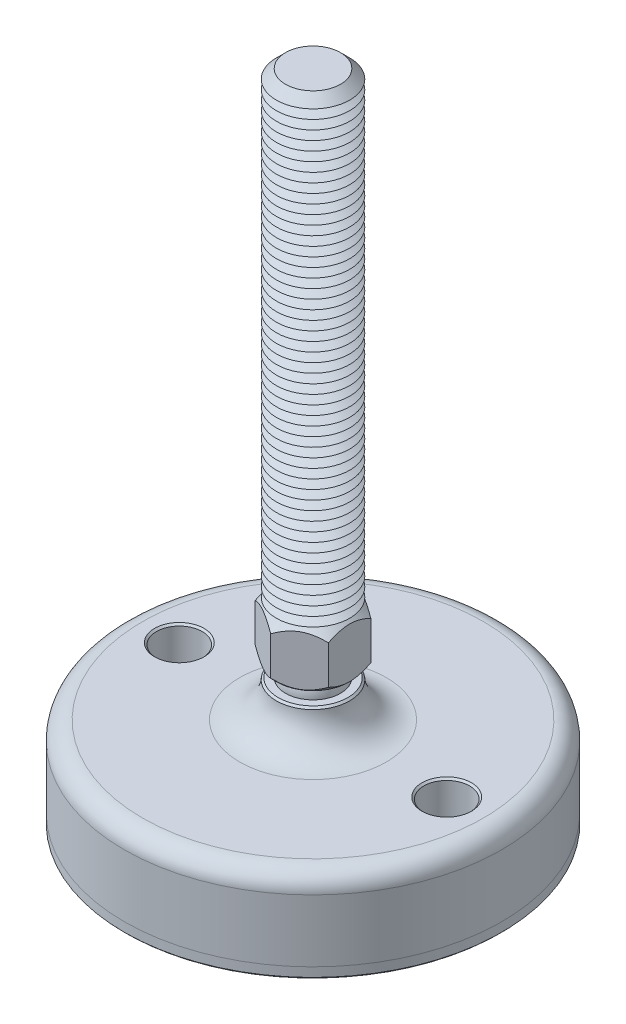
ISO-10303-21;
HEADER;
FILE_DESCRIPTION(('STEP AP214'),'2;1');
FILE_NAME('part.step','',(''),(''),'','','');
FILE_SCHEMA(('AUTOMOTIVE_DESIGN { 1 0 10303 214 1 1 1 1 }'));
ENDSEC;
DATA;
#1=APPLICATION_CONTEXT('core data for automotive mechanical design processes');
#2=APPLICATION_PROTOCOL_DEFINITION('international standard','automotive_design',2000,#1);
#3=PRODUCT_CONTEXT('',#1,'mechanical');
#4=PRODUCT('Part','Part','',(#3));
#5=PRODUCT_RELATED_PRODUCT_CATEGORY('part','',(#4));
#6=PRODUCT_DEFINITION_FORMATION('','',#4);
#7=PRODUCT_DEFINITION_CONTEXT('part definition',#1,'design');
#8=PRODUCT_DEFINITION('design','',#6,#7);
#9=PRODUCT_DEFINITION_SHAPE('','',#8);
#10=(LENGTH_UNIT() NAMED_UNIT(*) SI_UNIT(.MILLI.,.METRE.));
#11=(NAMED_UNIT(*) PLANE_ANGLE_UNIT() SI_UNIT($,.RADIAN.));
#12=(NAMED_UNIT(*) SI_UNIT($,.STERADIAN.) SOLID_ANGLE_UNIT());
#13=UNCERTAINTY_MEASURE_WITH_UNIT(LENGTH_MEASURE(1.E-05),#10,'distance_accuracy_value','');
#14=(GEOMETRIC_REPRESENTATION_CONTEXT(3) GLOBAL_UNCERTAINTY_ASSIGNED_CONTEXT((#13)) GLOBAL_UNIT_ASSIGNED_CONTEXT((#10,
#11,#12)) REPRESENTATION_CONTEXT('',''));
#15=CARTESIAN_POINT('',(0.,0.,0.));
#16=DIRECTION('',(0.,0.,1.));
#17=DIRECTION('',(1.,0.,0.));
#18=AXIS2_PLACEMENT_3D('',#15,#16,#17);
#19=CARTESIAN_POINT('',(0.,-32.,0.));
#20=DIRECTION('',(0.,1.,0.));
#21=DIRECTION('',(0.,0.,1.));
#22=AXIS2_PLACEMENT_3D('',#19,#20,#21);
#23=PLANE('',#22);
#24=CARTESIAN_POINT('',(-36.5,-32.,0.));
#25=DIRECTION('',(0.,1.,0.));
#26=DIRECTION('',(0.,0.,1.));
#27=AXIS2_PLACEMENT_3D('',#24,#25,#26);
#28=CIRCLE('',#27,6.25);
#29=CARTESIAN_POINT('',(-36.5,-32.,6.25));
#30=VERTEX_POINT('',#29);
#31=EDGE_CURVE('P0_E43',#30,#30,#28,.T.);
#32=ORIENTED_EDGE('',*,*,#31,.F.);
#33=EDGE_LOOP('',(#32));
#34=FACE_BOUND('',#33,.T.);
#35=CARTESIAN_POINT('',(36.5,-32.,0.));
#36=DIRECTION('',(0.,1.,0.));
#37=DIRECTION('',(0.,0.,1.));
#38=AXIS2_PLACEMENT_3D('',#35,#36,#37);
#39=CIRCLE('',#38,6.25);
#40=CARTESIAN_POINT('',(36.5,-32.,6.25));
#41=VERTEX_POINT('',#40);
#42=EDGE_CURVE('P0_E44',#41,#41,#39,.T.);
#43=ORIENTED_EDGE('',*,*,#42,.F.);
#44=EDGE_LOOP('',(#43));
#45=FACE_BOUND('',#44,.T.);
#46=CARTESIAN_POINT('',(0.,-32.,0.));
#47=DIRECTION('',(0.,1.,0.));
#48=DIRECTION('',(0.,0.,1.));
#49=AXIS2_PLACEMENT_3D('',#46,#47,#48);
#50=CIRCLE('',#49,51.5);
#51=CARTESIAN_POINT('',(0.,-32.,51.5));
#52=VERTEX_POINT('',#51);
#53=EDGE_CURVE('P0_E40',#52,#52,#50,.T.);
#54=ORIENTED_EDGE('',*,*,#53,.T.);
#55=EDGE_LOOP('',(#54));
#56=FACE_BOUND('',#55,.T.);
#57=ADVANCED_FACE('P0_F14',(#34,#45,#56),#23,.T.);
#58=CARTESIAN_POINT('',(0.,43.1654938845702,0.));
#59=DIRECTION('',(0.,1.,0.));
#60=DIRECTION('',(0.,0.,1.));
#61=AXIS2_PLACEMENT_3D('',#58,#59,#60);
#62=CYLINDRICAL_SURFACE('',#61,51.5);
#63=CARTESIAN_POINT('',(0.,-34.5,0.));
#64=DIRECTION('',(0.,-1.,0.));
#65=DIRECTION('',(0.,0.,-1.));
#66=AXIS2_PLACEMENT_3D('',#63,#64,#65);
#67=CIRCLE('',#66,51.5);
#68=CARTESIAN_POINT('',(0.,-34.5,-51.5));
#69=VERTEX_POINT('',#68);
#70=EDGE_CURVE('P0_E37',#69,#69,#67,.F.);
#71=ORIENTED_EDGE('',*,*,#70,.T.);
#72=EDGE_LOOP('',(#71));
#73=FACE_BOUND('',#72,.T.);
#74=ORIENTED_EDGE('',*,*,#53,.F.);
#75=EDGE_LOOP('',(#74));
#76=FACE_BOUND('',#75,.T.);
#77=ADVANCED_FACE('P0_F54',(#73,#76),#62,.T.);
#78=CARTESIAN_POINT('',(0.,-35.,51.5));
#79=DIRECTION('',(0.,-1.,0.));
#80=DIRECTION('',(0.,0.,-1.));
#81=AXIS2_PLACEMENT_3D('',#78,#79,#80);
#82=PLANE('',#81);
#83=CARTESIAN_POINT('',(36.5,-35.,0.));
#84=DIRECTION('',(0.,-1.,0.));
#85=DIRECTION('',(0.,0.,-1.));
#86=AXIS2_PLACEMENT_3D('',#83,#84,#85);
#87=CIRCLE('',#86,6.75000000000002);
#88=CARTESIAN_POINT('',(36.5,-35.,-6.75000000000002));
#89=VERTEX_POINT('',#88);
#90=EDGE_CURVE('P0_E25',#89,#89,#87,.F.);
#91=ORIENTED_EDGE('',*,*,#90,.T.);
#92=EDGE_LOOP('',(#91));
#93=FACE_BOUND('',#92,.T.);
#94=CARTESIAN_POINT('',(-36.5,-35.,0.));
#95=DIRECTION('',(0.,-1.,0.));
#96=DIRECTION('',(0.,0.,-1.));
#97=AXIS2_PLACEMENT_3D('',#94,#95,#96);
#98=CIRCLE('',#97,6.74999999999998);
#99=CARTESIAN_POINT('',(-36.5,-35.,-6.74999999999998));
#100=VERTEX_POINT('',#99);
#101=EDGE_CURVE('P0_E29',#100,#100,#98,.F.);
#102=ORIENTED_EDGE('',*,*,#101,.T.);
#103=EDGE_LOOP('',(#102));
#104=FACE_BOUND('',#103,.T.);
#105=CARTESIAN_POINT('',(0.,-35.,0.));
#106=DIRECTION('',(0.,-1.,0.));
#107=DIRECTION('',(0.,0.,-1.));
#108=AXIS2_PLACEMENT_3D('',#105,#106,#107);
#109=CIRCLE('',#108,51.);
#110=CARTESIAN_POINT('',(0.,-35.,-51.));
#111=VERTEX_POINT('',#110);
#112=EDGE_CURVE('P0_E34',#111,#111,#109,.T.);
#113=ORIENTED_EDGE('',*,*,#112,.T.);
#114=EDGE_LOOP('',(#113));
#115=FACE_BOUND('',#114,.T.);
#116=ADVANCED_FACE('P0_F61',(#93,#104,#115),#82,.T.);
#117=CARTESIAN_POINT('',(0.,-34.5,0.));
#118=DIRECTION('',(0.,1.,0.));
#119=DIRECTION('',(0.,0.,1.));
#120=AXIS2_PLACEMENT_3D('',#117,#118,#119);
#121=CONICAL_SURFACE('',#120,51.5,0.785398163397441);
#122=ORIENTED_EDGE('',*,*,#112,.F.);
#123=EDGE_LOOP('',(#122));
#124=FACE_BOUND('',#123,.T.);
#125=ORIENTED_EDGE('',*,*,#70,.F.);
#126=EDGE_LOOP('',(#125));
#127=FACE_BOUND('',#126,.T.);
#128=ADVANCED_FACE('P0_F68',(#124,#127),#121,.T.);
#129=CARTESIAN_POINT('',(36.5,-35.,0.));
#130=DIRECTION('',(0.,1.,0.));
#131=DIRECTION('',(0.,0.,1.));
#132=AXIS2_PLACEMENT_3D('',#129,#130,#131);
#133=CYLINDRICAL_SURFACE('',#132,6.25);
#134=CARTESIAN_POINT('',(36.5,-34.5,0.));
#135=DIRECTION('',(0.,-1.,0.));
#136=DIRECTION('',(0.,0.,-1.));
#137=AXIS2_PLACEMENT_3D('',#134,#135,#136);
#138=CIRCLE('',#137,6.25);
#139=CARTESIAN_POINT('',(36.5,-34.5,-6.25));
#140=VERTEX_POINT('',#139);
#141=EDGE_CURVE('P0_E21',#140,#140,#138,.T.);
#142=ORIENTED_EDGE('',*,*,#141,.T.);
#143=EDGE_LOOP('',(#142));
#144=FACE_BOUND('',#143,.T.);
#145=ORIENTED_EDGE('',*,*,#42,.T.);
#146=EDGE_LOOP('',(#145));
#147=FACE_BOUND('',#146,.T.);
#148=ADVANCED_FACE('P0_F74',(#144,#147),#133,.F.);
#149=CARTESIAN_POINT('',(-36.5,-35.,0.));
#150=DIRECTION('',(0.,1.,0.));
#151=DIRECTION('',(0.,0.,1.));
#152=AXIS2_PLACEMENT_3D('',#149,#150,#151);
#153=CYLINDRICAL_SURFACE('',#152,6.25);
#154=CARTESIAN_POINT('',(-36.5,-34.5,0.));
#155=DIRECTION('',(0.,-1.,0.));
#156=DIRECTION('',(0.,0.,-1.));
#157=AXIS2_PLACEMENT_3D('',#154,#155,#156);
#158=CIRCLE('',#157,6.25);
#159=CARTESIAN_POINT('',(-36.5,-34.5,-6.25));
#160=VERTEX_POINT('',#159);
#161=EDGE_CURVE('P0_E10',#160,#160,#158,.T.);
#162=ORIENTED_EDGE('',*,*,#161,.T.);
#163=EDGE_LOOP('',(#162));
#164=FACE_BOUND('',#163,.T.);
#165=ORIENTED_EDGE('',*,*,#31,.T.);
#166=EDGE_LOOP('',(#165));
#167=FACE_BOUND('',#166,.T.);
#168=ADVANCED_FACE('P0_F50',(#164,#167),#153,.F.);
#169=CARTESIAN_POINT('',(36.5,-35.,0.));
#170=DIRECTION('',(0.,-1.,0.));
#171=DIRECTION('',(0.,0.,-1.));
#172=AXIS2_PLACEMENT_3D('',#169,#170,#171);
#173=CONICAL_SURFACE('',#172,6.75000000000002,0.785398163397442);
#174=ORIENTED_EDGE('',*,*,#141,.F.);
#175=EDGE_LOOP('',(#174));
#176=FACE_BOUND('',#175,.T.);
#177=ORIENTED_EDGE('',*,*,#90,.F.);
#178=EDGE_LOOP('',(#177));
#179=FACE_BOUND('',#178,.T.);
#180=ADVANCED_FACE('P0_F76',(#176,#179),#173,.F.);
#181=CARTESIAN_POINT('',(-36.5,-35.,0.));
#182=DIRECTION('',(0.,-1.,0.));
#183=DIRECTION('',(0.,0.,-1.));
#184=AXIS2_PLACEMENT_3D('',#181,#182,#183);
#185=CONICAL_SURFACE('',#184,6.74999999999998,0.785398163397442);
#186=ORIENTED_EDGE('',*,*,#161,.F.);
#187=EDGE_LOOP('',(#186));
#188=FACE_BOUND('',#187,.T.);
#189=ORIENTED_EDGE('',*,*,#101,.F.);
#190=EDGE_LOOP('',(#189));
#191=FACE_BOUND('',#190,.T.);
#192=ADVANCED_FACE('P0_F16',(#188,#191),#185,.F.);
#193=CLOSED_SHELL('',(#57,#77,#116,#128,#148,#168,#180,#192));
#194=MANIFOLD_SOLID_BREP('P0_B1',#193);
#195=CARTESIAN_POINT('',(0.,3.75,0.));
#196=DIRECTION('',(0.,1.,0.));
#197=DIRECTION('',(0.,0.,1.));
#198=AXIS2_PLACEMENT_3D('',#195,#196,#197);
#199=PLANE('',#198);
#200=CARTESIAN_POINT('',(0.,3.75,0.));
#201=DIRECTION('',(0.,1.,0.));
#202=DIRECTION('',(0.,0.,1.));
#203=AXIS2_PLACEMENT_3D('',#200,#201,#202);
#204=CIRCLE('',#203,9.72829454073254);
#205=CARTESIAN_POINT('',(0.,3.75,9.72829454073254));
#206=VERTEX_POINT('',#205);
#207=EDGE_CURVE('P1_E211',#206,#206,#204,.T.);
#208=ORIENTED_EDGE('',*,*,#207,.F.);
#209=EDGE_LOOP('',(#208));
#210=FACE_BOUND('',#209,.T.);
#211=CARTESIAN_POINT('',(0.,3.75,0.));
#212=DIRECTION('',(0.,1.,0.));
#213=DIRECTION('',(0.,0.,1.));
#214=AXIS2_PLACEMENT_3D('',#211,#212,#213);
#215=CIRCLE('',#214,6.49519052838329);
#216=CARTESIAN_POINT('',(0.,3.75,6.49519052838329));
#217=VERTEX_POINT('',#216);
#218=EDGE_CURVE('P1_E24',#217,#217,#215,.F.);
#219=ORIENTED_EDGE('',*,*,#218,.F.);
#220=EDGE_LOOP('',(#219));
#221=FACE_BOUND('',#220,.T.);
#222=ADVANCED_FACE('P1_F16',(#210,#221),#199,.F.);
#223=CARTESIAN_POINT('',(0.,0.,0.));
#224=DIRECTION('',(0.,1.,0.));
#225=DIRECTION('',(0.,0.,-1.));
#226=AXIS2_PLACEMENT_3D('',#223,#224,#225);
#227=SPHERICAL_SURFACE('',#226,7.5);
#228=ORIENTED_EDGE('',*,*,#218,.T.);
#229=EDGE_LOOP('',(#228));
#230=FACE_BOUND('',#229,.T.);
#231=ADVANCED_FACE('P1_F201',(#230),#227,.T.);
#232=CARTESIAN_POINT('',(0.,3.75,0.));
#233=DIRECTION('',(0.,1.,0.));
#234=DIRECTION('',(0.,0.,1.));
#235=AXIS2_PLACEMENT_3D('',#232,#233,#234);
#236=CONICAL_SURFACE('',#235,9.72829454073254,0.785398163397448);
#237=ORIENTED_EDGE('',*,*,#207,.T.);
#238=EDGE_LOOP('',(#237));
#239=FACE_BOUND('',#238,.T.);
#240=CARTESIAN_POINT('',(-10.,9.59571642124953,-11.9394228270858));
#241=CARTESIAN_POINT('',(-10.,9.37430561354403,-11.6505452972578));
#242=CARTESIAN_POINT('',(-10.,9.15490936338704,-11.3600988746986));
#243=CARTESIAN_POINT('',(-10.,8.72106267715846,-10.7754314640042));
#244=CARTESIAN_POINT('',(-10.,8.50661343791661,-10.4812095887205));
#245=CARTESIAN_POINT('',(-10.,8.08205114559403,-9.88620330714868));
#246=CARTESIAN_POINT('',(-10.,7.87198437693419,-9.58538576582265));
#247=CARTESIAN_POINT('',(-10.,7.45926520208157,-8.97872312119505));
#248=CARTESIAN_POINT('',(-10.,7.25661228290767,-8.67287836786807));
#249=CARTESIAN_POINT('',(-10.,6.84809543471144,-8.03614350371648));
#250=CARTESIAN_POINT('',(-10.,6.64281401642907,-7.70487777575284));
#251=CARTESIAN_POINT('',(-10.,6.245142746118,-7.03457466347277));
#252=CARTESIAN_POINT('',(-10.,6.0527550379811,-6.69553599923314));
#253=CARTESIAN_POINT('',(-10.,5.68497951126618,-6.00961937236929));
#254=CARTESIAN_POINT('',(-10.,5.50954176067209,-5.66276839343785));
#255=CARTESIAN_POINT('',(-10.,5.17959635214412,-4.95932933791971));
#256=CARTESIAN_POINT('',(-10.,5.02507889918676,-4.60274591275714));
#257=CARTESIAN_POINT('',(-10.,4.75599518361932,-3.91353381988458));
#258=CARTESIAN_POINT('',(-10.,4.63902686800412,-3.58185263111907));
#259=CARTESIAN_POINT('',(-10.,4.43164927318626,-2.91013341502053));
#260=CARTESIAN_POINT('',(-10.,4.34124171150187,-2.57009484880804));
#261=CARTESIAN_POINT('',(-10.,4.19334931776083,-1.88955843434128));
#262=CARTESIAN_POINT('',(-10.,4.13527351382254,-1.54919119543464));
#263=CARTESIAN_POINT('',(-10.,4.05324021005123,-0.864347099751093));
#264=CARTESIAN_POINT('',(-10.,4.029275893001,-0.519871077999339));
#265=CARTESIAN_POINT('',(-10.,4.01745435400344,0.155191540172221));
#266=CARTESIAN_POINT('',(-10.,4.02812008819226,0.485752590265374));
#267=CARTESIAN_POINT('',(-10.,4.08160326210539,1.1442457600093));
#268=CARTESIAN_POINT('',(-10.,4.12442366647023,1.47217763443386));
#269=CARTESIAN_POINT('',(-10.,4.24054019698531,2.12859326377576));
#270=CARTESIAN_POINT('',(-10.,4.31437036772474,2.45698095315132));
#271=CARTESIAN_POINT('',(-10.,4.48844287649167,3.10654175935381));
#272=CARTESIAN_POINT('',(-10.,4.58868356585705,3.42771532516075));
#273=CARTESIAN_POINT('',(-10.,4.81839210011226,4.08271396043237));
#274=CARTESIAN_POINT('',(-10.,4.94932842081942,4.41601827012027));
#275=CARTESIAN_POINT('',(-10.,5.23140828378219,5.07403931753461));
#276=CARTESIAN_POINT('',(-10.,5.38256099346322,5.3987520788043));
#277=CARTESIAN_POINT('',(-10.,5.70148727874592,6.04113299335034));
#278=CARTESIAN_POINT('',(-10.,5.86931223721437,6.35877542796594));
#279=CARTESIAN_POINT('',(-10.,6.21788686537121,6.98677627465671));
#280=CARTESIAN_POINT('',(-10.,6.39863453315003,7.29713580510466));
#281=CARTESIAN_POINT('',(-10.,6.76133545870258,7.89633938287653));
#282=CARTESIAN_POINT('',(-10.,6.94278731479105,8.18548854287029));
#283=CARTESIAN_POINT('',(-10.,7.31339871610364,8.75881961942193));
#284=CARTESIAN_POINT('',(-10.,7.50255884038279,9.04300116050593));
#285=CARTESIAN_POINT('',(-10.,7.8856676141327,9.6047584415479));
#286=CARTESIAN_POINT('',(-10.,8.07956548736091,9.88236893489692));
#287=CARTESIAN_POINT('',(-10.,8.47254700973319,10.4337838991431));
#288=CARTESIAN_POINT('',(-10.,8.67162921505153,10.7075893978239));
#289=CARTESIAN_POINT('',(-10.,8.87283307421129,10.9797992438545));
#290=B_SPLINE_CURVE_WITH_KNOTS('',3,(#240,#241,#242,#243,#244,#245,#246,#247,#248,#249,#250,
#251,#252,#253,#254,#255,#256,#257,#258,#259,#260,#261,#262,#263,#264,#265,#266,#267,#268,#269,
#270,#271,#272,#273,#274,#275,#276,#277,#278,#279,#280,#281,#282,#283,#284,#285,#286,#287,#288,
#289),.UNSPECIFIED.,.F.,.F.,(4,2,2,2,2,2,2,2,2,2,2,2,2,2,2,2,2,2,2,2,2,2,2,2,4),(0.,
1.09192545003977,2.18411235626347,3.28473497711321,4.3852812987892,5.5541916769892,
6.72329593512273,7.88884387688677,9.05384420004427,10.1080362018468,11.1622963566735,
12.1965943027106,13.2306855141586,14.2212593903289,15.2119246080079,16.2203997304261,
17.2288119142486,18.3022883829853,19.3762532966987,20.4536373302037,21.5308548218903,
22.5548150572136,23.5788523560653,24.5946500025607,25.6101677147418),.UNSPECIFIED.);
#291=CARTESIAN_POINT('',(-10.,5.56871084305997,-5.77350269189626));
#292=VERTEX_POINT('',#291);
#293=CARTESIAN_POINT('',(-10.,5.56871084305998,5.77350269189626));
#294=VERTEX_POINT('',#293);
#295=EDGE_CURVE('P1_E185',#292,#294,#290,.T.);
#296=ORIENTED_EDGE('',*,*,#295,.F.);
#297=CARTESIAN_POINT('',(0.000199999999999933,5.56882631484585,-11.5471208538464));
#298=CARTESIAN_POINT('',(-0.171722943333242,5.4695807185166,-11.447861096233));
#299=CARTESIAN_POINT('',(-0.344992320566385,5.37336355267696,-11.3478239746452));
#300=CARTESIAN_POINT('',(-0.694433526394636,5.18794806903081,-11.1460740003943));
#301=CARTESIAN_POINT('',(-0.870606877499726,5.09875358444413,-11.0443602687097));
#302=CARTESIAN_POINT('',(-1.22689656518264,4.92796770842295,-10.8386563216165));
#303=CARTESIAN_POINT('',(-1.40702970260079,4.84642277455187,-10.7346564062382));
#304=CARTESIAN_POINT('',(-1.77025459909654,4.69270708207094,-10.52494841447));
#305=CARTESIAN_POINT('',(-1.95334590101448,4.62053489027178,-10.4192406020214));
#306=CARTESIAN_POINT('',(-2.31954331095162,4.4878482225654,-10.2078164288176));
#307=CARTESIAN_POINT('',(-2.50260441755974,4.42716910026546,-10.1021260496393));
#308=CARTESIAN_POINT('',(-2.87129282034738,4.31731511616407,-9.88926370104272));
#309=CARTESIAN_POINT('',(-3.05691983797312,4.26813901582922,-9.78209189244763));
#310=CARTESIAN_POINT('',(-3.42994608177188,4.1825291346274,-9.56672509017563));
#311=CARTESIAN_POINT('',(-3.61734032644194,4.14606667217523,-9.45853297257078));
#312=CARTESIAN_POINT('',(-3.99370204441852,4.08668528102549,-9.24124043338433));
#313=CARTESIAN_POINT('',(-4.1826692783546,4.06376432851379,-9.13214015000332));
#314=CARTESIAN_POINT('',(-4.64316633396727,4.0253323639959,-8.86627205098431));
#315=CARTESIAN_POINT('',(-4.91519388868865,4.01726744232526,-8.70921686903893));
#316=CARTESIAN_POINT('',(-5.45875701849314,4.03080424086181,-8.39539054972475));
#317=CARTESIAN_POINT('',(-5.7302923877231,4.05241636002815,-8.23861953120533));
#318=CARTESIAN_POINT('',(-6.27080349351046,4.12403157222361,-7.92655529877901));
#319=CARTESIAN_POINT('',(-6.53977602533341,4.17406641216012,-7.77126393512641));
#320=CARTESIAN_POINT('',(-7.07309796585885,4.29980733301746,-7.46335036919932));
#321=CARTESIAN_POINT('',(-7.33744772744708,4.3755114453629,-7.31072796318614));
#322=CARTESIAN_POINT('',(-7.80670351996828,4.53125365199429,-7.03980300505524));
#323=CARTESIAN_POINT('',(-8.01264886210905,4.60719488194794,-6.92090040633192));
#324=CARTESIAN_POINT('',(-8.42084280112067,4.77131434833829,-6.68522952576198));
#325=CARTESIAN_POINT('',(-8.62309128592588,4.85949295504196,-6.5684613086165));
#326=CARTESIAN_POINT('',(-9.02325448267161,5.04611070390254,-6.33742697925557));
#327=CARTESIAN_POINT('',(-9.22118057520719,5.1445175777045,-6.2231542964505));
#328=CARTESIAN_POINT('',(-9.61336795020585,5.35030005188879,-5.99672480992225));
#329=CARTESIAN_POINT('',(-9.80763139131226,5.45767015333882,-5.88456675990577));
#330=CARTESIAN_POINT('',(-10.0002,5.56882631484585,-5.77338722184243));
#331=B_SPLINE_CURVE_WITH_KNOTS('',3,(#297,#298,#299,#300,#301,#302,#303,#304,#305,#306,#307,
#308,#309,#310,#311,#312,#313,#314,#315,#316,#317,#318,#319,#320,#321,#322,#323,#324,#325,#326,
#327,#328,#329,#330),.UNSPECIFIED.,.F.,.F.,(4,2,2,2,2,2,2,2,2,2,2,2,2,2,2,2,4),(0.,
0.665863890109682,1.33208874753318,2.00212824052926,2.67206515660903,3.33152613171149,
3.99091606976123,4.64880867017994,5.30660292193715,6.24777541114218,7.18927777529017,
8.13183382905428,9.07431761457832,9.82287578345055,10.5714566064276,11.3177436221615,
12.0635761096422),.UNSPECIFIED.);
#332=CARTESIAN_POINT('',(0.,5.56871084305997,-11.5470053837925));
#333=VERTEX_POINT('',#332);
#334=EDGE_CURVE('P1_E179',#333,#292,#331,.T.);
#335=ORIENTED_EDGE('',*,*,#334,.F.);
#336=CARTESIAN_POINT('',(10.0002,5.56882631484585,-5.77338722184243));
#337=CARTESIAN_POINT('',(9.82827705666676,5.4695807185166,-5.87264697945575));
#338=CARTESIAN_POINT('',(9.65500767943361,5.37336355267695,-5.97268410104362));
#339=CARTESIAN_POINT('',(9.30556647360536,5.18794806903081,-6.17443407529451));
#340=CARTESIAN_POINT('',(9.12939312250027,5.09875358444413,-6.27614780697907));
#341=CARTESIAN_POINT('',(8.77310343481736,4.92796770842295,-6.48185175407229));
#342=CARTESIAN_POINT('',(8.59297029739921,4.84642277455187,-6.58585166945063));
#343=CARTESIAN_POINT('',(8.22974540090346,4.69270708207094,-6.79555966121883));
#344=CARTESIAN_POINT('',(8.04665409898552,4.62053489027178,-6.90126747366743));
#345=CARTESIAN_POINT('',(7.68045668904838,4.4878482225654,-7.11269164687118));
#346=CARTESIAN_POINT('',(7.49739558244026,4.42716910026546,-7.21838202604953));
#347=CARTESIAN_POINT('',(7.12870717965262,4.31731511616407,-7.43124437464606));
#348=CARTESIAN_POINT('',(6.94308016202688,4.26813901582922,-7.53841618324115));
#349=CARTESIAN_POINT('',(6.57005391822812,4.1825291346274,-7.75378298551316));
#350=CARTESIAN_POINT('',(6.38265967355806,4.14606667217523,-7.861975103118));
#351=CARTESIAN_POINT('',(6.00629795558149,4.08668528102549,-8.07926764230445));
#352=CARTESIAN_POINT('',(5.81733072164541,4.06376432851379,-8.18836792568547));
#353=CARTESIAN_POINT('',(5.35683366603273,4.0253323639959,-8.45423602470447));
#354=CARTESIAN_POINT('',(5.08480611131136,4.01726744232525,-8.61129120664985));
#355=CARTESIAN_POINT('',(4.54124298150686,4.03080424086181,-8.92511752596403));
#356=CARTESIAN_POINT('',(4.2697076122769,4.05241636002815,-9.08188854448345));
#357=CARTESIAN_POINT('',(3.72919650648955,4.12403157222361,-9.39395277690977));
#358=CARTESIAN_POINT('',(3.46022397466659,4.17406641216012,-9.54924414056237));
#359=CARTESIAN_POINT('',(2.92690203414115,4.29980733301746,-9.85715770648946));
#360=CARTESIAN_POINT('',(2.66255227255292,4.37551144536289,-10.0097801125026));
#361=CARTESIAN_POINT('',(2.19329648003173,4.53125365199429,-10.2807050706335));
#362=CARTESIAN_POINT('',(1.98735113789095,4.60719488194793,-10.3996076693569));
#363=CARTESIAN_POINT('',(1.57915719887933,4.77131434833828,-10.6352785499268));
#364=CARTESIAN_POINT('',(1.37690871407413,4.85949295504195,-10.7520467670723));
#365=CARTESIAN_POINT('',(0.976745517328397,5.04611070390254,-10.9830810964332));
#366=CARTESIAN_POINT('',(0.77881942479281,5.1445175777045,-11.0973537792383));
#367=CARTESIAN_POINT('',(0.386632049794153,5.35030005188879,-11.3237832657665));
#368=CARTESIAN_POINT('',(0.192368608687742,5.45767015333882,-11.435941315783));
#369=CARTESIAN_POINT('',(-0.000199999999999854,5.56882631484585,-11.5471208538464));
#370=B_SPLINE_CURVE_WITH_KNOTS('',3,(#336,#337,#338,#339,#340,#341,#342,#343,#344,#345,#346,
#347,#348,#349,#350,#351,#352,#353,#354,#355,#356,#357,#358,#359,#360,#361,#362,#363,#364,#365,
#366,#367,#368,#369),.UNSPECIFIED.,.F.,.F.,(4,2,2,2,2,2,2,2,2,2,2,2,2,2,2,2,4),(0.,
0.665863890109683,1.33208874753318,2.00212824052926,2.67206515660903,3.33152613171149,
3.99091606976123,4.64880867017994,5.30660292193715,6.24777541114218,7.18927777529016,
8.13183382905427,9.07431761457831,9.82287578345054,10.5714566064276,11.3177436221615,
12.0635761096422),.UNSPECIFIED.);
#371=CARTESIAN_POINT('',(9.99999999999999,5.56871084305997,-5.77350269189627));
#372=VERTEX_POINT('',#371);
#373=EDGE_CURVE('P1_E167',#372,#333,#370,.T.);
#374=ORIENTED_EDGE('',*,*,#373,.F.);
#375=CARTESIAN_POINT('',(10.,9.59571642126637,-11.9394228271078));
#376=CARTESIAN_POINT('',(10.,9.37430561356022,-11.6505452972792));
#377=CARTESIAN_POINT('',(10.,9.15490936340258,-11.3600988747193));
#378=CARTESIAN_POINT('',(10.,8.7210626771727,-10.7754314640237));
#379=CARTESIAN_POINT('',(10.,8.5066134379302,-10.4812095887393));
#380=CARTESIAN_POINT('',(10.,8.08205114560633,-9.88620330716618));
#381=CARTESIAN_POINT('',(10.,7.87198437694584,-9.58538576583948));
#382=CARTESIAN_POINT('',(10.,7.45926520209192,-8.97872312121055));
#383=CARTESIAN_POINT('',(10.,7.25661228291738,-8.67287836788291));
#384=CARTESIAN_POINT('',(10.,6.84809543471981,-8.03614350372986));
#385=CARTESIAN_POINT('',(10.,6.64281401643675,-7.70487777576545));
#386=CARTESIAN_POINT('',(10.,6.24514274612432,-7.03457466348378));
#387=CARTESIAN_POINT('',(10.,6.05275503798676,-6.69553599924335));
#388=CARTESIAN_POINT('',(10.,5.68497951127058,-6.00961937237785));
#389=CARTESIAN_POINT('',(10.,5.50954176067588,-5.66276839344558));
#390=CARTESIAN_POINT('',(10.,5.17959635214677,-4.95932933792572));
#391=CARTESIAN_POINT('',(10.,5.02507889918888,-4.60274591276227));
#392=CARTESIAN_POINT('',(10.,4.75599518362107,-3.91353381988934));
#393=CARTESIAN_POINT('',(10.,4.63902686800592,-3.58185263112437));
#394=CARTESIAN_POINT('',(10.,4.43164927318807,-2.91013341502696));
#395=CARTESIAN_POINT('',(10.,4.34124171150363,-2.57009484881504));
#396=CARTESIAN_POINT('',(10.,4.19334931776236,-1.8895584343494));
#397=CARTESIAN_POINT('',(10.,4.13527351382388,-1.54919119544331));
#398=CARTESIAN_POINT('',(10.,4.05324021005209,-0.86434709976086));
#399=CARTESIAN_POINT('',(10.,4.02927589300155,-0.519871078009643));
#400=CARTESIAN_POINT('',(10.,4.01745435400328,0.155191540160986));
#401=CARTESIAN_POINT('',(10.,4.0281200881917,0.485752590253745));
#402=CARTESIAN_POINT('',(10.,4.08160326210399,1.14424575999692));
#403=CARTESIAN_POINT('',(10.,4.12442366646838,1.47217763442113));
#404=CARTESIAN_POINT('',(10.,4.24054019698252,2.12859326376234));
#405=CARTESIAN_POINT('',(10.,4.31437036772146,2.45698095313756));
#406=CARTESIAN_POINT('',(10.,4.48844287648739,3.1065417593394));
#407=CARTESIAN_POINT('',(10.,4.58868356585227,3.42771532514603));
#408=CARTESIAN_POINT('',(10.,4.81839210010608,4.08271396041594));
#409=CARTESIAN_POINT('',(10.,4.94932842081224,4.41601827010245));
#410=CARTESIAN_POINT('',(10.,5.23140828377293,5.0740393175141));
#411=CARTESIAN_POINT('',(10.,5.38256099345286,5.39875207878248));
#412=CARTESIAN_POINT('',(10.,5.70148727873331,6.04113299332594));
#413=CARTESIAN_POINT('',(10.,5.86931223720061,6.35877542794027));
#414=CARTESIAN_POINT('',(10.,6.21788686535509,6.98677627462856));
#415=CARTESIAN_POINT('',(10.,6.39863453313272,7.29713580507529));
#416=CARTESIAN_POINT('',(10.,6.761335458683,7.89633938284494));
#417=CARTESIAN_POINT('',(10.,6.9427873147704,8.18548854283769));
#418=CARTESIAN_POINT('',(10.,7.31339871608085,8.75881961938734));
#419=CARTESIAN_POINT('',(10.,7.50255884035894,9.04300116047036));
#420=CARTESIAN_POINT('',(10.,7.88566761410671,9.60475844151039));
#421=CARTESIAN_POINT('',(10.,8.07956548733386,9.88236893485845));
#422=CARTESIAN_POINT('',(10.,8.47254700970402,10.4337838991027));
#423=CARTESIAN_POINT('',(10.,8.6716292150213,10.7075893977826));
#424=CARTESIAN_POINT('',(10.,8.87283307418,10.9797992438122));
#425=B_SPLINE_CURVE_WITH_KNOTS('',3,(#375,#376,#377,#378,#379,#380,#381,#382,#383,#384,#385,
#386,#387,#388,#389,#390,#391,#392,#393,#394,#395,#396,#397,#398,#399,#400,#401,#402,#403,#404,
#405,#406,#407,#408,#409,#410,#411,#412,#413,#414,#415,#416,#417,#418,#419,#420,#421,#422,#423,
#424),.UNSPECIFIED.,.F.,.F.,(4,2,2,2,2,2,2,2,2,2,2,2,2,2,2,2,2,2,2,2,2,2,2,2,4),(0.,
1.09192545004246,2.18411235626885,3.28473497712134,4.38528129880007,5.55419167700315,
6.72329593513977,7.88884387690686,9.05384420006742,10.1080362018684,11.1622963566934,
12.196594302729,13.2306855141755,14.2212593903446,15.2119246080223,16.2203997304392,
17.2288119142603,18.3022883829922,19.3762532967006,20.4536373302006,21.5308548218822,
22.5548150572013,23.5788523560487,24.5946500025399,25.6101677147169),.UNSPECIFIED.);
#426=CARTESIAN_POINT('',(10.,5.56871084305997,5.77350269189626));
#427=VERTEX_POINT('',#426);
#428=EDGE_CURVE('P1_E70',#427,#372,#425,.F.);
#429=ORIENTED_EDGE('',*,*,#428,.F.);
#430=CARTESIAN_POINT('',(-0.000200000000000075,5.56882631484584,11.5471208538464));
#431=CARTESIAN_POINT('',(0.171722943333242,5.4695807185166,11.447861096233));
#432=CARTESIAN_POINT('',(0.344992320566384,5.37336355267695,11.3478239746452));
#433=CARTESIAN_POINT('',(0.694433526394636,5.18794806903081,11.1460740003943));
#434=CARTESIAN_POINT('',(0.870606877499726,5.09875358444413,11.0443602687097));
#435=CARTESIAN_POINT('',(1.22689656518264,4.92796770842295,10.8386563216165));
#436=CARTESIAN_POINT('',(1.40702970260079,4.84642277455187,10.7346564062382));
#437=CARTESIAN_POINT('',(1.77025459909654,4.69270708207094,10.52494841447));
#438=CARTESIAN_POINT('',(1.95334590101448,4.62053489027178,10.4192406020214));
#439=CARTESIAN_POINT('',(2.31954331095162,4.4878482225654,10.2078164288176));
#440=CARTESIAN_POINT('',(2.50260441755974,4.42716910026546,10.1021260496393));
#441=CARTESIAN_POINT('',(2.87129282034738,4.31731511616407,9.88926370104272));
#442=CARTESIAN_POINT('',(3.05691983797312,4.26813901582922,9.78209189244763));
#443=CARTESIAN_POINT('',(3.42994608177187,4.18252913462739,9.56672509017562));
#444=CARTESIAN_POINT('',(3.61734032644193,4.14606667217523,9.45853297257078));
#445=CARTESIAN_POINT('',(3.99370204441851,4.08668528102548,9.24124043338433));
#446=CARTESIAN_POINT('',(4.18266927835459,4.06376432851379,9.13214015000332));
#447=CARTESIAN_POINT('',(4.64316633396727,4.0253323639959,8.86627205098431));
#448=CARTESIAN_POINT('',(4.91519388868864,4.01726744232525,8.70921686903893));
#449=CARTESIAN_POINT('',(5.45875701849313,4.03080424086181,8.39539054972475));
#450=CARTESIAN_POINT('',(5.7302923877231,4.05241636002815,8.23861953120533));
#451=CARTESIAN_POINT('',(6.27080349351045,4.1240315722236,7.92655529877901));
#452=CARTESIAN_POINT('',(6.53977602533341,4.17406641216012,7.77126393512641));
#453=CARTESIAN_POINT('',(7.07309796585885,4.29980733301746,7.46335036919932));
#454=CARTESIAN_POINT('',(7.33744772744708,4.37551144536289,7.31072796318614));
#455=CARTESIAN_POINT('',(7.80670351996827,4.53125365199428,7.03980300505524));
#456=CARTESIAN_POINT('',(8.01264886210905,4.60719488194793,6.92090040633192));
#457=CARTESIAN_POINT('',(8.42084280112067,4.77131434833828,6.68522952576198));
#458=CARTESIAN_POINT('',(8.62309128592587,4.85949295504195,6.5684613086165));
#459=CARTESIAN_POINT('',(9.0232544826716,5.04611070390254,6.33742697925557));
#460=CARTESIAN_POINT('',(9.22118057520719,5.1445175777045,6.2231542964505));
#461=CARTESIAN_POINT('',(9.61336795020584,5.35030005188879,5.99672480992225));
#462=CARTESIAN_POINT('',(9.80763139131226,5.45767015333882,5.88456675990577));
#463=CARTESIAN_POINT('',(10.0002,5.56882631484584,5.77338722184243));
#464=B_SPLINE_CURVE_WITH_KNOTS('',3,(#430,#431,#432,#433,#434,#435,#436,#437,#438,#439,#440,
#441,#442,#443,#444,#445,#446,#447,#448,#449,#450,#451,#452,#453,#454,#455,#456,#457,#458,#459,
#460,#461,#462,#463),.UNSPECIFIED.,.F.,.F.,(4,2,2,2,2,2,2,2,2,2,2,2,2,2,2,2,4),(0.,
0.665863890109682,1.33208874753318,2.00212824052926,2.67206515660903,3.33152613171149,
3.99091606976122,4.64880867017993,5.30660292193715,6.24777541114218,7.18927777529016,
8.13183382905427,9.07431761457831,9.82287578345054,10.5714566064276,11.3177436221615,
12.0635761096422),.UNSPECIFIED.);
#465=CARTESIAN_POINT('',(0.,5.56871084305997,11.5470053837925));
#466=VERTEX_POINT('',#465);
#467=EDGE_CURVE('P1_E67',#466,#427,#464,.T.);
#468=ORIENTED_EDGE('',*,*,#467,.F.);
#469=CARTESIAN_POINT('',(-10.0002,5.56882631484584,5.77338722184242));
#470=CARTESIAN_POINT('',(-9.82827705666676,5.4695807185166,5.87264697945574));
#471=CARTESIAN_POINT('',(-9.65500767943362,5.37336355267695,5.97268410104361));
#472=CARTESIAN_POINT('',(-9.30556647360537,5.18794806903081,6.1744340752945));
#473=CARTESIAN_POINT('',(-9.12939312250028,5.09875358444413,6.27614780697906));
#474=CARTESIAN_POINT('',(-8.77310343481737,4.92796770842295,6.48185175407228));
#475=CARTESIAN_POINT('',(-8.59297029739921,4.84642277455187,6.58585166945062));
#476=CARTESIAN_POINT('',(-8.22974540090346,4.69270708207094,6.79555966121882));
#477=CARTESIAN_POINT('',(-8.04665409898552,4.62053489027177,6.90126747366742));
#478=CARTESIAN_POINT('',(-7.68045668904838,4.48784822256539,7.11269164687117));
#479=CARTESIAN_POINT('',(-7.49739558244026,4.42716910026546,7.21838202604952));
#480=CARTESIAN_POINT('',(-7.12870717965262,4.31731511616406,7.43124437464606));
#481=CARTESIAN_POINT('',(-6.94308016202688,4.26813901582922,7.53841618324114));
#482=CARTESIAN_POINT('',(-6.57005391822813,4.18252913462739,7.75378298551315));
#483=CARTESIAN_POINT('',(-6.38265967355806,4.14606667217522,7.861975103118));
#484=CARTESIAN_POINT('',(-6.00629795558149,4.08668528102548,8.07926764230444));
#485=CARTESIAN_POINT('',(-5.81733072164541,4.06376432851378,8.18836792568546));
#486=CARTESIAN_POINT('',(-5.35683366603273,4.0253323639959,8.45423602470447));
#487=CARTESIAN_POINT('',(-5.08480611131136,4.01726744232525,8.61129120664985));
#488=CARTESIAN_POINT('',(-4.54124298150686,4.0308042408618,8.92511752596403));
#489=CARTESIAN_POINT('',(-4.2697076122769,4.05241636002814,9.08188854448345));
#490=CARTESIAN_POINT('',(-3.72919650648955,4.1240315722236,9.39395277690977));
#491=CARTESIAN_POINT('',(-3.46022397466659,4.17406641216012,9.54924414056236));
#492=CARTESIAN_POINT('',(-2.92690203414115,4.29980733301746,9.85715770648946));
#493=CARTESIAN_POINT('',(-2.66255227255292,4.37551144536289,10.0097801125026));
#494=CARTESIAN_POINT('',(-2.19329648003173,4.53125365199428,10.2807050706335));
#495=CARTESIAN_POINT('',(-1.98735113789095,4.60719488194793,10.3996076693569));
#496=CARTESIAN_POINT('',(-1.57915719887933,4.77131434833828,10.6352785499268));
#497=CARTESIAN_POINT('',(-1.37690871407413,4.85949295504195,10.7520467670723));
#498=CARTESIAN_POINT('',(-0.976745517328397,5.04611070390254,10.9830810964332));
#499=CARTESIAN_POINT('',(-0.778819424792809,5.1445175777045,11.0973537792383));
#500=CARTESIAN_POINT('',(-0.386632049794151,5.35030005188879,11.3237832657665));
#501=CARTESIAN_POINT('',(-0.192368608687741,5.45767015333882,11.435941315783));
#502=CARTESIAN_POINT('',(0.000199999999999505,5.56882631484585,11.5471208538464));
#503=B_SPLINE_CURVE_WITH_KNOTS('',3,(#469,#470,#471,#472,#473,#474,#475,#476,#477,#478,#479,
#480,#481,#482,#483,#484,#485,#486,#487,#488,#489,#490,#491,#492,#493,#494,#495,#496,#497,#498,
#499,#500,#501,#502),.UNSPECIFIED.,.F.,.F.,(4,2,2,2,2,2,2,2,2,2,2,2,2,2,2,2,4),(0.,
0.665863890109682,1.33208874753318,2.00212824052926,2.67206515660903,3.33152613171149,
3.99091606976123,4.64880867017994,5.30660292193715,6.24777541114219,7.18927777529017,
8.13183382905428,9.07431761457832,9.82287578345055,10.5714566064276,11.3177436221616,
12.0635761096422),.UNSPECIFIED.);
#504=EDGE_CURVE('P1_E39',#294,#466,#503,.T.);
#505=ORIENTED_EDGE('',*,*,#504,.F.);
#506=EDGE_LOOP('',(#296,#335,#374,#429,#468,#505));
#507=FACE_BOUND('',#506,.T.);
#508=ADVANCED_FACE('P1_F68',(#239,#507),#236,.T.);
#509=CARTESIAN_POINT('',(-10.,19.,-5.77350269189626));
#510=DIRECTION('',(1.,0.,0.));
#511=DIRECTION('',(0.,0.,-1.));
#512=AXIS2_PLACEMENT_3D('',#509,#510,#511);
#513=PLANE('',#512);
#514=DIRECTION('',(0.,-1.,0.));
#515=VECTOR('',#514,1.);
#516=CARTESIAN_POINT('',(-10.,19.,5.77350269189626));
#517=LINE('',#516,#515);
#518=CARTESIAN_POINT('',(-10.,16.1132486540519,5.77350269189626));
#519=VERTEX_POINT('',#518);
#520=EDGE_CURVE('P1_E83',#519,#294,#517,.T.);
#521=ORIENTED_EDGE('',*,*,#520,.F.);
#522=CARTESIAN_POINT('',(-10.,12.4093918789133,-11.5147208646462));
#523=CARTESIAN_POINT('',(-10.,12.6210295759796,-11.2343500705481));
#524=CARTESIAN_POINT('',(-10.,12.8306215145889,-10.9524094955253));
#525=CARTESIAN_POINT('',(-10.,13.2447979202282,-10.3847695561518));
#526=CARTESIAN_POINT('',(-10.,13.4493811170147,-10.0990692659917));
#527=CARTESIAN_POINT('',(-10.,13.8540786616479,-9.52120077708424));
#528=CARTESIAN_POINT('',(-10.,14.0541461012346,-9.22899961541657));
#529=CARTESIAN_POINT('',(-10.,14.4468132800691,-8.63963749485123));
#530=CARTESIAN_POINT('',(-10.,14.6394135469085,-8.34247688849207));
#531=CARTESIAN_POINT('',(-10.,15.0262335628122,-7.72525702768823));
#532=CARTESIAN_POINT('',(-10.,15.2199166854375,-7.40485974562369));
#533=CARTESIAN_POINT('',(-10.,15.5945399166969,-6.75658646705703));
#534=CARTESIAN_POINT('',(-10.,15.7754780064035,-6.4287092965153));
#535=CARTESIAN_POINT('',(-10.,16.1207071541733,-5.76550673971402));
#536=CARTESIAN_POINT('',(-10.,16.285047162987,-5.43020703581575));
#537=CARTESIAN_POINT('',(-10.,16.5934011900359,-4.75046311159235));
#538=CARTESIAN_POINT('',(-10.,16.7374244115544,-4.40602311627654));
#539=CARTESIAN_POINT('',(-10.,16.9894496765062,-3.73558113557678));
#540=CARTESIAN_POINT('',(-10.,17.0994177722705,-3.41032595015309));
#541=CARTESIAN_POINT('',(-10.,17.2932601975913,-2.75198473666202));
#542=CARTESIAN_POINT('',(-10.,17.377132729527,-2.4188981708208));
#543=CARTESIAN_POINT('',(-10.,17.5130086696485,-1.7524231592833));
#544=CARTESIAN_POINT('',(-10.,17.565558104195,-1.41914787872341));
#545=CARTESIAN_POINT('',(-10.,17.6377678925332,-0.749034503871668));
#546=CARTESIAN_POINT('',(-10.,17.6574338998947,-0.412197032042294));
#547=CARTESIAN_POINT('',(-10.,17.6624162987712,0.249527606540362));
#548=CARTESIAN_POINT('',(-10.,17.6489502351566,0.574406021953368));
#549=CARTESIAN_POINT('',(-10.,17.5910984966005,1.22138001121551));
#550=CARTESIAN_POINT('',(-10.,17.5467098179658,1.54347531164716));
#551=CARTESIAN_POINT('',(-10.,17.4286795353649,2.18799750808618));
#552=CARTESIAN_POINT('',(-10.,17.3545401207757,2.51033177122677));
#553=CARTESIAN_POINT('',(-10.,17.180962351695,3.14797698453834));
#554=CARTESIAN_POINT('',(-10.,17.0815261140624,3.46328851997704));
#555=CARTESIAN_POINT('',(-10.,16.8512186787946,4.11544298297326));
#556=CARTESIAN_POINT('',(-10.,16.7182795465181,4.45154819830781));
#557=CARTESIAN_POINT('',(-10.,16.431992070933,5.115028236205));
#558=CARTESIAN_POINT('',(-10.,16.2786342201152,5.4423989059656));
#559=CARTESIAN_POINT('',(-10.,15.9551580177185,6.09000973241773));
#560=CARTESIAN_POINT('',(-10.,15.7849870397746,6.41022338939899));
#561=CARTESIAN_POINT('',(-10.,15.4316458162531,7.04328175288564));
#562=CARTESIAN_POINT('',(-10.,15.2484776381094,7.35612762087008));
#563=CARTESIAN_POINT('',(-10.,14.8810750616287,7.96002022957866));
#564=CARTESIAN_POINT('',(-10.,14.6973474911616,8.25137695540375));
#565=CARTESIAN_POINT('',(-10.,14.3221662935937,8.82908851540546));
#566=CARTESIAN_POINT('',(-10.,14.1307120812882,9.1154429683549));
#567=CARTESIAN_POINT('',(-10.,13.7430400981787,9.68148259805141));
#568=CARTESIAN_POINT('',(-10.,13.5468736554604,9.96120305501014));
#569=CARTESIAN_POINT('',(-10.,13.149353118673,10.5168212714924));
#570=CARTESIAN_POINT('',(-10.,12.9480004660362,10.7927200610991));
#571=CARTESIAN_POINT('',(-10.,12.7445274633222,11.0670185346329));
#572=B_SPLINE_CURVE_WITH_KNOTS('',3,(#522,#523,#524,#525,#526,#527,#528,#529,#530,#531,#532,
#533,#534,#535,#536,#537,#538,#539,#540,#541,#542,#543,#544,#545,#546,#547,#548,#549,#550,#551,
#552,#553,#554,#555,#556,#557,#558,#559,#560,#561,#562,#563,#564,#565,#566,#567,#568,#569,#570,
#571),.UNSPECIFIED.,.F.,.F.,(4,2,2,2,2,2,2,2,2,2,2,2,2,2,2,2,2,2,2,2,2,2,2,2,4),(0.,
1.05386365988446,2.10799187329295,3.17028777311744,4.23250847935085,5.35544154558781,
6.47855209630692,7.5982472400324,8.71743353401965,9.74655549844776,10.7757483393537,
11.7864315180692,12.7969409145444,13.7708741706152,14.7449020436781,15.7359570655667,
16.7269291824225,17.8104078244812,18.8943927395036,19.981885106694,21.0692048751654,
22.1024062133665,23.1356859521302,24.1605722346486,25.1851766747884),.UNSPECIFIED.);
#573=CARTESIAN_POINT('',(-10.,16.1132486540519,-5.77350269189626));
#574=VERTEX_POINT('',#573);
#575=EDGE_CURVE('P1_E84',#519,#574,#572,.F.);
#576=ORIENTED_EDGE('',*,*,#575,.T.);
#577=DIRECTION('',(0.,-1.,0.));
#578=VECTOR('',#577,1.);
#579=CARTESIAN_POINT('',(-10.,19.,-5.77350269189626));
#580=LINE('',#579,#578);
#581=EDGE_CURVE('P1_E100',#574,#292,#580,.T.);
#582=ORIENTED_EDGE('',*,*,#581,.T.);
#583=ORIENTED_EDGE('',*,*,#295,.T.);
#584=EDGE_LOOP('',(#521,#576,#582,#583));
#585=FACE_BOUND('',#584,.T.);
#586=ADVANCED_FACE('P1_F193',(#585),#513,.F.);
#587=CARTESIAN_POINT('',(0.,19.,-11.5470053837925));
#588=DIRECTION('',(0.5,0.,0.866025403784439));
#589=DIRECTION('',(0.866025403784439,0.,-0.5));
#590=AXIS2_PLACEMENT_3D('',#587,#588,#589);
#591=PLANE('',#590);
#592=ORIENTED_EDGE('',*,*,#581,.F.);
#593=CARTESIAN_POINT('',(-10.0002,16.113133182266,-5.77338722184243));
#594=CARTESIAN_POINT('',(-9.82827705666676,16.2123787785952,-5.87264697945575));
#595=CARTESIAN_POINT('',(-9.65500767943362,16.3085959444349,-5.97268410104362));
#596=CARTESIAN_POINT('',(-9.30556647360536,16.494011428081,-6.17443407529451));
#597=CARTESIAN_POINT('',(-9.12939312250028,16.5832059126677,-6.27614780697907));
#598=CARTESIAN_POINT('',(-8.77310343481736,16.7539917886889,-6.48185175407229));
#599=CARTESIAN_POINT('',(-8.59297029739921,16.83553672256,-6.58585166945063));
#600=CARTESIAN_POINT('',(-8.22974540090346,16.9892524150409,-6.79555966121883));
#601=CARTESIAN_POINT('',(-8.04665409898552,17.0614246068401,-6.90126747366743));
#602=CARTESIAN_POINT('',(-7.68045668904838,17.1941112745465,-7.11269164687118));
#603=CARTESIAN_POINT('',(-7.49739558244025,17.2547903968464,-7.21838202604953));
#604=CARTESIAN_POINT('',(-7.12870717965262,17.3646443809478,-7.43124437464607));
#605=CARTESIAN_POINT('',(-6.94308016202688,17.4138204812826,-7.53841618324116));
#606=CARTESIAN_POINT('',(-6.57005391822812,17.4994303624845,-7.75378298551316));
#607=CARTESIAN_POINT('',(-6.38265967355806,17.5358928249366,-7.86197510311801));
#608=CARTESIAN_POINT('',(-6.00629795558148,17.5952742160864,-8.07926764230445));
#609=CARTESIAN_POINT('',(-5.8173307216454,17.6181951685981,-8.18836792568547));
#610=CARTESIAN_POINT('',(-5.35683366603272,17.6566271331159,-8.45423602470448));
#611=CARTESIAN_POINT('',(-5.08480611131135,17.6646920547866,-8.61129120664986));
#612=CARTESIAN_POINT('',(-4.54124298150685,17.65115525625,-8.92511752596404));
#613=CARTESIAN_POINT('',(-4.26970761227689,17.6295431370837,-9.08188854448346));
#614=CARTESIAN_POINT('',(-3.72919650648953,17.5579279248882,-9.39395277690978));
#615=CARTESIAN_POINT('',(-3.46022397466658,17.5078930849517,-9.54924414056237));
#616=CARTESIAN_POINT('',(-2.92690203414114,17.3821521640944,-9.85715770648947));
#617=CARTESIAN_POINT('',(-2.66255227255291,17.3064480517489,-10.0097801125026));
#618=CARTESIAN_POINT('',(-2.19329648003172,17.1507058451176,-10.2807050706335));
#619=CARTESIAN_POINT('',(-1.98735113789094,17.0747646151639,-10.3996076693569));
#620=CARTESIAN_POINT('',(-1.57915719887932,16.9106451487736,-10.6352785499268));
#621=CARTESIAN_POINT('',(-1.37690871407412,16.8224665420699,-10.7520467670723));
#622=CARTESIAN_POINT('',(-0.976745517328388,16.6358487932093,-10.9830810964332));
#623=CARTESIAN_POINT('',(-0.778819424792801,16.5374419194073,-11.0973537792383));
#624=CARTESIAN_POINT('',(-0.386632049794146,16.3316594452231,-11.3237832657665));
#625=CARTESIAN_POINT('',(-0.192368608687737,16.224289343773,-11.435941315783));
#626=CARTESIAN_POINT('',(0.000200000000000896,16.113133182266,-11.5471208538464));
#627=B_SPLINE_CURVE_WITH_KNOTS('',3,(#593,#594,#595,#596,#597,#598,#599,#600,#601,#602,#603,
#604,#605,#606,#607,#608,#609,#610,#611,#612,#613,#614,#615,#616,#617,#618,#619,#620,#621,#622,
#623,#624,#625,#626),.UNSPECIFIED.,.F.,.F.,(4,2,2,2,2,2,2,2,2,2,2,2,2,2,2,2,4),(0.,
0.665863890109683,1.33208874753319,2.00212824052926,2.67206515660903,3.3315261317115,
3.99091606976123,4.64880867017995,5.30660292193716,6.24777541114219,7.18927777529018,
8.13183382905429,9.07431761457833,9.82287578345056,10.5714566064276,11.3177436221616,
12.0635761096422),.UNSPECIFIED.);
#628=CARTESIAN_POINT('',(0.,16.1132486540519,-11.5470053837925));
#629=VERTEX_POINT('',#628);
#630=EDGE_CURVE('P1_E31',#574,#629,#627,.T.);
#631=ORIENTED_EDGE('',*,*,#630,.T.);
#632=DIRECTION('',(0.,-1.,0.));
#633=VECTOR('',#632,1.);
#634=CARTESIAN_POINT('',(0.,19.,-11.5470053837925));
#635=LINE('',#634,#633);
#636=EDGE_CURVE('P1_E97',#629,#333,#635,.T.);
#637=ORIENTED_EDGE('',*,*,#636,.T.);
#638=ORIENTED_EDGE('',*,*,#334,.T.);
#639=EDGE_LOOP('',(#592,#631,#637,#638));
#640=FACE_BOUND('',#639,.T.);
#641=ADVANCED_FACE('P1_F190',(#640),#591,.F.);
#642=CARTESIAN_POINT('',(10.,19.,-5.77350269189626));
#643=DIRECTION('',(-0.5,0.,0.866025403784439));
#644=DIRECTION('',(0.866025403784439,0.,0.5));
#645=AXIS2_PLACEMENT_3D('',#642,#643,#644);
#646=PLANE('',#645);
#647=ORIENTED_EDGE('',*,*,#636,.F.);
#648=CARTESIAN_POINT('',(-0.000199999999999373,16.113133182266,-11.5471208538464));
#649=CARTESIAN_POINT('',(0.171722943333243,16.2123787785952,-11.447861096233));
#650=CARTESIAN_POINT('',(0.344992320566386,16.3085959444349,-11.3478239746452));
#651=CARTESIAN_POINT('',(0.694433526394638,16.494011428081,-11.1460740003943));
#652=CARTESIAN_POINT('',(0.870606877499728,16.5832059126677,-11.0443602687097));
#653=CARTESIAN_POINT('',(1.22689656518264,16.7539917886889,-10.8386563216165));
#654=CARTESIAN_POINT('',(1.4070297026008,16.83553672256,-10.7346564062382));
#655=CARTESIAN_POINT('',(1.77025459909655,16.9892524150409,-10.52494841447));
#656=CARTESIAN_POINT('',(1.95334590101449,17.0614246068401,-10.4192406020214));
#657=CARTESIAN_POINT('',(2.31954331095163,17.1941112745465,-10.2078164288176));
#658=CARTESIAN_POINT('',(2.50260441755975,17.2547903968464,-10.1021260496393));
#659=CARTESIAN_POINT('',(2.87129282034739,17.3646443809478,-9.88926370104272));
#660=CARTESIAN_POINT('',(3.05691983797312,17.4138204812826,-9.78209189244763));
#661=CARTESIAN_POINT('',(3.42994608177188,17.4994303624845,-9.56672509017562));
#662=CARTESIAN_POINT('',(3.61734032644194,17.5358928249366,-9.45853297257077));
#663=CARTESIAN_POINT('',(3.99370204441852,17.5952742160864,-9.24124043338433));
#664=CARTESIAN_POINT('',(4.1826692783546,17.6181951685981,-9.13214015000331));
#665=CARTESIAN_POINT('',(4.64316633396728,17.6566271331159,-8.86627205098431));
#666=CARTESIAN_POINT('',(4.91519388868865,17.6646920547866,-8.70921686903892));
#667=CARTESIAN_POINT('',(5.45875701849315,17.65115525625,-8.39539054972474));
#668=CARTESIAN_POINT('',(5.73029238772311,17.6295431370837,-8.23861953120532));
#669=CARTESIAN_POINT('',(6.27080349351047,17.5579279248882,-7.92655529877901));
#670=CARTESIAN_POINT('',(6.53977602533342,17.5078930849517,-7.77126393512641));
#671=CARTESIAN_POINT('',(7.07309796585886,17.3821521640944,-7.46335036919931));
#672=CARTESIAN_POINT('',(7.33744772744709,17.3064480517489,-7.31072796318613));
#673=CARTESIAN_POINT('',(7.80670351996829,17.1507058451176,-7.03980300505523));
#674=CARTESIAN_POINT('',(8.01264886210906,17.0747646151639,-6.92090040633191));
#675=CARTESIAN_POINT('',(8.42084280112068,16.9106451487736,-6.68522952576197));
#676=CARTESIAN_POINT('',(8.62309128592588,16.8224665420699,-6.5684613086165));
#677=CARTESIAN_POINT('',(9.02325448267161,16.6358487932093,-6.33742697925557));
#678=CARTESIAN_POINT('',(9.2211805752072,16.5374419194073,-6.2231542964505));
#679=CARTESIAN_POINT('',(9.61336795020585,16.3316594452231,-5.99672480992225));
#680=CARTESIAN_POINT('',(9.80763139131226,16.224289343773,-5.88456675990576));
#681=CARTESIAN_POINT('',(10.0002,16.113133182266,-5.77338722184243));
#682=B_SPLINE_CURVE_WITH_KNOTS('',3,(#648,#649,#650,#651,#652,#653,#654,#655,#656,#657,#658,
#659,#660,#661,#662,#663,#664,#665,#666,#667,#668,#669,#670,#671,#672,#673,#674,#675,#676,#677,
#678,#679,#680,#681),.UNSPECIFIED.,.F.,.F.,(4,2,2,2,2,2,2,2,2,2,2,2,2,2,2,2,4),(0.,
0.665863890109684,1.33208874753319,2.00212824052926,2.67206515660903,3.3315261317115,
3.99091606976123,4.64880867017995,5.30660292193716,6.24777541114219,7.18927777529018,
8.13183382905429,9.07431761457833,9.82287578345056,10.5714566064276,11.3177436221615,
12.0635761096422),.UNSPECIFIED.);
#683=CARTESIAN_POINT('',(10.,16.1132486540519,-5.77350269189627));
#684=VERTEX_POINT('',#683);
#685=EDGE_CURVE('P1_E143',#629,#684,#682,.T.);
#686=ORIENTED_EDGE('',*,*,#685,.T.);
#687=DIRECTION('',(0.,-1.,0.));
#688=VECTOR('',#687,1.);
#689=CARTESIAN_POINT('',(10.,19.,-5.77350269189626));
#690=LINE('',#689,#688);
#691=EDGE_CURVE('P1_E92',#684,#372,#690,.T.);
#692=ORIENTED_EDGE('',*,*,#691,.T.);
#693=ORIENTED_EDGE('',*,*,#373,.T.);
#694=EDGE_LOOP('',(#647,#686,#692,#693));
#695=FACE_BOUND('',#694,.T.);
#696=ADVANCED_FACE('P1_F157',(#695),#646,.F.);
#697=CARTESIAN_POINT('',(10.,19.,5.77350269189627));
#698=DIRECTION('',(-1.,0.,0.));
#699=DIRECTION('',(0.,0.,1.));
#700=AXIS2_PLACEMENT_3D('',#697,#698,#699);
#701=PLANE('',#700);
#702=ORIENTED_EDGE('',*,*,#691,.F.);
#703=CARTESIAN_POINT('',(10.,12.4093918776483,-11.5147208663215));
#704=CARTESIAN_POINT('',(10.,12.6210295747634,-11.2343500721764));
#705=CARTESIAN_POINT('',(10.,12.8306215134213,-10.9524094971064));
#706=CARTESIAN_POINT('',(10.,13.2447979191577,-10.3847695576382));
#707=CARTESIAN_POINT('',(10.,13.4493811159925,-10.0990692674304));
#708=CARTESIAN_POINT('',(10.,13.8540786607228,-9.52120077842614));
#709=CARTESIAN_POINT('',(10.,14.0541461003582,-9.22899961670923));
#710=CARTESIAN_POINT('',(10.,14.4468132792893,-8.6396374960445));
#711=CARTESIAN_POINT('',(10.,14.6394135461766,-8.34247688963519));
#712=CARTESIAN_POINT('',(10.,15.02623356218,-7.72525702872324));
#713=CARTESIAN_POINT('',(10.,15.2199166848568,-7.40485974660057));
#714=CARTESIAN_POINT('',(10.,15.5945399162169,-6.75658646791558));
#715=CARTESIAN_POINT('',(10.,15.7754780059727,-6.42870929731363));
#716=CARTESIAN_POINT('',(10.,16.1207071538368,-5.76550674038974));
#717=CARTESIAN_POINT('',(10.,16.2850471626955,-5.4302070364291));
#718=CARTESIAN_POINT('',(10.,16.593401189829,-4.75046311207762));
#719=CARTESIAN_POINT('',(10.,16.7374244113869,-4.40602311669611));
#720=CARTESIAN_POINT('',(10.,16.9894496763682,-3.73558113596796));
#721=CARTESIAN_POINT('',(10.,17.09941777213,-3.41032595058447));
#722=CARTESIAN_POINT('',(10.,17.2932601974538,-2.75198473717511));
#723=CARTESIAN_POINT('',(10.,17.3771327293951,-2.4188981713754));
#724=CARTESIAN_POINT('',(10.,17.5130086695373,-1.75242315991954));
#725=CARTESIAN_POINT('',(10.,17.5655581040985,-1.41914787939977));
#726=CARTESIAN_POINT('',(10.,17.6377678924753,-0.749034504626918));
#727=CARTESIAN_POINT('',(10.,17.6574338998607,-0.41219703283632));
#728=CARTESIAN_POINT('',(10.,17.6624162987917,0.249527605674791));
#729=CARTESIAN_POINT('',(10.,17.6489502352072,0.574406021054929));
#730=CARTESIAN_POINT('',(10.,17.5910984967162,1.22138001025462));
#731=CARTESIAN_POINT('',(10.,17.5467098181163,1.5434753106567));
#732=CARTESIAN_POINT('',(10.,17.4286795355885,2.18799750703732));
#733=CARTESIAN_POINT('',(10.,17.3545401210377,2.51033177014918));
#734=CARTESIAN_POINT('',(10.,17.1809623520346,3.14797698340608));
#735=CARTESIAN_POINT('',(10.,17.0815261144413,3.46328851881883));
#736=CARTESIAN_POINT('',(10.,16.8512186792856,4.11544298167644));
#737=CARTESIAN_POINT('',(10.,16.7182795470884,4.45154819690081));
#738=CARTESIAN_POINT('',(10.,16.4319920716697,5.11502823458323));
#739=CARTESIAN_POINT('',(10.,16.2786342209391,5.44239890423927));
#740=CARTESIAN_POINT('',(10.,15.9551580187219,6.09000973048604));
#741=CARTESIAN_POINT('',(10.,15.7849870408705,6.41022338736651));
#742=CARTESIAN_POINT('',(10.,15.4316458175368,7.04328175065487));
#743=CARTESIAN_POINT('',(10.,15.2484776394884,7.35612761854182));
#744=CARTESIAN_POINT('',(10.,14.8810750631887,7.96002022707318));
#745=CARTESIAN_POINT('',(10.,14.6973474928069,8.25137695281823));
#746=CARTESIAN_POINT('',(10.,14.3221662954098,8.82908851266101));
#747=CARTESIAN_POINT('',(10.,14.13071208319,9.11544296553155));
#748=CARTESIAN_POINT('',(10.,13.7430401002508,9.68148259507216));
#749=CARTESIAN_POINT('',(10.,13.5468736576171,9.96120305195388));
#750=CARTESIAN_POINT('',(10.,13.149353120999,10.5168212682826));
#751=CARTESIAN_POINT('',(10.,12.9480004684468,10.7927200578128));
#752=CARTESIAN_POINT('',(10.,12.7445274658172,11.0670185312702));
#753=B_SPLINE_CURVE_WITH_KNOTS('',3,(#703,#704,#705,#706,#707,#708,#709,#710,#711,#712,#713,
#714,#715,#716,#717,#718,#719,#720,#721,#722,#723,#724,#725,#726,#727,#728,#729,#730,#731,#732,
#733,#734,#735,#736,#737,#738,#739,#740,#741,#742,#743,#744,#745,#746,#747,#748,#749,#750,#751,
#752),.UNSPECIFIED.,.F.,.F.,(4,2,2,2,2,2,2,2,2,2,2,2,2,2,2,2,2,2,2,2,2,2,2,2,4),(0.,
1.05386366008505,2.10799187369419,3.17028777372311,4.23250848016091,5.35544154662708,
6.47855209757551,7.59824724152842,8.71743353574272,9.74655550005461,10.7757483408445,
11.7864315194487,12.7969409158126,13.7708741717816,14.7449020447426,15.7359570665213,
16.7269291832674,17.8104078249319,18.8943927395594,19.9818851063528,21.0692048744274,
22.1024062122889,23.135685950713,24.1605722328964,25.1851766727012),.UNSPECIFIED.);
#754=CARTESIAN_POINT('',(10.,16.1132486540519,5.77350269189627));
#755=VERTEX_POINT('',#754);
#756=EDGE_CURVE('P1_E148',#684,#755,#753,.T.);
#757=ORIENTED_EDGE('',*,*,#756,.T.);
#758=DIRECTION('',(0.,-1.,0.));
#759=VECTOR('',#758,1.);
#760=CARTESIAN_POINT('',(10.,19.,5.77350269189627));
#761=LINE('',#760,#759);
#762=EDGE_CURVE('P1_E89',#755,#427,#761,.T.);
#763=ORIENTED_EDGE('',*,*,#762,.T.);
#764=ORIENTED_EDGE('',*,*,#428,.T.);
#765=EDGE_LOOP('',(#702,#757,#763,#764));
#766=FACE_BOUND('',#765,.T.);
#767=ADVANCED_FACE('P1_F154',(#766),#701,.F.);
#768=CARTESIAN_POINT('',(0.,19.,11.5470053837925));
#769=DIRECTION('',(-0.5,0.,-0.866025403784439));
#770=DIRECTION('',(-0.866025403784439,0.,0.5));
#771=AXIS2_PLACEMENT_3D('',#768,#769,#770);
#772=PLANE('',#771);
#773=ORIENTED_EDGE('',*,*,#762,.F.);
#774=CARTESIAN_POINT('',(10.0002,16.113133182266,5.77338722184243));
#775=CARTESIAN_POINT('',(9.82827705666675,16.2123787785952,5.87264697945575));
#776=CARTESIAN_POINT('',(9.65500767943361,16.3085959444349,5.97268410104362));
#777=CARTESIAN_POINT('',(9.30556647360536,16.494011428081,6.17443407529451));
#778=CARTESIAN_POINT('',(9.12939312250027,16.5832059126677,6.27614780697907));
#779=CARTESIAN_POINT('',(8.77310343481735,16.7539917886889,6.48185175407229));
#780=CARTESIAN_POINT('',(8.5929702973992,16.83553672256,6.58585166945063));
#781=CARTESIAN_POINT('',(8.22974540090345,16.9892524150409,6.79555966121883));
#782=CARTESIAN_POINT('',(8.04665409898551,17.0614246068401,6.90126747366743));
#783=CARTESIAN_POINT('',(7.68045668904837,17.1941112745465,7.11269164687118));
#784=CARTESIAN_POINT('',(7.49739558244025,17.2547903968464,7.21838202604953));
#785=CARTESIAN_POINT('',(7.12870717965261,17.3646443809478,7.43124437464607));
#786=CARTESIAN_POINT('',(6.94308016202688,17.4138204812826,7.53841618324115));
#787=CARTESIAN_POINT('',(6.57005391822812,17.4994303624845,7.75378298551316));
#788=CARTESIAN_POINT('',(6.38265967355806,17.5358928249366,7.86197510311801));
#789=CARTESIAN_POINT('',(6.00629795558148,17.5952742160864,8.07926764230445));
#790=CARTESIAN_POINT('',(5.8173307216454,17.6181951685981,8.18836792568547));
#791=CARTESIAN_POINT('',(5.35683366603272,17.6566271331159,8.45423602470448));
#792=CARTESIAN_POINT('',(5.08480611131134,17.6646920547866,8.61129120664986));
#793=CARTESIAN_POINT('',(4.54124298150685,17.65115525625,8.92511752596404));
#794=CARTESIAN_POINT('',(4.26970761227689,17.6295431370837,9.08188854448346));
#795=CARTESIAN_POINT('',(3.72919650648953,17.5579279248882,9.39395277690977));
#796=CARTESIAN_POINT('',(3.46022397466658,17.5078930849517,9.54924414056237));
#797=CARTESIAN_POINT('',(2.92690203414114,17.3821521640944,9.85715770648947));
#798=CARTESIAN_POINT('',(2.66255227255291,17.3064480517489,10.0097801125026));
#799=CARTESIAN_POINT('',(2.19329648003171,17.1507058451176,10.2807050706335));
#800=CARTESIAN_POINT('',(1.98735113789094,17.0747646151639,10.3996076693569));
#801=CARTESIAN_POINT('',(1.57915719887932,16.9106451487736,10.6352785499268));
#802=CARTESIAN_POINT('',(1.37690871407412,16.8224665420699,10.7520467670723));
#803=CARTESIAN_POINT('',(0.976745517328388,16.6358487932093,10.9830810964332));
#804=CARTESIAN_POINT('',(0.778819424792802,16.5374419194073,11.0973537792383));
#805=CARTESIAN_POINT('',(0.386632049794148,16.3316594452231,11.3237832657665));
#806=CARTESIAN_POINT('',(0.192368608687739,16.224289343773,11.435941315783));
#807=CARTESIAN_POINT('',(-0.000200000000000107,16.113133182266,11.5471208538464));
#808=B_SPLINE_CURVE_WITH_KNOTS('',3,(#774,#775,#776,#777,#778,#779,#780,#781,#782,#783,#784,
#785,#786,#787,#788,#789,#790,#791,#792,#793,#794,#795,#796,#797,#798,#799,#800,#801,#802,#803,
#804,#805,#806,#807),.UNSPECIFIED.,.F.,.F.,(4,2,2,2,2,2,2,2,2,2,2,2,2,2,2,2,4),(0.,
0.665863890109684,1.33208874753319,2.00212824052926,2.67206515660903,3.33152613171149,
3.99091606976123,4.64880867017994,5.30660292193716,6.24777541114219,7.18927777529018,
8.13183382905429,9.07431761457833,9.82287578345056,10.5714566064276,11.3177436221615,
12.0635761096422),.UNSPECIFIED.);
#809=CARTESIAN_POINT('',(0.,16.1132486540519,11.5470053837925));
#810=VERTEX_POINT('',#809);
#811=EDGE_CURVE('P1_E88',#755,#810,#808,.T.);
#812=ORIENTED_EDGE('',*,*,#811,.T.);
#813=DIRECTION('',(0.,-1.,0.));
#814=VECTOR('',#813,1.);
#815=CARTESIAN_POINT('',(0.,19.,11.5470053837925));
#816=LINE('',#815,#814);
#817=EDGE_CURVE('P1_E81',#810,#466,#816,.T.);
#818=ORIENTED_EDGE('',*,*,#817,.T.);
#819=ORIENTED_EDGE('',*,*,#467,.T.);
#820=EDGE_LOOP('',(#773,#812,#818,#819));
#821=FACE_BOUND('',#820,.T.);
#822=ADVANCED_FACE('P1_F87',(#821),#772,.F.);
#823=CARTESIAN_POINT('',(-10.,19.,5.77350269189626));
#824=DIRECTION('',(0.5,0.,-0.866025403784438));
#825=DIRECTION('',(-0.866025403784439,0.,-0.5));
#826=AXIS2_PLACEMENT_3D('',#823,#824,#825);
#827=PLANE('',#826);
#828=ORIENTED_EDGE('',*,*,#817,.F.);
#829=CARTESIAN_POINT('',(0.000200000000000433,16.113133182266,11.5471208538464));
#830=CARTESIAN_POINT('',(-0.171722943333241,16.2123787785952,11.447861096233));
#831=CARTESIAN_POINT('',(-0.344992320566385,16.3085959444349,11.3478239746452));
#832=CARTESIAN_POINT('',(-0.694433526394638,16.494011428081,11.1460740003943));
#833=CARTESIAN_POINT('',(-0.870606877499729,16.5832059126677,11.0443602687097));
#834=CARTESIAN_POINT('',(-1.22689656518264,16.7539917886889,10.8386563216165));
#835=CARTESIAN_POINT('',(-1.4070297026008,16.83553672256,10.7346564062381));
#836=CARTESIAN_POINT('',(-1.77025459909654,16.9892524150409,10.52494841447));
#837=CARTESIAN_POINT('',(-1.95334590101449,17.0614246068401,10.4192406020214));
#838=CARTESIAN_POINT('',(-2.31954331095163,17.1941112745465,10.2078164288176));
#839=CARTESIAN_POINT('',(-2.50260441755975,17.2547903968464,10.1021260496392));
#840=CARTESIAN_POINT('',(-2.87129282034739,17.3646443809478,9.88926370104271));
#841=CARTESIAN_POINT('',(-3.05691983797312,17.4138204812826,9.78209189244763));
#842=CARTESIAN_POINT('',(-3.42994608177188,17.4994303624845,9.56672509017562));
#843=CARTESIAN_POINT('',(-3.61734032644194,17.5358928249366,9.45853297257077));
#844=CARTESIAN_POINT('',(-3.99370204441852,17.5952742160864,9.24124043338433));
#845=CARTESIAN_POINT('',(-4.1826692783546,17.6181951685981,9.13214015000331));
#846=CARTESIAN_POINT('',(-4.64316633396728,17.6566271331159,8.8662720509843));
#847=CARTESIAN_POINT('',(-4.91519388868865,17.6646920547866,8.70921686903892));
#848=CARTESIAN_POINT('',(-5.45875701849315,17.65115525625,8.39539054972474));
#849=CARTESIAN_POINT('',(-5.73029238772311,17.6295431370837,8.23861953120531));
#850=CARTESIAN_POINT('',(-6.27080349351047,17.5579279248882,7.926555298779));
#851=CARTESIAN_POINT('',(-6.53977602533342,17.5078930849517,7.7712639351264));
#852=CARTESIAN_POINT('',(-7.07309796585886,17.3821521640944,7.46335036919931));
#853=CARTESIAN_POINT('',(-7.33744772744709,17.306448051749,7.31072796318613));
#854=CARTESIAN_POINT('',(-7.80670351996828,17.1507058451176,7.03980300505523));
#855=CARTESIAN_POINT('',(-8.01264886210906,17.0747646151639,6.9209004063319));
#856=CARTESIAN_POINT('',(-8.42084280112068,16.9106451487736,6.68522952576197));
#857=CARTESIAN_POINT('',(-8.62309128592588,16.8224665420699,6.56846130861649));
#858=CARTESIAN_POINT('',(-9.02325448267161,16.6358487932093,6.33742697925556));
#859=CARTESIAN_POINT('',(-9.2211805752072,16.5374419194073,6.22315429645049));
#860=CARTESIAN_POINT('',(-9.61336795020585,16.3316594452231,5.99672480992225));
#861=CARTESIAN_POINT('',(-9.80763139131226,16.224289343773,5.88456675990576));
#862=CARTESIAN_POINT('',(-10.0002,16.113133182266,5.77338722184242));
#863=B_SPLINE_CURVE_WITH_KNOTS('',3,(#829,#830,#831,#832,#833,#834,#835,#836,#837,#838,#839,
#840,#841,#842,#843,#844,#845,#846,#847,#848,#849,#850,#851,#852,#853,#854,#855,#856,#857,#858,
#859,#860,#861,#862),.UNSPECIFIED.,.F.,.F.,(4,2,2,2,2,2,2,2,2,2,2,2,2,2,2,2,4),(0.,
0.665863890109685,1.33208874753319,2.00212824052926,2.67206515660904,3.3315261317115,
3.99091606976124,4.64880867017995,5.30660292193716,6.24777541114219,7.18927777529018,
8.13183382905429,9.07431761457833,9.82287578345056,10.5714566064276,11.3177436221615,
12.0635761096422),.UNSPECIFIED.);
#864=EDGE_CURVE('P1_E104',#810,#519,#863,.T.);
#865=ORIENTED_EDGE('',*,*,#864,.T.);
#866=ORIENTED_EDGE('',*,*,#520,.T.);
#867=ORIENTED_EDGE('',*,*,#504,.T.);
#868=EDGE_LOOP('',(#828,#865,#866,#867));
#869=FACE_BOUND('',#868,.T.);
#870=ADVANCED_FACE('P1_F79',(#869),#827,.F.);
#871=CARTESIAN_POINT('',(0.,16.1132486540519,0.));
#872=DIRECTION('',(0.,-1.,0.));
#873=DIRECTION('',(0.,0.,-1.));
#874=AXIS2_PLACEMENT_3D('',#871,#872,#873);
#875=CONICAL_SURFACE('',#874,11.5470053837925,0.785398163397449);
#876=CARTESIAN_POINT('',(0.,19.,0.));
#877=DIRECTION('',(0.,1.,0.));
#878=DIRECTION('',(0.,0.,1.));
#879=AXIS2_PLACEMENT_3D('',#876,#877,#878);
#880=CIRCLE('',#879,8.66025403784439);
#881=CARTESIAN_POINT('',(0.,19.,8.66025403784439));
#882=VERTEX_POINT('',#881);
#883=EDGE_CURVE('P1_E214',#882,#882,#880,.T.);
#884=ORIENTED_EDGE('',*,*,#883,.F.);
#885=EDGE_LOOP('',(#884));
#886=FACE_BOUND('',#885,.T.);
#887=ORIENTED_EDGE('',*,*,#811,.F.);
#888=ORIENTED_EDGE('',*,*,#756,.F.);
#889=ORIENTED_EDGE('',*,*,#685,.F.);
#890=ORIENTED_EDGE('',*,*,#630,.F.);
#891=ORIENTED_EDGE('',*,*,#575,.F.);
#892=ORIENTED_EDGE('',*,*,#864,.F.);
#893=EDGE_LOOP('',(#887,#888,#889,#890,#891,#892));
#894=FACE_BOUND('',#893,.T.);
#895=ADVANCED_FACE('P1_F117',(#886,#894),#875,.T.);
#896=CARTESIAN_POINT('',(0.,19.,0.));
#897=DIRECTION('',(0.,1.,0.));
#898=DIRECTION('',(0.,0.,1.));
#899=AXIS2_PLACEMENT_3D('',#896,#897,#898);
#900=PLANE('',#899);
#901=ORIENTED_EDGE('',*,*,#883,.T.);
#902=EDGE_LOOP('',(#901));
#903=FACE_BOUND('',#902,.T.);
#904=CARTESIAN_POINT('',(0.,19.,0.));
#905=DIRECTION('',(0.,1.,0.));
#906=DIRECTION('',(0.,0.,1.));
#907=AXIS2_PLACEMENT_3D('',#904,#905,#906);
#908=CIRCLE('',#907,10.);
#909=CARTESIAN_POINT('',(0.,19.,10.));
#910=VERTEX_POINT('',#909);
#911=EDGE_CURVE('P1_E215',#910,#910,#908,.T.);
#912=ORIENTED_EDGE('',*,*,#911,.F.);
#913=EDGE_LOOP('',(#912));
#914=FACE_BOUND('',#913,.T.);
#915=ADVANCED_FACE('P1_F122',(#903,#914),#900,.F.);
#916=CARTESIAN_POINT('',(0.,19.,0.));
#917=DIRECTION('',(0.,-1.,0.));
#918=DIRECTION('',(0.,0.,-1.));
#919=AXIS2_PLACEMENT_3D('',#916,#917,#918);
#920=CONICAL_SURFACE('',#919,10.,1.0471975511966);
#921=CARTESIAN_POINT('',(0.,20.25,0.));
#922=DIRECTION('',(0.,1.,0.));
#923=DIRECTION('',(0.,0.,1.));
#924=AXIS2_PLACEMENT_3D('',#921,#922,#923);
#925=CIRCLE('',#924,7.83493649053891);
#926=CARTESIAN_POINT('',(0.,20.25,7.83493649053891));
#927=VERTEX_POINT('',#926);
#928=EDGE_CURVE('P1_E219',#927,#927,#925,.T.);
#929=ORIENTED_EDGE('',*,*,#928,.F.);
#930=EDGE_LOOP('',(#929));
#931=FACE_BOUND('',#930,.T.);
#932=ORIENTED_EDGE('',*,*,#911,.T.);
#933=EDGE_LOOP('',(#932));
#934=FACE_BOUND('',#933,.T.);
#935=ADVANCED_FACE('P1_F1098',(#931,#934),#920,.T.);
#936=CARTESIAN_POINT('',(0.,20.25,0.));
#937=DIRECTION('',(0.,1.,0.));
#938=DIRECTION('',(0.,0.,1.));
#939=AXIS2_PLACEMENT_3D('',#936,#937,#938);
#940=CONICAL_SURFACE('',#939,7.83493649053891,1.0471975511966);
#941=CARTESIAN_POINT('',(0.,21.5,0.));
#942=DIRECTION('',(0.,1.,0.));
#943=DIRECTION('',(0.,0.,1.));
#944=AXIS2_PLACEMENT_3D('',#941,#942,#943);
#945=CIRCLE('',#944,10.);
#946=CARTESIAN_POINT('',(0.,21.5,10.));
#947=VERTEX_POINT('',#946);
#948=EDGE_CURVE('P1_E224',#947,#947,#945,.T.);
#949=ORIENTED_EDGE('',*,*,#948,.F.);
#950=EDGE_LOOP('',(#949));
#951=FACE_BOUND('',#950,.T.);
#952=ORIENTED_EDGE('',*,*,#928,.T.);
#953=EDGE_LOOP('',(#952));
#954=FACE_BOUND('',#953,.T.);
#955=ADVANCED_FACE('P1_F1092',(#951,#954),#940,.T.);
#956=CARTESIAN_POINT('',(0.,21.5,0.));
#957=DIRECTION('',(0.,-1.,0.));
#958=DIRECTION('',(0.,0.,-1.));
#959=AXIS2_PLACEMENT_3D('',#956,#957,#958);
#960=CONICAL_SURFACE('',#959,10.,1.0471975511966);
#961=CARTESIAN_POINT('',(0.,22.75,0.));
#962=DIRECTION('',(0.,1.,0.));
#963=DIRECTION('',(0.,0.,1.));
#964=AXIS2_PLACEMENT_3D('',#961,#962,#963);
#965=CIRCLE('',#964,7.83493649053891);
#966=CARTESIAN_POINT('',(0.,22.75,7.83493649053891));
#967=VERTEX_POINT('',#966);
#968=EDGE_CURVE('P1_E227',#967,#967,#965,.T.);
#969=ORIENTED_EDGE('',*,*,#968,.F.);
#970=EDGE_LOOP('',(#969));
#971=FACE_BOUND('',#970,.T.);
#972=ORIENTED_EDGE('',*,*,#948,.T.);
#973=EDGE_LOOP('',(#972));
#974=FACE_BOUND('',#973,.T.);
#975=ADVANCED_FACE('P1_F1086',(#971,#974),#960,.T.);
#976=CARTESIAN_POINT('',(0.,22.75,0.));
#977=DIRECTION('',(0.,1.,0.));
#978=DIRECTION('',(0.,0.,1.));
#979=AXIS2_PLACEMENT_3D('',#976,#977,#978);
#980=CONICAL_SURFACE('',#979,7.83493649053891,1.0471975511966);
#981=CARTESIAN_POINT('',(0.,24.,0.));
#982=DIRECTION('',(0.,1.,0.));
#983=DIRECTION('',(0.,0.,1.));
#984=AXIS2_PLACEMENT_3D('',#981,#982,#983);
#985=CIRCLE('',#984,10.);
#986=CARTESIAN_POINT('',(0.,24.,10.));
#987=VERTEX_POINT('',#986);
#988=EDGE_CURVE('P1_E230',#987,#987,#985,.T.);
#989=ORIENTED_EDGE('',*,*,#988,.F.);
#990=EDGE_LOOP('',(#989));
#991=FACE_BOUND('',#990,.T.);
#992=ORIENTED_EDGE('',*,*,#968,.T.);
#993=EDGE_LOOP('',(#992));
#994=FACE_BOUND('',#993,.T.);
#995=ADVANCED_FACE('P1_F1080',(#991,#994),#980,.T.);
#996=CARTESIAN_POINT('',(0.,24.,0.));
#997=DIRECTION('',(0.,-1.,0.));
#998=DIRECTION('',(0.,0.,-1.));
#999=AXIS2_PLACEMENT_3D('',#996,#997,#998);
#1000=CONICAL_SURFACE('',#999,10.,1.0471975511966);
#1001=CARTESIAN_POINT('',(0.,25.25,0.));
#1002=DIRECTION('',(0.,1.,0.));
#1003=DIRECTION('',(0.,0.,1.));
#1004=AXIS2_PLACEMENT_3D('',#1001,#1002,#1003);
#1005=CIRCLE('',#1004,7.83493649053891);
#1006=CARTESIAN_POINT('',(0.,25.25,7.83493649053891));
#1007=VERTEX_POINT('',#1006);
#1008=EDGE_CURVE('P1_E233',#1007,#1007,#1005,.T.);
#1009=ORIENTED_EDGE('',*,*,#1008,.F.);
#1010=EDGE_LOOP('',(#1009));
#1011=FACE_BOUND('',#1010,.T.);
#1012=ORIENTED_EDGE('',*,*,#988,.T.);
#1013=EDGE_LOOP('',(#1012));
#1014=FACE_BOUND('',#1013,.T.);
#1015=ADVANCED_FACE('P1_F1074',(#1011,#1014),#1000,.T.);
#1016=CARTESIAN_POINT('',(0.,25.25,0.));
#1017=DIRECTION('',(0.,1.,0.));
#1018=DIRECTION('',(0.,0.,1.));
#1019=AXIS2_PLACEMENT_3D('',#1016,#1017,#1018);
#1020=CONICAL_SURFACE('',#1019,7.83493649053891,1.0471975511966);
#1021=CARTESIAN_POINT('',(0.,26.5,0.));
#1022=DIRECTION('',(0.,1.,0.));
#1023=DIRECTION('',(0.,0.,1.));
#1024=AXIS2_PLACEMENT_3D('',#1021,#1022,#1023);
#1025=CIRCLE('',#1024,10.);
#1026=CARTESIAN_POINT('',(0.,26.5,10.));
#1027=VERTEX_POINT('',#1026);
#1028=EDGE_CURVE('P1_E236',#1027,#1027,#1025,.T.);
#1029=ORIENTED_EDGE('',*,*,#1028,.F.);
#1030=EDGE_LOOP('',(#1029));
#1031=FACE_BOUND('',#1030,.T.);
#1032=ORIENTED_EDGE('',*,*,#1008,.T.);
#1033=EDGE_LOOP('',(#1032));
#1034=FACE_BOUND('',#1033,.T.);
#1035=ADVANCED_FACE('P1_F1068',(#1031,#1034),#1020,.T.);
#1036=CARTESIAN_POINT('',(0.,26.5,0.));
#1037=DIRECTION('',(0.,-1.,0.));
#1038=DIRECTION('',(0.,0.,-1.));
#1039=AXIS2_PLACEMENT_3D('',#1036,#1037,#1038);
#1040=CONICAL_SURFACE('',#1039,10.,1.0471975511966);
#1041=CARTESIAN_POINT('',(0.,27.75,0.));
#1042=DIRECTION('',(0.,1.,0.));
#1043=DIRECTION('',(0.,0.,1.));
#1044=AXIS2_PLACEMENT_3D('',#1041,#1042,#1043);
#1045=CIRCLE('',#1044,7.83493649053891);
#1046=CARTESIAN_POINT('',(0.,27.75,7.83493649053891));
#1047=VERTEX_POINT('',#1046);
#1048=EDGE_CURVE('P1_E239',#1047,#1047,#1045,.T.);
#1049=ORIENTED_EDGE('',*,*,#1048,.F.);
#1050=EDGE_LOOP('',(#1049));
#1051=FACE_BOUND('',#1050,.T.);
#1052=ORIENTED_EDGE('',*,*,#1028,.T.);
#1053=EDGE_LOOP('',(#1052));
#1054=FACE_BOUND('',#1053,.T.);
#1055=ADVANCED_FACE('P1_F1062',(#1051,#1054),#1040,.T.);
#1056=CARTESIAN_POINT('',(0.,27.75,0.));
#1057=DIRECTION('',(0.,1.,0.));
#1058=DIRECTION('',(0.,0.,1.));
#1059=AXIS2_PLACEMENT_3D('',#1056,#1057,#1058);
#1060=CONICAL_SURFACE('',#1059,7.83493649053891,1.0471975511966);
#1061=CARTESIAN_POINT('',(0.,29.,0.));
#1062=DIRECTION('',(0.,1.,0.));
#1063=DIRECTION('',(0.,0.,1.));
#1064=AXIS2_PLACEMENT_3D('',#1061,#1062,#1063);
#1065=CIRCLE('',#1064,10.);
#1066=CARTESIAN_POINT('',(0.,29.,10.));
#1067=VERTEX_POINT('',#1066);
#1068=EDGE_CURVE('P1_E242',#1067,#1067,#1065,.T.);
#1069=ORIENTED_EDGE('',*,*,#1068,.F.);
#1070=EDGE_LOOP('',(#1069));
#1071=FACE_BOUND('',#1070,.T.);
#1072=ORIENTED_EDGE('',*,*,#1048,.T.);
#1073=EDGE_LOOP('',(#1072));
#1074=FACE_BOUND('',#1073,.T.);
#1075=ADVANCED_FACE('P1_F1056',(#1071,#1074),#1060,.T.);
#1076=CARTESIAN_POINT('',(0.,29.,0.));
#1077=DIRECTION('',(0.,-1.,0.));
#1078=DIRECTION('',(0.,0.,-1.));
#1079=AXIS2_PLACEMENT_3D('',#1076,#1077,#1078);
#1080=CONICAL_SURFACE('',#1079,10.,1.0471975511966);
#1081=CARTESIAN_POINT('',(0.,30.25,0.));
#1082=DIRECTION('',(0.,1.,0.));
#1083=DIRECTION('',(0.,0.,1.));
#1084=AXIS2_PLACEMENT_3D('',#1081,#1082,#1083);
#1085=CIRCLE('',#1084,7.83493649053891);
#1086=CARTESIAN_POINT('',(0.,30.25,7.83493649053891));
#1087=VERTEX_POINT('',#1086);
#1088=EDGE_CURVE('P1_E245',#1087,#1087,#1085,.T.);
#1089=ORIENTED_EDGE('',*,*,#1088,.F.);
#1090=EDGE_LOOP('',(#1089));
#1091=FACE_BOUND('',#1090,.T.);
#1092=ORIENTED_EDGE('',*,*,#1068,.T.);
#1093=EDGE_LOOP('',(#1092));
#1094=FACE_BOUND('',#1093,.T.);
#1095=ADVANCED_FACE('P1_F1050',(#1091,#1094),#1080,.T.);
#1096=CARTESIAN_POINT('',(0.,30.25,0.));
#1097=DIRECTION('',(0.,1.,0.));
#1098=DIRECTION('',(0.,0.,1.));
#1099=AXIS2_PLACEMENT_3D('',#1096,#1097,#1098);
#1100=CONICAL_SURFACE('',#1099,7.83493649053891,1.0471975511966);
#1101=CARTESIAN_POINT('',(0.,31.5,0.));
#1102=DIRECTION('',(0.,1.,0.));
#1103=DIRECTION('',(0.,0.,1.));
#1104=AXIS2_PLACEMENT_3D('',#1101,#1102,#1103);
#1105=CIRCLE('',#1104,10.);
#1106=CARTESIAN_POINT('',(0.,31.5,10.));
#1107=VERTEX_POINT('',#1106);
#1108=EDGE_CURVE('P1_E248',#1107,#1107,#1105,.T.);
#1109=ORIENTED_EDGE('',*,*,#1108,.F.);
#1110=EDGE_LOOP('',(#1109));
#1111=FACE_BOUND('',#1110,.T.);
#1112=ORIENTED_EDGE('',*,*,#1088,.T.);
#1113=EDGE_LOOP('',(#1112));
#1114=FACE_BOUND('',#1113,.T.);
#1115=ADVANCED_FACE('P1_F1044',(#1111,#1114),#1100,.T.);
#1116=CARTESIAN_POINT('',(0.,31.5,0.));
#1117=DIRECTION('',(0.,-1.,0.));
#1118=DIRECTION('',(0.,0.,-1.));
#1119=AXIS2_PLACEMENT_3D('',#1116,#1117,#1118);
#1120=CONICAL_SURFACE('',#1119,10.,1.0471975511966);
#1121=CARTESIAN_POINT('',(0.,32.75,0.));
#1122=DIRECTION('',(0.,1.,0.));
#1123=DIRECTION('',(0.,0.,1.));
#1124=AXIS2_PLACEMENT_3D('',#1121,#1122,#1123);
#1125=CIRCLE('',#1124,7.83493649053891);
#1126=CARTESIAN_POINT('',(0.,32.75,7.83493649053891));
#1127=VERTEX_POINT('',#1126);
#1128=EDGE_CURVE('P1_E251',#1127,#1127,#1125,.T.);
#1129=ORIENTED_EDGE('',*,*,#1128,.F.);
#1130=EDGE_LOOP('',(#1129));
#1131=FACE_BOUND('',#1130,.T.);
#1132=ORIENTED_EDGE('',*,*,#1108,.T.);
#1133=EDGE_LOOP('',(#1132));
#1134=FACE_BOUND('',#1133,.T.);
#1135=ADVANCED_FACE('P1_F1038',(#1131,#1134),#1120,.T.);
#1136=CARTESIAN_POINT('',(0.,32.75,0.));
#1137=DIRECTION('',(0.,1.,0.));
#1138=DIRECTION('',(0.,0.,1.));
#1139=AXIS2_PLACEMENT_3D('',#1136,#1137,#1138);
#1140=CONICAL_SURFACE('',#1139,7.83493649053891,1.0471975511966);
#1141=CARTESIAN_POINT('',(0.,34.,0.));
#1142=DIRECTION('',(0.,1.,0.));
#1143=DIRECTION('',(0.,0.,1.));
#1144=AXIS2_PLACEMENT_3D('',#1141,#1142,#1143);
#1145=CIRCLE('',#1144,10.);
#1146=CARTESIAN_POINT('',(0.,34.,10.));
#1147=VERTEX_POINT('',#1146);
#1148=EDGE_CURVE('P1_E254',#1147,#1147,#1145,.T.);
#1149=ORIENTED_EDGE('',*,*,#1148,.F.);
#1150=EDGE_LOOP('',(#1149));
#1151=FACE_BOUND('',#1150,.T.);
#1152=ORIENTED_EDGE('',*,*,#1128,.T.);
#1153=EDGE_LOOP('',(#1152));
#1154=FACE_BOUND('',#1153,.T.);
#1155=ADVANCED_FACE('P1_F1032',(#1151,#1154),#1140,.T.);
#1156=CARTESIAN_POINT('',(0.,34.,0.));
#1157=DIRECTION('',(0.,-1.,0.));
#1158=DIRECTION('',(0.,0.,-1.));
#1159=AXIS2_PLACEMENT_3D('',#1156,#1157,#1158);
#1160=CONICAL_SURFACE('',#1159,10.,1.0471975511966);
#1161=CARTESIAN_POINT('',(0.,35.25,0.));
#1162=DIRECTION('',(0.,1.,0.));
#1163=DIRECTION('',(0.,0.,1.));
#1164=AXIS2_PLACEMENT_3D('',#1161,#1162,#1163);
#1165=CIRCLE('',#1164,7.83493649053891);
#1166=CARTESIAN_POINT('',(0.,35.25,7.83493649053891));
#1167=VERTEX_POINT('',#1166);
#1168=EDGE_CURVE('P1_E257',#1167,#1167,#1165,.T.);
#1169=ORIENTED_EDGE('',*,*,#1168,.F.);
#1170=EDGE_LOOP('',(#1169));
#1171=FACE_BOUND('',#1170,.T.);
#1172=ORIENTED_EDGE('',*,*,#1148,.T.);
#1173=EDGE_LOOP('',(#1172));
#1174=FACE_BOUND('',#1173,.T.);
#1175=ADVANCED_FACE('P1_F1026',(#1171,#1174),#1160,.T.);
#1176=CARTESIAN_POINT('',(0.,35.25,0.));
#1177=DIRECTION('',(0.,1.,0.));
#1178=DIRECTION('',(0.,0.,1.));
#1179=AXIS2_PLACEMENT_3D('',#1176,#1177,#1178);
#1180=CONICAL_SURFACE('',#1179,7.83493649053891,1.0471975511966);
#1181=CARTESIAN_POINT('',(0.,36.5,0.));
#1182=DIRECTION('',(0.,1.,0.));
#1183=DIRECTION('',(0.,0.,1.));
#1184=AXIS2_PLACEMENT_3D('',#1181,#1182,#1183);
#1185=CIRCLE('',#1184,10.);
#1186=CARTESIAN_POINT('',(0.,36.5,10.));
#1187=VERTEX_POINT('',#1186);
#1188=EDGE_CURVE('P1_E260',#1187,#1187,#1185,.T.);
#1189=ORIENTED_EDGE('',*,*,#1188,.F.);
#1190=EDGE_LOOP('',(#1189));
#1191=FACE_BOUND('',#1190,.T.);
#1192=ORIENTED_EDGE('',*,*,#1168,.T.);
#1193=EDGE_LOOP('',(#1192));
#1194=FACE_BOUND('',#1193,.T.);
#1195=ADVANCED_FACE('P1_F1020',(#1191,#1194),#1180,.T.);
#1196=CARTESIAN_POINT('',(0.,36.5,0.));
#1197=DIRECTION('',(0.,-1.,0.));
#1198=DIRECTION('',(0.,0.,-1.));
#1199=AXIS2_PLACEMENT_3D('',#1196,#1197,#1198);
#1200=CONICAL_SURFACE('',#1199,10.,1.0471975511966);
#1201=CARTESIAN_POINT('',(0.,37.75,0.));
#1202=DIRECTION('',(0.,1.,0.));
#1203=DIRECTION('',(0.,0.,1.));
#1204=AXIS2_PLACEMENT_3D('',#1201,#1202,#1203);
#1205=CIRCLE('',#1204,7.83493649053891);
#1206=CARTESIAN_POINT('',(0.,37.75,7.83493649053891));
#1207=VERTEX_POINT('',#1206);
#1208=EDGE_CURVE('P1_E263',#1207,#1207,#1205,.T.);
#1209=ORIENTED_EDGE('',*,*,#1208,.F.);
#1210=EDGE_LOOP('',(#1209));
#1211=FACE_BOUND('',#1210,.T.);
#1212=ORIENTED_EDGE('',*,*,#1188,.T.);
#1213=EDGE_LOOP('',(#1212));
#1214=FACE_BOUND('',#1213,.T.);
#1215=ADVANCED_FACE('P1_F1014',(#1211,#1214),#1200,.T.);
#1216=CARTESIAN_POINT('',(0.,37.75,0.));
#1217=DIRECTION('',(0.,1.,0.));
#1218=DIRECTION('',(0.,0.,1.));
#1219=AXIS2_PLACEMENT_3D('',#1216,#1217,#1218);
#1220=CONICAL_SURFACE('',#1219,7.83493649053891,1.0471975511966);
#1221=CARTESIAN_POINT('',(0.,39.,0.));
#1222=DIRECTION('',(0.,1.,0.));
#1223=DIRECTION('',(0.,0.,1.));
#1224=AXIS2_PLACEMENT_3D('',#1221,#1222,#1223);
#1225=CIRCLE('',#1224,10.);
#1226=CARTESIAN_POINT('',(0.,39.,10.));
#1227=VERTEX_POINT('',#1226);
#1228=EDGE_CURVE('P1_E266',#1227,#1227,#1225,.T.);
#1229=ORIENTED_EDGE('',*,*,#1228,.F.);
#1230=EDGE_LOOP('',(#1229));
#1231=FACE_BOUND('',#1230,.T.);
#1232=ORIENTED_EDGE('',*,*,#1208,.T.);
#1233=EDGE_LOOP('',(#1232));
#1234=FACE_BOUND('',#1233,.T.);
#1235=ADVANCED_FACE('P1_F1008',(#1231,#1234),#1220,.T.);
#1236=CARTESIAN_POINT('',(0.,39.,0.));
#1237=DIRECTION('',(0.,-1.,0.));
#1238=DIRECTION('',(0.,0.,-1.));
#1239=AXIS2_PLACEMENT_3D('',#1236,#1237,#1238);
#1240=CONICAL_SURFACE('',#1239,10.,1.0471975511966);
#1241=CARTESIAN_POINT('',(0.,40.25,0.));
#1242=DIRECTION('',(0.,1.,0.));
#1243=DIRECTION('',(0.,0.,1.));
#1244=AXIS2_PLACEMENT_3D('',#1241,#1242,#1243);
#1245=CIRCLE('',#1244,7.83493649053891);
#1246=CARTESIAN_POINT('',(0.,40.25,7.83493649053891));
#1247=VERTEX_POINT('',#1246);
#1248=EDGE_CURVE('P1_E269',#1247,#1247,#1245,.T.);
#1249=ORIENTED_EDGE('',*,*,#1248,.F.);
#1250=EDGE_LOOP('',(#1249));
#1251=FACE_BOUND('',#1250,.T.);
#1252=ORIENTED_EDGE('',*,*,#1228,.T.);
#1253=EDGE_LOOP('',(#1252));
#1254=FACE_BOUND('',#1253,.T.);
#1255=ADVANCED_FACE('P1_F1002',(#1251,#1254),#1240,.T.);
#1256=CARTESIAN_POINT('',(0.,40.25,0.));
#1257=DIRECTION('',(0.,1.,0.));
#1258=DIRECTION('',(0.,0.,1.));
#1259=AXIS2_PLACEMENT_3D('',#1256,#1257,#1258);
#1260=CONICAL_SURFACE('',#1259,7.83493649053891,1.0471975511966);
#1261=CARTESIAN_POINT('',(0.,41.5,0.));
#1262=DIRECTION('',(0.,1.,0.));
#1263=DIRECTION('',(0.,0.,1.));
#1264=AXIS2_PLACEMENT_3D('',#1261,#1262,#1263);
#1265=CIRCLE('',#1264,10.);
#1266=CARTESIAN_POINT('',(0.,41.5,10.));
#1267=VERTEX_POINT('',#1266);
#1268=EDGE_CURVE('P1_E272',#1267,#1267,#1265,.T.);
#1269=ORIENTED_EDGE('',*,*,#1268,.F.);
#1270=EDGE_LOOP('',(#1269));
#1271=FACE_BOUND('',#1270,.T.);
#1272=ORIENTED_EDGE('',*,*,#1248,.T.);
#1273=EDGE_LOOP('',(#1272));
#1274=FACE_BOUND('',#1273,.T.);
#1275=ADVANCED_FACE('P1_F996',(#1271,#1274),#1260,.T.);
#1276=CARTESIAN_POINT('',(0.,41.5,0.));
#1277=DIRECTION('',(0.,-1.,0.));
#1278=DIRECTION('',(0.,0.,-1.));
#1279=AXIS2_PLACEMENT_3D('',#1276,#1277,#1278);
#1280=CONICAL_SURFACE('',#1279,10.,1.0471975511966);
#1281=CARTESIAN_POINT('',(0.,42.75,0.));
#1282=DIRECTION('',(0.,1.,0.));
#1283=DIRECTION('',(0.,0.,1.));
#1284=AXIS2_PLACEMENT_3D('',#1281,#1282,#1283);
#1285=CIRCLE('',#1284,7.83493649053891);
#1286=CARTESIAN_POINT('',(0.,42.75,7.83493649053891));
#1287=VERTEX_POINT('',#1286);
#1288=EDGE_CURVE('P1_E275',#1287,#1287,#1285,.T.);
#1289=ORIENTED_EDGE('',*,*,#1288,.F.);
#1290=EDGE_LOOP('',(#1289));
#1291=FACE_BOUND('',#1290,.T.);
#1292=ORIENTED_EDGE('',*,*,#1268,.T.);
#1293=EDGE_LOOP('',(#1292));
#1294=FACE_BOUND('',#1293,.T.);
#1295=ADVANCED_FACE('P1_F990',(#1291,#1294),#1280,.T.);
#1296=CARTESIAN_POINT('',(0.,42.75,0.));
#1297=DIRECTION('',(0.,1.,0.));
#1298=DIRECTION('',(0.,0.,1.));
#1299=AXIS2_PLACEMENT_3D('',#1296,#1297,#1298);
#1300=CONICAL_SURFACE('',#1299,7.83493649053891,1.0471975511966);
#1301=CARTESIAN_POINT('',(0.,44.,0.));
#1302=DIRECTION('',(0.,1.,0.));
#1303=DIRECTION('',(0.,0.,1.));
#1304=AXIS2_PLACEMENT_3D('',#1301,#1302,#1303);
#1305=CIRCLE('',#1304,10.);
#1306=CARTESIAN_POINT('',(0.,44.,10.));
#1307=VERTEX_POINT('',#1306);
#1308=EDGE_CURVE('P1_E278',#1307,#1307,#1305,.T.);
#1309=ORIENTED_EDGE('',*,*,#1308,.F.);
#1310=EDGE_LOOP('',(#1309));
#1311=FACE_BOUND('',#1310,.T.);
#1312=ORIENTED_EDGE('',*,*,#1288,.T.);
#1313=EDGE_LOOP('',(#1312));
#1314=FACE_BOUND('',#1313,.T.);
#1315=ADVANCED_FACE('P1_F984',(#1311,#1314),#1300,.T.);
#1316=CARTESIAN_POINT('',(0.,44.,0.));
#1317=DIRECTION('',(0.,-1.,0.));
#1318=DIRECTION('',(0.,0.,-1.));
#1319=AXIS2_PLACEMENT_3D('',#1316,#1317,#1318);
#1320=CONICAL_SURFACE('',#1319,10.,1.0471975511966);
#1321=CARTESIAN_POINT('',(0.,45.25,0.));
#1322=DIRECTION('',(0.,1.,0.));
#1323=DIRECTION('',(0.,0.,1.));
#1324=AXIS2_PLACEMENT_3D('',#1321,#1322,#1323);
#1325=CIRCLE('',#1324,7.83493649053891);
#1326=CARTESIAN_POINT('',(0.,45.25,7.83493649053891));
#1327=VERTEX_POINT('',#1326);
#1328=EDGE_CURVE('P1_E281',#1327,#1327,#1325,.T.);
#1329=ORIENTED_EDGE('',*,*,#1328,.F.);
#1330=EDGE_LOOP('',(#1329));
#1331=FACE_BOUND('',#1330,.T.);
#1332=ORIENTED_EDGE('',*,*,#1308,.T.);
#1333=EDGE_LOOP('',(#1332));
#1334=FACE_BOUND('',#1333,.T.);
#1335=ADVANCED_FACE('P1_F978',(#1331,#1334),#1320,.T.);
#1336=CARTESIAN_POINT('',(0.,45.25,0.));
#1337=DIRECTION('',(0.,1.,0.));
#1338=DIRECTION('',(0.,0.,1.));
#1339=AXIS2_PLACEMENT_3D('',#1336,#1337,#1338);
#1340=CONICAL_SURFACE('',#1339,7.83493649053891,1.0471975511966);
#1341=CARTESIAN_POINT('',(0.,46.5,0.));
#1342=DIRECTION('',(0.,1.,0.));
#1343=DIRECTION('',(0.,0.,1.));
#1344=AXIS2_PLACEMENT_3D('',#1341,#1342,#1343);
#1345=CIRCLE('',#1344,10.);
#1346=CARTESIAN_POINT('',(0.,46.5,10.));
#1347=VERTEX_POINT('',#1346);
#1348=EDGE_CURVE('P1_E284',#1347,#1347,#1345,.T.);
#1349=ORIENTED_EDGE('',*,*,#1348,.F.);
#1350=EDGE_LOOP('',(#1349));
#1351=FACE_BOUND('',#1350,.T.);
#1352=ORIENTED_EDGE('',*,*,#1328,.T.);
#1353=EDGE_LOOP('',(#1352));
#1354=FACE_BOUND('',#1353,.T.);
#1355=ADVANCED_FACE('P1_F972',(#1351,#1354),#1340,.T.);
#1356=CARTESIAN_POINT('',(0.,46.5,0.));
#1357=DIRECTION('',(0.,-1.,0.));
#1358=DIRECTION('',(0.,0.,-1.));
#1359=AXIS2_PLACEMENT_3D('',#1356,#1357,#1358);
#1360=CONICAL_SURFACE('',#1359,10.,1.0471975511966);
#1361=CARTESIAN_POINT('',(0.,47.75,0.));
#1362=DIRECTION('',(0.,1.,0.));
#1363=DIRECTION('',(0.,0.,1.));
#1364=AXIS2_PLACEMENT_3D('',#1361,#1362,#1363);
#1365=CIRCLE('',#1364,7.83493649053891);
#1366=CARTESIAN_POINT('',(0.,47.75,7.83493649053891));
#1367=VERTEX_POINT('',#1366);
#1368=EDGE_CURVE('P1_E287',#1367,#1367,#1365,.T.);
#1369=ORIENTED_EDGE('',*,*,#1368,.F.);
#1370=EDGE_LOOP('',(#1369));
#1371=FACE_BOUND('',#1370,.T.);
#1372=ORIENTED_EDGE('',*,*,#1348,.T.);
#1373=EDGE_LOOP('',(#1372));
#1374=FACE_BOUND('',#1373,.T.);
#1375=ADVANCED_FACE('P1_F966',(#1371,#1374),#1360,.T.);
#1376=CARTESIAN_POINT('',(0.,47.75,0.));
#1377=DIRECTION('',(0.,1.,0.));
#1378=DIRECTION('',(0.,0.,1.));
#1379=AXIS2_PLACEMENT_3D('',#1376,#1377,#1378);
#1380=CONICAL_SURFACE('',#1379,7.83493649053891,1.0471975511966);
#1381=CARTESIAN_POINT('',(0.,49.,0.));
#1382=DIRECTION('',(0.,1.,0.));
#1383=DIRECTION('',(0.,0.,1.));
#1384=AXIS2_PLACEMENT_3D('',#1381,#1382,#1383);
#1385=CIRCLE('',#1384,10.);
#1386=CARTESIAN_POINT('',(0.,49.,10.));
#1387=VERTEX_POINT('',#1386);
#1388=EDGE_CURVE('P1_E290',#1387,#1387,#1385,.T.);
#1389=ORIENTED_EDGE('',*,*,#1388,.F.);
#1390=EDGE_LOOP('',(#1389));
#1391=FACE_BOUND('',#1390,.T.);
#1392=ORIENTED_EDGE('',*,*,#1368,.T.);
#1393=EDGE_LOOP('',(#1392));
#1394=FACE_BOUND('',#1393,.T.);
#1395=ADVANCED_FACE('P1_F960',(#1391,#1394),#1380,.T.);
#1396=CARTESIAN_POINT('',(0.,49.,0.));
#1397=DIRECTION('',(0.,-1.,0.));
#1398=DIRECTION('',(0.,0.,-1.));
#1399=AXIS2_PLACEMENT_3D('',#1396,#1397,#1398);
#1400=CONICAL_SURFACE('',#1399,10.,1.0471975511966);
#1401=CARTESIAN_POINT('',(0.,50.25,0.));
#1402=DIRECTION('',(0.,1.,0.));
#1403=DIRECTION('',(0.,0.,1.));
#1404=AXIS2_PLACEMENT_3D('',#1401,#1402,#1403);
#1405=CIRCLE('',#1404,7.83493649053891);
#1406=CARTESIAN_POINT('',(0.,50.25,7.83493649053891));
#1407=VERTEX_POINT('',#1406);
#1408=EDGE_CURVE('P1_E293',#1407,#1407,#1405,.T.);
#1409=ORIENTED_EDGE('',*,*,#1408,.F.);
#1410=EDGE_LOOP('',(#1409));
#1411=FACE_BOUND('',#1410,.T.);
#1412=ORIENTED_EDGE('',*,*,#1388,.T.);
#1413=EDGE_LOOP('',(#1412));
#1414=FACE_BOUND('',#1413,.T.);
#1415=ADVANCED_FACE('P1_F954',(#1411,#1414),#1400,.T.);
#1416=CARTESIAN_POINT('',(0.,50.25,0.));
#1417=DIRECTION('',(0.,1.,0.));
#1418=DIRECTION('',(0.,0.,1.));
#1419=AXIS2_PLACEMENT_3D('',#1416,#1417,#1418);
#1420=CONICAL_SURFACE('',#1419,7.83493649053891,1.0471975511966);
#1421=CARTESIAN_POINT('',(0.,51.5,0.));
#1422=DIRECTION('',(0.,1.,0.));
#1423=DIRECTION('',(0.,0.,1.));
#1424=AXIS2_PLACEMENT_3D('',#1421,#1422,#1423);
#1425=CIRCLE('',#1424,10.);
#1426=CARTESIAN_POINT('',(0.,51.5,10.));
#1427=VERTEX_POINT('',#1426);
#1428=EDGE_CURVE('P1_E296',#1427,#1427,#1425,.T.);
#1429=ORIENTED_EDGE('',*,*,#1428,.F.);
#1430=EDGE_LOOP('',(#1429));
#1431=FACE_BOUND('',#1430,.T.);
#1432=ORIENTED_EDGE('',*,*,#1408,.T.);
#1433=EDGE_LOOP('',(#1432));
#1434=FACE_BOUND('',#1433,.T.);
#1435=ADVANCED_FACE('P1_F948',(#1431,#1434),#1420,.T.);
#1436=CARTESIAN_POINT('',(0.,51.5,0.));
#1437=DIRECTION('',(0.,-1.,0.));
#1438=DIRECTION('',(0.,0.,-1.));
#1439=AXIS2_PLACEMENT_3D('',#1436,#1437,#1438);
#1440=CONICAL_SURFACE('',#1439,10.,1.0471975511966);
#1441=CARTESIAN_POINT('',(0.,52.75,0.));
#1442=DIRECTION('',(0.,1.,0.));
#1443=DIRECTION('',(0.,0.,1.));
#1444=AXIS2_PLACEMENT_3D('',#1441,#1442,#1443);
#1445=CIRCLE('',#1444,7.83493649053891);
#1446=CARTESIAN_POINT('',(0.,52.75,7.83493649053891));
#1447=VERTEX_POINT('',#1446);
#1448=EDGE_CURVE('P1_E299',#1447,#1447,#1445,.T.);
#1449=ORIENTED_EDGE('',*,*,#1448,.F.);
#1450=EDGE_LOOP('',(#1449));
#1451=FACE_BOUND('',#1450,.T.);
#1452=ORIENTED_EDGE('',*,*,#1428,.T.);
#1453=EDGE_LOOP('',(#1452));
#1454=FACE_BOUND('',#1453,.T.);
#1455=ADVANCED_FACE('P1_F942',(#1451,#1454),#1440,.T.);
#1456=CARTESIAN_POINT('',(0.,52.75,0.));
#1457=DIRECTION('',(0.,1.,0.));
#1458=DIRECTION('',(0.,0.,1.));
#1459=AXIS2_PLACEMENT_3D('',#1456,#1457,#1458);
#1460=CONICAL_SURFACE('',#1459,7.83493649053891,1.0471975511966);
#1461=CARTESIAN_POINT('',(0.,54.,0.));
#1462=DIRECTION('',(0.,1.,0.));
#1463=DIRECTION('',(0.,0.,1.));
#1464=AXIS2_PLACEMENT_3D('',#1461,#1462,#1463);
#1465=CIRCLE('',#1464,10.);
#1466=CARTESIAN_POINT('',(0.,54.,10.));
#1467=VERTEX_POINT('',#1466);
#1468=EDGE_CURVE('P1_E302',#1467,#1467,#1465,.T.);
#1469=ORIENTED_EDGE('',*,*,#1468,.F.);
#1470=EDGE_LOOP('',(#1469));
#1471=FACE_BOUND('',#1470,.T.);
#1472=ORIENTED_EDGE('',*,*,#1448,.T.);
#1473=EDGE_LOOP('',(#1472));
#1474=FACE_BOUND('',#1473,.T.);
#1475=ADVANCED_FACE('P1_F936',(#1471,#1474),#1460,.T.);
#1476=CARTESIAN_POINT('',(0.,54.,0.));
#1477=DIRECTION('',(0.,-1.,0.));
#1478=DIRECTION('',(0.,0.,-1.));
#1479=AXIS2_PLACEMENT_3D('',#1476,#1477,#1478);
#1480=CONICAL_SURFACE('',#1479,10.,1.0471975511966);
#1481=CARTESIAN_POINT('',(0.,55.25,0.));
#1482=DIRECTION('',(0.,1.,0.));
#1483=DIRECTION('',(0.,0.,1.));
#1484=AXIS2_PLACEMENT_3D('',#1481,#1482,#1483);
#1485=CIRCLE('',#1484,7.83493649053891);
#1486=CARTESIAN_POINT('',(0.,55.25,7.83493649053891));
#1487=VERTEX_POINT('',#1486);
#1488=EDGE_CURVE('P1_E305',#1487,#1487,#1485,.T.);
#1489=ORIENTED_EDGE('',*,*,#1488,.F.);
#1490=EDGE_LOOP('',(#1489));
#1491=FACE_BOUND('',#1490,.T.);
#1492=ORIENTED_EDGE('',*,*,#1468,.T.);
#1493=EDGE_LOOP('',(#1492));
#1494=FACE_BOUND('',#1493,.T.);
#1495=ADVANCED_FACE('P1_F930',(#1491,#1494),#1480,.T.);
#1496=CARTESIAN_POINT('',(0.,55.25,0.));
#1497=DIRECTION('',(0.,1.,0.));
#1498=DIRECTION('',(0.,0.,1.));
#1499=AXIS2_PLACEMENT_3D('',#1496,#1497,#1498);
#1500=CONICAL_SURFACE('',#1499,7.83493649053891,1.0471975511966);
#1501=CARTESIAN_POINT('',(0.,56.5,0.));
#1502=DIRECTION('',(0.,1.,0.));
#1503=DIRECTION('',(0.,0.,1.));
#1504=AXIS2_PLACEMENT_3D('',#1501,#1502,#1503);
#1505=CIRCLE('',#1504,10.);
#1506=CARTESIAN_POINT('',(0.,56.5,10.));
#1507=VERTEX_POINT('',#1506);
#1508=EDGE_CURVE('P1_E308',#1507,#1507,#1505,.T.);
#1509=ORIENTED_EDGE('',*,*,#1508,.F.);
#1510=EDGE_LOOP('',(#1509));
#1511=FACE_BOUND('',#1510,.T.);
#1512=ORIENTED_EDGE('',*,*,#1488,.T.);
#1513=EDGE_LOOP('',(#1512));
#1514=FACE_BOUND('',#1513,.T.);
#1515=ADVANCED_FACE('P1_F924',(#1511,#1514),#1500,.T.);
#1516=CARTESIAN_POINT('',(0.,56.5,0.));
#1517=DIRECTION('',(0.,-1.,0.));
#1518=DIRECTION('',(0.,0.,-1.));
#1519=AXIS2_PLACEMENT_3D('',#1516,#1517,#1518);
#1520=CONICAL_SURFACE('',#1519,10.,1.0471975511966);
#1521=CARTESIAN_POINT('',(0.,57.75,0.));
#1522=DIRECTION('',(0.,1.,0.));
#1523=DIRECTION('',(0.,0.,1.));
#1524=AXIS2_PLACEMENT_3D('',#1521,#1522,#1523);
#1525=CIRCLE('',#1524,7.83493649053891);
#1526=CARTESIAN_POINT('',(0.,57.75,7.83493649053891));
#1527=VERTEX_POINT('',#1526);
#1528=EDGE_CURVE('P1_E311',#1527,#1527,#1525,.T.);
#1529=ORIENTED_EDGE('',*,*,#1528,.F.);
#1530=EDGE_LOOP('',(#1529));
#1531=FACE_BOUND('',#1530,.T.);
#1532=ORIENTED_EDGE('',*,*,#1508,.T.);
#1533=EDGE_LOOP('',(#1532));
#1534=FACE_BOUND('',#1533,.T.);
#1535=ADVANCED_FACE('P1_F918',(#1531,#1534),#1520,.T.);
#1536=CARTESIAN_POINT('',(0.,57.75,0.));
#1537=DIRECTION('',(0.,1.,0.));
#1538=DIRECTION('',(0.,0.,1.));
#1539=AXIS2_PLACEMENT_3D('',#1536,#1537,#1538);
#1540=CONICAL_SURFACE('',#1539,7.83493649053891,1.0471975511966);
#1541=CARTESIAN_POINT('',(0.,59.,0.));
#1542=DIRECTION('',(0.,1.,0.));
#1543=DIRECTION('',(0.,0.,1.));
#1544=AXIS2_PLACEMENT_3D('',#1541,#1542,#1543);
#1545=CIRCLE('',#1544,10.);
#1546=CARTESIAN_POINT('',(0.,59.,10.));
#1547=VERTEX_POINT('',#1546);
#1548=EDGE_CURVE('P1_E314',#1547,#1547,#1545,.T.);
#1549=ORIENTED_EDGE('',*,*,#1548,.F.);
#1550=EDGE_LOOP('',(#1549));
#1551=FACE_BOUND('',#1550,.T.);
#1552=ORIENTED_EDGE('',*,*,#1528,.T.);
#1553=EDGE_LOOP('',(#1552));
#1554=FACE_BOUND('',#1553,.T.);
#1555=ADVANCED_FACE('P1_F912',(#1551,#1554),#1540,.T.);
#1556=CARTESIAN_POINT('',(0.,59.,0.));
#1557=DIRECTION('',(0.,-1.,0.));
#1558=DIRECTION('',(0.,0.,-1.));
#1559=AXIS2_PLACEMENT_3D('',#1556,#1557,#1558);
#1560=CONICAL_SURFACE('',#1559,10.,1.0471975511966);
#1561=CARTESIAN_POINT('',(0.,60.25,0.));
#1562=DIRECTION('',(0.,1.,0.));
#1563=DIRECTION('',(0.,0.,1.));
#1564=AXIS2_PLACEMENT_3D('',#1561,#1562,#1563);
#1565=CIRCLE('',#1564,7.83493649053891);
#1566=CARTESIAN_POINT('',(0.,60.25,7.83493649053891));
#1567=VERTEX_POINT('',#1566);
#1568=EDGE_CURVE('P1_E317',#1567,#1567,#1565,.T.);
#1569=ORIENTED_EDGE('',*,*,#1568,.F.);
#1570=EDGE_LOOP('',(#1569));
#1571=FACE_BOUND('',#1570,.T.);
#1572=ORIENTED_EDGE('',*,*,#1548,.T.);
#1573=EDGE_LOOP('',(#1572));
#1574=FACE_BOUND('',#1573,.T.);
#1575=ADVANCED_FACE('P1_F906',(#1571,#1574),#1560,.T.);
#1576=CARTESIAN_POINT('',(0.,60.25,0.));
#1577=DIRECTION('',(0.,1.,0.));
#1578=DIRECTION('',(0.,0.,1.));
#1579=AXIS2_PLACEMENT_3D('',#1576,#1577,#1578);
#1580=CONICAL_SURFACE('',#1579,7.83493649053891,1.0471975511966);
#1581=CARTESIAN_POINT('',(0.,61.5,0.));
#1582=DIRECTION('',(0.,1.,0.));
#1583=DIRECTION('',(0.,0.,1.));
#1584=AXIS2_PLACEMENT_3D('',#1581,#1582,#1583);
#1585=CIRCLE('',#1584,10.);
#1586=CARTESIAN_POINT('',(0.,61.5,10.));
#1587=VERTEX_POINT('',#1586);
#1588=EDGE_CURVE('P1_E320',#1587,#1587,#1585,.T.);
#1589=ORIENTED_EDGE('',*,*,#1588,.F.);
#1590=EDGE_LOOP('',(#1589));
#1591=FACE_BOUND('',#1590,.T.);
#1592=ORIENTED_EDGE('',*,*,#1568,.T.);
#1593=EDGE_LOOP('',(#1592));
#1594=FACE_BOUND('',#1593,.T.);
#1595=ADVANCED_FACE('P1_F900',(#1591,#1594),#1580,.T.);
#1596=CARTESIAN_POINT('',(0.,61.5,0.));
#1597=DIRECTION('',(0.,-1.,0.));
#1598=DIRECTION('',(0.,0.,-1.));
#1599=AXIS2_PLACEMENT_3D('',#1596,#1597,#1598);
#1600=CONICAL_SURFACE('',#1599,10.,1.0471975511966);
#1601=CARTESIAN_POINT('',(0.,62.75,0.));
#1602=DIRECTION('',(0.,1.,0.));
#1603=DIRECTION('',(0.,0.,1.));
#1604=AXIS2_PLACEMENT_3D('',#1601,#1602,#1603);
#1605=CIRCLE('',#1604,7.83493649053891);
#1606=CARTESIAN_POINT('',(0.,62.75,7.83493649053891));
#1607=VERTEX_POINT('',#1606);
#1608=EDGE_CURVE('P1_E323',#1607,#1607,#1605,.T.);
#1609=ORIENTED_EDGE('',*,*,#1608,.F.);
#1610=EDGE_LOOP('',(#1609));
#1611=FACE_BOUND('',#1610,.T.);
#1612=ORIENTED_EDGE('',*,*,#1588,.T.);
#1613=EDGE_LOOP('',(#1612));
#1614=FACE_BOUND('',#1613,.T.);
#1615=ADVANCED_FACE('P1_F894',(#1611,#1614),#1600,.T.);
#1616=CARTESIAN_POINT('',(0.,62.75,0.));
#1617=DIRECTION('',(0.,1.,0.));
#1618=DIRECTION('',(0.,0.,1.));
#1619=AXIS2_PLACEMENT_3D('',#1616,#1617,#1618);
#1620=CONICAL_SURFACE('',#1619,7.83493649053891,1.0471975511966);
#1621=CARTESIAN_POINT('',(0.,64.,0.));
#1622=DIRECTION('',(0.,1.,0.));
#1623=DIRECTION('',(0.,0.,1.));
#1624=AXIS2_PLACEMENT_3D('',#1621,#1622,#1623);
#1625=CIRCLE('',#1624,10.);
#1626=CARTESIAN_POINT('',(0.,64.,10.));
#1627=VERTEX_POINT('',#1626);
#1628=EDGE_CURVE('P1_E326',#1627,#1627,#1625,.T.);
#1629=ORIENTED_EDGE('',*,*,#1628,.F.);
#1630=EDGE_LOOP('',(#1629));
#1631=FACE_BOUND('',#1630,.T.);
#1632=ORIENTED_EDGE('',*,*,#1608,.T.);
#1633=EDGE_LOOP('',(#1632));
#1634=FACE_BOUND('',#1633,.T.);
#1635=ADVANCED_FACE('P1_F888',(#1631,#1634),#1620,.T.);
#1636=CARTESIAN_POINT('',(0.,64.,0.));
#1637=DIRECTION('',(0.,-1.,0.));
#1638=DIRECTION('',(0.,0.,-1.));
#1639=AXIS2_PLACEMENT_3D('',#1636,#1637,#1638);
#1640=CONICAL_SURFACE('',#1639,10.,1.0471975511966);
#1641=CARTESIAN_POINT('',(0.,65.25,0.));
#1642=DIRECTION('',(0.,1.,0.));
#1643=DIRECTION('',(0.,0.,1.));
#1644=AXIS2_PLACEMENT_3D('',#1641,#1642,#1643);
#1645=CIRCLE('',#1644,7.83493649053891);
#1646=CARTESIAN_POINT('',(0.,65.25,7.83493649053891));
#1647=VERTEX_POINT('',#1646);
#1648=EDGE_CURVE('P1_E329',#1647,#1647,#1645,.T.);
#1649=ORIENTED_EDGE('',*,*,#1648,.F.);
#1650=EDGE_LOOP('',(#1649));
#1651=FACE_BOUND('',#1650,.T.);
#1652=ORIENTED_EDGE('',*,*,#1628,.T.);
#1653=EDGE_LOOP('',(#1652));
#1654=FACE_BOUND('',#1653,.T.);
#1655=ADVANCED_FACE('P1_F882',(#1651,#1654),#1640,.T.);
#1656=CARTESIAN_POINT('',(0.,65.25,0.));
#1657=DIRECTION('',(0.,1.,0.));
#1658=DIRECTION('',(0.,0.,1.));
#1659=AXIS2_PLACEMENT_3D('',#1656,#1657,#1658);
#1660=CONICAL_SURFACE('',#1659,7.83493649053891,1.0471975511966);
#1661=CARTESIAN_POINT('',(0.,66.5,0.));
#1662=DIRECTION('',(0.,1.,0.));
#1663=DIRECTION('',(0.,0.,1.));
#1664=AXIS2_PLACEMENT_3D('',#1661,#1662,#1663);
#1665=CIRCLE('',#1664,10.);
#1666=CARTESIAN_POINT('',(0.,66.5,10.));
#1667=VERTEX_POINT('',#1666);
#1668=EDGE_CURVE('P1_E332',#1667,#1667,#1665,.T.);
#1669=ORIENTED_EDGE('',*,*,#1668,.F.);
#1670=EDGE_LOOP('',(#1669));
#1671=FACE_BOUND('',#1670,.T.);
#1672=ORIENTED_EDGE('',*,*,#1648,.T.);
#1673=EDGE_LOOP('',(#1672));
#1674=FACE_BOUND('',#1673,.T.);
#1675=ADVANCED_FACE('P1_F876',(#1671,#1674),#1660,.T.);
#1676=CARTESIAN_POINT('',(0.,66.5,0.));
#1677=DIRECTION('',(0.,-1.,0.));
#1678=DIRECTION('',(0.,0.,-1.));
#1679=AXIS2_PLACEMENT_3D('',#1676,#1677,#1678);
#1680=CONICAL_SURFACE('',#1679,10.,1.0471975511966);
#1681=CARTESIAN_POINT('',(0.,67.75,0.));
#1682=DIRECTION('',(0.,1.,0.));
#1683=DIRECTION('',(0.,0.,1.));
#1684=AXIS2_PLACEMENT_3D('',#1681,#1682,#1683);
#1685=CIRCLE('',#1684,7.83493649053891);
#1686=CARTESIAN_POINT('',(0.,67.75,7.83493649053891));
#1687=VERTEX_POINT('',#1686);
#1688=EDGE_CURVE('P1_E335',#1687,#1687,#1685,.T.);
#1689=ORIENTED_EDGE('',*,*,#1688,.F.);
#1690=EDGE_LOOP('',(#1689));
#1691=FACE_BOUND('',#1690,.T.);
#1692=ORIENTED_EDGE('',*,*,#1668,.T.);
#1693=EDGE_LOOP('',(#1692));
#1694=FACE_BOUND('',#1693,.T.);
#1695=ADVANCED_FACE('P1_F870',(#1691,#1694),#1680,.T.);
#1696=CARTESIAN_POINT('',(0.,67.75,0.));
#1697=DIRECTION('',(0.,1.,0.));
#1698=DIRECTION('',(0.,0.,1.));
#1699=AXIS2_PLACEMENT_3D('',#1696,#1697,#1698);
#1700=CONICAL_SURFACE('',#1699,7.83493649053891,1.0471975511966);
#1701=CARTESIAN_POINT('',(0.,69.,0.));
#1702=DIRECTION('',(0.,1.,0.));
#1703=DIRECTION('',(0.,0.,1.));
#1704=AXIS2_PLACEMENT_3D('',#1701,#1702,#1703);
#1705=CIRCLE('',#1704,10.);
#1706=CARTESIAN_POINT('',(0.,69.,10.));
#1707=VERTEX_POINT('',#1706);
#1708=EDGE_CURVE('P1_E338',#1707,#1707,#1705,.T.);
#1709=ORIENTED_EDGE('',*,*,#1708,.F.);
#1710=EDGE_LOOP('',(#1709));
#1711=FACE_BOUND('',#1710,.T.);
#1712=ORIENTED_EDGE('',*,*,#1688,.T.);
#1713=EDGE_LOOP('',(#1712));
#1714=FACE_BOUND('',#1713,.T.);
#1715=ADVANCED_FACE('P1_F864',(#1711,#1714),#1700,.T.);
#1716=CARTESIAN_POINT('',(0.,69.,0.));
#1717=DIRECTION('',(0.,-1.,0.));
#1718=DIRECTION('',(0.,0.,-1.));
#1719=AXIS2_PLACEMENT_3D('',#1716,#1717,#1718);
#1720=CONICAL_SURFACE('',#1719,10.,1.0471975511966);
#1721=CARTESIAN_POINT('',(0.,70.25,0.));
#1722=DIRECTION('',(0.,1.,0.));
#1723=DIRECTION('',(0.,0.,1.));
#1724=AXIS2_PLACEMENT_3D('',#1721,#1722,#1723);
#1725=CIRCLE('',#1724,7.83493649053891);
#1726=CARTESIAN_POINT('',(0.,70.25,7.83493649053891));
#1727=VERTEX_POINT('',#1726);
#1728=EDGE_CURVE('P1_E341',#1727,#1727,#1725,.T.);
#1729=ORIENTED_EDGE('',*,*,#1728,.F.);
#1730=EDGE_LOOP('',(#1729));
#1731=FACE_BOUND('',#1730,.T.);
#1732=ORIENTED_EDGE('',*,*,#1708,.T.);
#1733=EDGE_LOOP('',(#1732));
#1734=FACE_BOUND('',#1733,.T.);
#1735=ADVANCED_FACE('P1_F858',(#1731,#1734),#1720,.T.);
#1736=CARTESIAN_POINT('',(0.,70.25,0.));
#1737=DIRECTION('',(0.,1.,0.));
#1738=DIRECTION('',(0.,0.,1.));
#1739=AXIS2_PLACEMENT_3D('',#1736,#1737,#1738);
#1740=CONICAL_SURFACE('',#1739,7.83493649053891,1.0471975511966);
#1741=CARTESIAN_POINT('',(0.,71.5,0.));
#1742=DIRECTION('',(0.,1.,0.));
#1743=DIRECTION('',(0.,0.,1.));
#1744=AXIS2_PLACEMENT_3D('',#1741,#1742,#1743);
#1745=CIRCLE('',#1744,10.);
#1746=CARTESIAN_POINT('',(0.,71.5,10.));
#1747=VERTEX_POINT('',#1746);
#1748=EDGE_CURVE('P1_E344',#1747,#1747,#1745,.T.);
#1749=ORIENTED_EDGE('',*,*,#1748,.F.);
#1750=EDGE_LOOP('',(#1749));
#1751=FACE_BOUND('',#1750,.T.);
#1752=ORIENTED_EDGE('',*,*,#1728,.T.);
#1753=EDGE_LOOP('',(#1752));
#1754=FACE_BOUND('',#1753,.T.);
#1755=ADVANCED_FACE('P1_F852',(#1751,#1754),#1740,.T.);
#1756=CARTESIAN_POINT('',(0.,71.5,0.));
#1757=DIRECTION('',(0.,-1.,0.));
#1758=DIRECTION('',(0.,0.,-1.));
#1759=AXIS2_PLACEMENT_3D('',#1756,#1757,#1758);
#1760=CONICAL_SURFACE('',#1759,10.,1.0471975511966);
#1761=CARTESIAN_POINT('',(0.,72.75,0.));
#1762=DIRECTION('',(0.,1.,0.));
#1763=DIRECTION('',(0.,0.,1.));
#1764=AXIS2_PLACEMENT_3D('',#1761,#1762,#1763);
#1765=CIRCLE('',#1764,7.83493649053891);
#1766=CARTESIAN_POINT('',(0.,72.75,7.83493649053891));
#1767=VERTEX_POINT('',#1766);
#1768=EDGE_CURVE('P1_E347',#1767,#1767,#1765,.T.);
#1769=ORIENTED_EDGE('',*,*,#1768,.F.);
#1770=EDGE_LOOP('',(#1769));
#1771=FACE_BOUND('',#1770,.T.);
#1772=ORIENTED_EDGE('',*,*,#1748,.T.);
#1773=EDGE_LOOP('',(#1772));
#1774=FACE_BOUND('',#1773,.T.);
#1775=ADVANCED_FACE('P1_F846',(#1771,#1774),#1760,.T.);
#1776=CARTESIAN_POINT('',(0.,72.75,0.));
#1777=DIRECTION('',(0.,1.,0.));
#1778=DIRECTION('',(0.,0.,1.));
#1779=AXIS2_PLACEMENT_3D('',#1776,#1777,#1778);
#1780=CONICAL_SURFACE('',#1779,7.83493649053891,1.0471975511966);
#1781=CARTESIAN_POINT('',(0.,74.,0.));
#1782=DIRECTION('',(0.,1.,0.));
#1783=DIRECTION('',(0.,0.,1.));
#1784=AXIS2_PLACEMENT_3D('',#1781,#1782,#1783);
#1785=CIRCLE('',#1784,10.);
#1786=CARTESIAN_POINT('',(0.,74.,10.));
#1787=VERTEX_POINT('',#1786);
#1788=EDGE_CURVE('P1_E350',#1787,#1787,#1785,.T.);
#1789=ORIENTED_EDGE('',*,*,#1788,.F.);
#1790=EDGE_LOOP('',(#1789));
#1791=FACE_BOUND('',#1790,.T.);
#1792=ORIENTED_EDGE('',*,*,#1768,.T.);
#1793=EDGE_LOOP('',(#1792));
#1794=FACE_BOUND('',#1793,.T.);
#1795=ADVANCED_FACE('P1_F840',(#1791,#1794),#1780,.T.);
#1796=CARTESIAN_POINT('',(0.,74.,0.));
#1797=DIRECTION('',(0.,-1.,0.));
#1798=DIRECTION('',(0.,0.,-1.));
#1799=AXIS2_PLACEMENT_3D('',#1796,#1797,#1798);
#1800=CONICAL_SURFACE('',#1799,10.,1.0471975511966);
#1801=CARTESIAN_POINT('',(0.,75.25,0.));
#1802=DIRECTION('',(0.,1.,0.));
#1803=DIRECTION('',(0.,0.,1.));
#1804=AXIS2_PLACEMENT_3D('',#1801,#1802,#1803);
#1805=CIRCLE('',#1804,7.83493649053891);
#1806=CARTESIAN_POINT('',(0.,75.25,7.83493649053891));
#1807=VERTEX_POINT('',#1806);
#1808=EDGE_CURVE('P1_E353',#1807,#1807,#1805,.T.);
#1809=ORIENTED_EDGE('',*,*,#1808,.F.);
#1810=EDGE_LOOP('',(#1809));
#1811=FACE_BOUND('',#1810,.T.);
#1812=ORIENTED_EDGE('',*,*,#1788,.T.);
#1813=EDGE_LOOP('',(#1812));
#1814=FACE_BOUND('',#1813,.T.);
#1815=ADVANCED_FACE('P1_F834',(#1811,#1814),#1800,.T.);
#1816=CARTESIAN_POINT('',(0.,75.25,0.));
#1817=DIRECTION('',(0.,1.,0.));
#1818=DIRECTION('',(0.,0.,1.));
#1819=AXIS2_PLACEMENT_3D('',#1816,#1817,#1818);
#1820=CONICAL_SURFACE('',#1819,7.83493649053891,1.0471975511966);
#1821=CARTESIAN_POINT('',(0.,76.5,0.));
#1822=DIRECTION('',(0.,1.,0.));
#1823=DIRECTION('',(0.,0.,1.));
#1824=AXIS2_PLACEMENT_3D('',#1821,#1822,#1823);
#1825=CIRCLE('',#1824,10.);
#1826=CARTESIAN_POINT('',(0.,76.5,10.));
#1827=VERTEX_POINT('',#1826);
#1828=EDGE_CURVE('P1_E356',#1827,#1827,#1825,.T.);
#1829=ORIENTED_EDGE('',*,*,#1828,.F.);
#1830=EDGE_LOOP('',(#1829));
#1831=FACE_BOUND('',#1830,.T.);
#1832=ORIENTED_EDGE('',*,*,#1808,.T.);
#1833=EDGE_LOOP('',(#1832));
#1834=FACE_BOUND('',#1833,.T.);
#1835=ADVANCED_FACE('P1_F828',(#1831,#1834),#1820,.T.);
#1836=CARTESIAN_POINT('',(0.,76.5,0.));
#1837=DIRECTION('',(0.,-1.,0.));
#1838=DIRECTION('',(0.,0.,-1.));
#1839=AXIS2_PLACEMENT_3D('',#1836,#1837,#1838);
#1840=CONICAL_SURFACE('',#1839,10.,1.0471975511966);
#1841=CARTESIAN_POINT('',(0.,77.75,0.));
#1842=DIRECTION('',(0.,1.,0.));
#1843=DIRECTION('',(0.,0.,1.));
#1844=AXIS2_PLACEMENT_3D('',#1841,#1842,#1843);
#1845=CIRCLE('',#1844,7.83493649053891);
#1846=CARTESIAN_POINT('',(0.,77.75,7.83493649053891));
#1847=VERTEX_POINT('',#1846);
#1848=EDGE_CURVE('P1_E359',#1847,#1847,#1845,.T.);
#1849=ORIENTED_EDGE('',*,*,#1848,.F.);
#1850=EDGE_LOOP('',(#1849));
#1851=FACE_BOUND('',#1850,.T.);
#1852=ORIENTED_EDGE('',*,*,#1828,.T.);
#1853=EDGE_LOOP('',(#1852));
#1854=FACE_BOUND('',#1853,.T.);
#1855=ADVANCED_FACE('P1_F822',(#1851,#1854),#1840,.T.);
#1856=CARTESIAN_POINT('',(0.,77.75,0.));
#1857=DIRECTION('',(0.,1.,0.));
#1858=DIRECTION('',(0.,0.,1.));
#1859=AXIS2_PLACEMENT_3D('',#1856,#1857,#1858);
#1860=CONICAL_SURFACE('',#1859,7.83493649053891,1.0471975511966);
#1861=CARTESIAN_POINT('',(0.,79.,0.));
#1862=DIRECTION('',(0.,1.,0.));
#1863=DIRECTION('',(0.,0.,1.));
#1864=AXIS2_PLACEMENT_3D('',#1861,#1862,#1863);
#1865=CIRCLE('',#1864,10.);
#1866=CARTESIAN_POINT('',(0.,79.,10.));
#1867=VERTEX_POINT('',#1866);
#1868=EDGE_CURVE('P1_E362',#1867,#1867,#1865,.T.);
#1869=ORIENTED_EDGE('',*,*,#1868,.F.);
#1870=EDGE_LOOP('',(#1869));
#1871=FACE_BOUND('',#1870,.T.);
#1872=ORIENTED_EDGE('',*,*,#1848,.T.);
#1873=EDGE_LOOP('',(#1872));
#1874=FACE_BOUND('',#1873,.T.);
#1875=ADVANCED_FACE('P1_F816',(#1871,#1874),#1860,.T.);
#1876=CARTESIAN_POINT('',(0.,79.,0.));
#1877=DIRECTION('',(0.,-1.,0.));
#1878=DIRECTION('',(0.,0.,-1.));
#1879=AXIS2_PLACEMENT_3D('',#1876,#1877,#1878);
#1880=CONICAL_SURFACE('',#1879,10.,1.0471975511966);
#1881=CARTESIAN_POINT('',(0.,80.25,0.));
#1882=DIRECTION('',(0.,1.,0.));
#1883=DIRECTION('',(0.,0.,1.));
#1884=AXIS2_PLACEMENT_3D('',#1881,#1882,#1883);
#1885=CIRCLE('',#1884,7.83493649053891);
#1886=CARTESIAN_POINT('',(0.,80.25,7.83493649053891));
#1887=VERTEX_POINT('',#1886);
#1888=EDGE_CURVE('P1_E365',#1887,#1887,#1885,.T.);
#1889=ORIENTED_EDGE('',*,*,#1888,.F.);
#1890=EDGE_LOOP('',(#1889));
#1891=FACE_BOUND('',#1890,.T.);
#1892=ORIENTED_EDGE('',*,*,#1868,.T.);
#1893=EDGE_LOOP('',(#1892));
#1894=FACE_BOUND('',#1893,.T.);
#1895=ADVANCED_FACE('P1_F810',(#1891,#1894),#1880,.T.);
#1896=CARTESIAN_POINT('',(0.,80.25,0.));
#1897=DIRECTION('',(0.,1.,0.));
#1898=DIRECTION('',(0.,0.,1.));
#1899=AXIS2_PLACEMENT_3D('',#1896,#1897,#1898);
#1900=CONICAL_SURFACE('',#1899,7.83493649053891,1.0471975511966);
#1901=CARTESIAN_POINT('',(0.,81.5,0.));
#1902=DIRECTION('',(0.,1.,0.));
#1903=DIRECTION('',(0.,0.,1.));
#1904=AXIS2_PLACEMENT_3D('',#1901,#1902,#1903);
#1905=CIRCLE('',#1904,10.);
#1906=CARTESIAN_POINT('',(0.,81.5,10.));
#1907=VERTEX_POINT('',#1906);
#1908=EDGE_CURVE('P1_E368',#1907,#1907,#1905,.T.);
#1909=ORIENTED_EDGE('',*,*,#1908,.F.);
#1910=EDGE_LOOP('',(#1909));
#1911=FACE_BOUND('',#1910,.T.);
#1912=ORIENTED_EDGE('',*,*,#1888,.T.);
#1913=EDGE_LOOP('',(#1912));
#1914=FACE_BOUND('',#1913,.T.);
#1915=ADVANCED_FACE('P1_F804',(#1911,#1914),#1900,.T.);
#1916=CARTESIAN_POINT('',(0.,81.5,0.));
#1917=DIRECTION('',(0.,-1.,0.));
#1918=DIRECTION('',(0.,0.,-1.));
#1919=AXIS2_PLACEMENT_3D('',#1916,#1917,#1918);
#1920=CONICAL_SURFACE('',#1919,10.,1.0471975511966);
#1921=CARTESIAN_POINT('',(0.,82.75,0.));
#1922=DIRECTION('',(0.,1.,0.));
#1923=DIRECTION('',(0.,0.,1.));
#1924=AXIS2_PLACEMENT_3D('',#1921,#1922,#1923);
#1925=CIRCLE('',#1924,7.83493649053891);
#1926=CARTESIAN_POINT('',(0.,82.75,7.83493649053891));
#1927=VERTEX_POINT('',#1926);
#1928=EDGE_CURVE('P1_E371',#1927,#1927,#1925,.T.);
#1929=ORIENTED_EDGE('',*,*,#1928,.F.);
#1930=EDGE_LOOP('',(#1929));
#1931=FACE_BOUND('',#1930,.T.);
#1932=ORIENTED_EDGE('',*,*,#1908,.T.);
#1933=EDGE_LOOP('',(#1932));
#1934=FACE_BOUND('',#1933,.T.);
#1935=ADVANCED_FACE('P1_F798',(#1931,#1934),#1920,.T.);
#1936=CARTESIAN_POINT('',(0.,82.75,0.));
#1937=DIRECTION('',(0.,1.,0.));
#1938=DIRECTION('',(0.,0.,1.));
#1939=AXIS2_PLACEMENT_3D('',#1936,#1937,#1938);
#1940=CONICAL_SURFACE('',#1939,7.83493649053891,1.0471975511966);
#1941=CARTESIAN_POINT('',(0.,84.,0.));
#1942=DIRECTION('',(0.,1.,0.));
#1943=DIRECTION('',(0.,0.,1.));
#1944=AXIS2_PLACEMENT_3D('',#1941,#1942,#1943);
#1945=CIRCLE('',#1944,10.);
#1946=CARTESIAN_POINT('',(0.,84.,10.));
#1947=VERTEX_POINT('',#1946);
#1948=EDGE_CURVE('P1_E374',#1947,#1947,#1945,.T.);
#1949=ORIENTED_EDGE('',*,*,#1948,.F.);
#1950=EDGE_LOOP('',(#1949));
#1951=FACE_BOUND('',#1950,.T.);
#1952=ORIENTED_EDGE('',*,*,#1928,.T.);
#1953=EDGE_LOOP('',(#1952));
#1954=FACE_BOUND('',#1953,.T.);
#1955=ADVANCED_FACE('P1_F792',(#1951,#1954),#1940,.T.);
#1956=CARTESIAN_POINT('',(0.,84.,0.));
#1957=DIRECTION('',(0.,-1.,0.));
#1958=DIRECTION('',(0.,0.,-1.));
#1959=AXIS2_PLACEMENT_3D('',#1956,#1957,#1958);
#1960=CONICAL_SURFACE('',#1959,10.,1.0471975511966);
#1961=CARTESIAN_POINT('',(0.,85.25,0.));
#1962=DIRECTION('',(0.,1.,0.));
#1963=DIRECTION('',(0.,0.,1.));
#1964=AXIS2_PLACEMENT_3D('',#1961,#1962,#1963);
#1965=CIRCLE('',#1964,7.83493649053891);
#1966=CARTESIAN_POINT('',(0.,85.25,7.83493649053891));
#1967=VERTEX_POINT('',#1966);
#1968=EDGE_CURVE('P1_E377',#1967,#1967,#1965,.T.);
#1969=ORIENTED_EDGE('',*,*,#1968,.F.);
#1970=EDGE_LOOP('',(#1969));
#1971=FACE_BOUND('',#1970,.T.);
#1972=ORIENTED_EDGE('',*,*,#1948,.T.);
#1973=EDGE_LOOP('',(#1972));
#1974=FACE_BOUND('',#1973,.T.);
#1975=ADVANCED_FACE('P1_F786',(#1971,#1974),#1960,.T.);
#1976=CARTESIAN_POINT('',(0.,85.25,0.));
#1977=DIRECTION('',(0.,1.,0.));
#1978=DIRECTION('',(0.,0.,1.));
#1979=AXIS2_PLACEMENT_3D('',#1976,#1977,#1978);
#1980=CONICAL_SURFACE('',#1979,7.83493649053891,1.0471975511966);
#1981=CARTESIAN_POINT('',(0.,86.5,0.));
#1982=DIRECTION('',(0.,1.,0.));
#1983=DIRECTION('',(0.,0.,1.));
#1984=AXIS2_PLACEMENT_3D('',#1981,#1982,#1983);
#1985=CIRCLE('',#1984,10.);
#1986=CARTESIAN_POINT('',(0.,86.5,10.));
#1987=VERTEX_POINT('',#1986);
#1988=EDGE_CURVE('P1_E380',#1987,#1987,#1985,.T.);
#1989=ORIENTED_EDGE('',*,*,#1988,.F.);
#1990=EDGE_LOOP('',(#1989));
#1991=FACE_BOUND('',#1990,.T.);
#1992=ORIENTED_EDGE('',*,*,#1968,.T.);
#1993=EDGE_LOOP('',(#1992));
#1994=FACE_BOUND('',#1993,.T.);
#1995=ADVANCED_FACE('P1_F780',(#1991,#1994),#1980,.T.);
#1996=CARTESIAN_POINT('',(0.,86.5,0.));
#1997=DIRECTION('',(0.,-1.,0.));
#1998=DIRECTION('',(0.,0.,-1.));
#1999=AXIS2_PLACEMENT_3D('',#1996,#1997,#1998);
#2000=CONICAL_SURFACE('',#1999,10.,1.0471975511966);
#2001=CARTESIAN_POINT('',(0.,87.75,0.));
#2002=DIRECTION('',(0.,1.,0.));
#2003=DIRECTION('',(0.,0.,1.));
#2004=AXIS2_PLACEMENT_3D('',#2001,#2002,#2003);
#2005=CIRCLE('',#2004,7.83493649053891);
#2006=CARTESIAN_POINT('',(0.,87.75,7.83493649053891));
#2007=VERTEX_POINT('',#2006);
#2008=EDGE_CURVE('P1_E383',#2007,#2007,#2005,.T.);
#2009=ORIENTED_EDGE('',*,*,#2008,.F.);
#2010=EDGE_LOOP('',(#2009));
#2011=FACE_BOUND('',#2010,.T.);
#2012=ORIENTED_EDGE('',*,*,#1988,.T.);
#2013=EDGE_LOOP('',(#2012));
#2014=FACE_BOUND('',#2013,.T.);
#2015=ADVANCED_FACE('P1_F774',(#2011,#2014),#2000,.T.);
#2016=CARTESIAN_POINT('',(0.,87.75,0.));
#2017=DIRECTION('',(0.,1.,0.));
#2018=DIRECTION('',(0.,0.,1.));
#2019=AXIS2_PLACEMENT_3D('',#2016,#2017,#2018);
#2020=CONICAL_SURFACE('',#2019,7.83493649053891,1.0471975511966);
#2021=CARTESIAN_POINT('',(0.,89.,0.));
#2022=DIRECTION('',(0.,1.,0.));
#2023=DIRECTION('',(0.,0.,1.));
#2024=AXIS2_PLACEMENT_3D('',#2021,#2022,#2023);
#2025=CIRCLE('',#2024,10.);
#2026=CARTESIAN_POINT('',(0.,89.,10.));
#2027=VERTEX_POINT('',#2026);
#2028=EDGE_CURVE('P1_E386',#2027,#2027,#2025,.T.);
#2029=ORIENTED_EDGE('',*,*,#2028,.F.);
#2030=EDGE_LOOP('',(#2029));
#2031=FACE_BOUND('',#2030,.T.);
#2032=ORIENTED_EDGE('',*,*,#2008,.T.);
#2033=EDGE_LOOP('',(#2032));
#2034=FACE_BOUND('',#2033,.T.);
#2035=ADVANCED_FACE('P1_F768',(#2031,#2034),#2020,.T.);
#2036=CARTESIAN_POINT('',(0.,89.,0.));
#2037=DIRECTION('',(0.,-1.,0.));
#2038=DIRECTION('',(0.,0.,-1.));
#2039=AXIS2_PLACEMENT_3D('',#2036,#2037,#2038);
#2040=CONICAL_SURFACE('',#2039,10.,1.0471975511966);
#2041=CARTESIAN_POINT('',(0.,90.25,0.));
#2042=DIRECTION('',(0.,1.,0.));
#2043=DIRECTION('',(0.,0.,1.));
#2044=AXIS2_PLACEMENT_3D('',#2041,#2042,#2043);
#2045=CIRCLE('',#2044,7.83493649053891);
#2046=CARTESIAN_POINT('',(0.,90.25,7.83493649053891));
#2047=VERTEX_POINT('',#2046);
#2048=EDGE_CURVE('P1_E389',#2047,#2047,#2045,.T.);
#2049=ORIENTED_EDGE('',*,*,#2048,.F.);
#2050=EDGE_LOOP('',(#2049));
#2051=FACE_BOUND('',#2050,.T.);
#2052=ORIENTED_EDGE('',*,*,#2028,.T.);
#2053=EDGE_LOOP('',(#2052));
#2054=FACE_BOUND('',#2053,.T.);
#2055=ADVANCED_FACE('P1_F762',(#2051,#2054),#2040,.T.);
#2056=CARTESIAN_POINT('',(0.,90.25,0.));
#2057=DIRECTION('',(0.,1.,0.));
#2058=DIRECTION('',(0.,0.,1.));
#2059=AXIS2_PLACEMENT_3D('',#2056,#2057,#2058);
#2060=CONICAL_SURFACE('',#2059,7.83493649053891,1.0471975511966);
#2061=CARTESIAN_POINT('',(0.,91.5,0.));
#2062=DIRECTION('',(0.,1.,0.));
#2063=DIRECTION('',(0.,0.,1.));
#2064=AXIS2_PLACEMENT_3D('',#2061,#2062,#2063);
#2065=CIRCLE('',#2064,10.);
#2066=CARTESIAN_POINT('',(0.,91.5,10.));
#2067=VERTEX_POINT('',#2066);
#2068=EDGE_CURVE('P1_E392',#2067,#2067,#2065,.T.);
#2069=ORIENTED_EDGE('',*,*,#2068,.F.);
#2070=EDGE_LOOP('',(#2069));
#2071=FACE_BOUND('',#2070,.T.);
#2072=ORIENTED_EDGE('',*,*,#2048,.T.);
#2073=EDGE_LOOP('',(#2072));
#2074=FACE_BOUND('',#2073,.T.);
#2075=ADVANCED_FACE('P1_F756',(#2071,#2074),#2060,.T.);
#2076=CARTESIAN_POINT('',(0.,91.5,0.));
#2077=DIRECTION('',(0.,-1.,0.));
#2078=DIRECTION('',(0.,0.,-1.));
#2079=AXIS2_PLACEMENT_3D('',#2076,#2077,#2078);
#2080=CONICAL_SURFACE('',#2079,10.,1.0471975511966);
#2081=CARTESIAN_POINT('',(0.,92.75,0.));
#2082=DIRECTION('',(0.,1.,0.));
#2083=DIRECTION('',(0.,0.,1.));
#2084=AXIS2_PLACEMENT_3D('',#2081,#2082,#2083);
#2085=CIRCLE('',#2084,7.83493649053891);
#2086=CARTESIAN_POINT('',(0.,92.75,7.83493649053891));
#2087=VERTEX_POINT('',#2086);
#2088=EDGE_CURVE('P1_E395',#2087,#2087,#2085,.T.);
#2089=ORIENTED_EDGE('',*,*,#2088,.F.);
#2090=EDGE_LOOP('',(#2089));
#2091=FACE_BOUND('',#2090,.T.);
#2092=ORIENTED_EDGE('',*,*,#2068,.T.);
#2093=EDGE_LOOP('',(#2092));
#2094=FACE_BOUND('',#2093,.T.);
#2095=ADVANCED_FACE('P1_F750',(#2091,#2094),#2080,.T.);
#2096=CARTESIAN_POINT('',(0.,92.75,0.));
#2097=DIRECTION('',(0.,1.,0.));
#2098=DIRECTION('',(0.,0.,1.));
#2099=AXIS2_PLACEMENT_3D('',#2096,#2097,#2098);
#2100=CONICAL_SURFACE('',#2099,7.83493649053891,1.0471975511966);
#2101=CARTESIAN_POINT('',(0.,94.,0.));
#2102=DIRECTION('',(0.,1.,0.));
#2103=DIRECTION('',(0.,0.,1.));
#2104=AXIS2_PLACEMENT_3D('',#2101,#2102,#2103);
#2105=CIRCLE('',#2104,10.);
#2106=CARTESIAN_POINT('',(0.,94.,10.));
#2107=VERTEX_POINT('',#2106);
#2108=EDGE_CURVE('P1_E398',#2107,#2107,#2105,.T.);
#2109=ORIENTED_EDGE('',*,*,#2108,.F.);
#2110=EDGE_LOOP('',(#2109));
#2111=FACE_BOUND('',#2110,.T.);
#2112=ORIENTED_EDGE('',*,*,#2088,.T.);
#2113=EDGE_LOOP('',(#2112));
#2114=FACE_BOUND('',#2113,.T.);
#2115=ADVANCED_FACE('P1_F744',(#2111,#2114),#2100,.T.);
#2116=CARTESIAN_POINT('',(0.,94.,0.));
#2117=DIRECTION('',(0.,-1.,0.));
#2118=DIRECTION('',(0.,0.,-1.));
#2119=AXIS2_PLACEMENT_3D('',#2116,#2117,#2118);
#2120=CONICAL_SURFACE('',#2119,10.,1.0471975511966);
#2121=CARTESIAN_POINT('',(0.,95.25,0.));
#2122=DIRECTION('',(0.,1.,0.));
#2123=DIRECTION('',(0.,0.,1.));
#2124=AXIS2_PLACEMENT_3D('',#2121,#2122,#2123);
#2125=CIRCLE('',#2124,7.83493649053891);
#2126=CARTESIAN_POINT('',(0.,95.25,7.83493649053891));
#2127=VERTEX_POINT('',#2126);
#2128=EDGE_CURVE('P1_E401',#2127,#2127,#2125,.T.);
#2129=ORIENTED_EDGE('',*,*,#2128,.F.);
#2130=EDGE_LOOP('',(#2129));
#2131=FACE_BOUND('',#2130,.T.);
#2132=ORIENTED_EDGE('',*,*,#2108,.T.);
#2133=EDGE_LOOP('',(#2132));
#2134=FACE_BOUND('',#2133,.T.);
#2135=ADVANCED_FACE('P1_F738',(#2131,#2134),#2120,.T.);
#2136=CARTESIAN_POINT('',(0.,95.25,0.));
#2137=DIRECTION('',(0.,1.,0.));
#2138=DIRECTION('',(0.,0.,1.));
#2139=AXIS2_PLACEMENT_3D('',#2136,#2137,#2138);
#2140=CONICAL_SURFACE('',#2139,7.83493649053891,1.0471975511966);
#2141=CARTESIAN_POINT('',(0.,96.5,0.));
#2142=DIRECTION('',(0.,1.,0.));
#2143=DIRECTION('',(0.,0.,1.));
#2144=AXIS2_PLACEMENT_3D('',#2141,#2142,#2143);
#2145=CIRCLE('',#2144,10.);
#2146=CARTESIAN_POINT('',(0.,96.5,10.));
#2147=VERTEX_POINT('',#2146);
#2148=EDGE_CURVE('P1_E404',#2147,#2147,#2145,.T.);
#2149=ORIENTED_EDGE('',*,*,#2148,.F.);
#2150=EDGE_LOOP('',(#2149));
#2151=FACE_BOUND('',#2150,.T.);
#2152=ORIENTED_EDGE('',*,*,#2128,.T.);
#2153=EDGE_LOOP('',(#2152));
#2154=FACE_BOUND('',#2153,.T.);
#2155=ADVANCED_FACE('P1_F732',(#2151,#2154),#2140,.T.);
#2156=CARTESIAN_POINT('',(0.,96.5,0.));
#2157=DIRECTION('',(0.,-1.,0.));
#2158=DIRECTION('',(0.,0.,-1.));
#2159=AXIS2_PLACEMENT_3D('',#2156,#2157,#2158);
#2160=CONICAL_SURFACE('',#2159,10.,1.0471975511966);
#2161=CARTESIAN_POINT('',(0.,97.75,0.));
#2162=DIRECTION('',(0.,1.,0.));
#2163=DIRECTION('',(0.,0.,1.));
#2164=AXIS2_PLACEMENT_3D('',#2161,#2162,#2163);
#2165=CIRCLE('',#2164,7.83493649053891);
#2166=CARTESIAN_POINT('',(0.,97.75,7.83493649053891));
#2167=VERTEX_POINT('',#2166);
#2168=EDGE_CURVE('P1_E407',#2167,#2167,#2165,.T.);
#2169=ORIENTED_EDGE('',*,*,#2168,.F.);
#2170=EDGE_LOOP('',(#2169));
#2171=FACE_BOUND('',#2170,.T.);
#2172=ORIENTED_EDGE('',*,*,#2148,.T.);
#2173=EDGE_LOOP('',(#2172));
#2174=FACE_BOUND('',#2173,.T.);
#2175=ADVANCED_FACE('P1_F726',(#2171,#2174),#2160,.T.);
#2176=CARTESIAN_POINT('',(0.,97.75,0.));
#2177=DIRECTION('',(0.,1.,0.));
#2178=DIRECTION('',(0.,0.,1.));
#2179=AXIS2_PLACEMENT_3D('',#2176,#2177,#2178);
#2180=CONICAL_SURFACE('',#2179,7.83493649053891,1.0471975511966);
#2181=CARTESIAN_POINT('',(0.,99.,0.));
#2182=DIRECTION('',(0.,1.,0.));
#2183=DIRECTION('',(0.,0.,1.));
#2184=AXIS2_PLACEMENT_3D('',#2181,#2182,#2183);
#2185=CIRCLE('',#2184,10.);
#2186=CARTESIAN_POINT('',(0.,99.,10.));
#2187=VERTEX_POINT('',#2186);
#2188=EDGE_CURVE('P1_E410',#2187,#2187,#2185,.T.);
#2189=ORIENTED_EDGE('',*,*,#2188,.F.);
#2190=EDGE_LOOP('',(#2189));
#2191=FACE_BOUND('',#2190,.T.);
#2192=ORIENTED_EDGE('',*,*,#2168,.T.);
#2193=EDGE_LOOP('',(#2192));
#2194=FACE_BOUND('',#2193,.T.);
#2195=ADVANCED_FACE('P1_F720',(#2191,#2194),#2180,.T.);
#2196=CARTESIAN_POINT('',(0.,99.,0.));
#2197=DIRECTION('',(0.,-1.,0.));
#2198=DIRECTION('',(0.,0.,-1.));
#2199=AXIS2_PLACEMENT_3D('',#2196,#2197,#2198);
#2200=CONICAL_SURFACE('',#2199,10.,1.0471975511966);
#2201=CARTESIAN_POINT('',(0.,100.25,0.));
#2202=DIRECTION('',(0.,1.,0.));
#2203=DIRECTION('',(0.,0.,1.));
#2204=AXIS2_PLACEMENT_3D('',#2201,#2202,#2203);
#2205=CIRCLE('',#2204,7.83493649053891);
#2206=CARTESIAN_POINT('',(0.,100.25,7.83493649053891));
#2207=VERTEX_POINT('',#2206);
#2208=EDGE_CURVE('P1_E413',#2207,#2207,#2205,.T.);
#2209=ORIENTED_EDGE('',*,*,#2208,.F.);
#2210=EDGE_LOOP('',(#2209));
#2211=FACE_BOUND('',#2210,.T.);
#2212=ORIENTED_EDGE('',*,*,#2188,.T.);
#2213=EDGE_LOOP('',(#2212));
#2214=FACE_BOUND('',#2213,.T.);
#2215=ADVANCED_FACE('P1_F714',(#2211,#2214),#2200,.T.);
#2216=CARTESIAN_POINT('',(0.,100.25,0.));
#2217=DIRECTION('',(0.,1.,0.));
#2218=DIRECTION('',(0.,0.,1.));
#2219=AXIS2_PLACEMENT_3D('',#2216,#2217,#2218);
#2220=CONICAL_SURFACE('',#2219,7.83493649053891,1.0471975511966);
#2221=CARTESIAN_POINT('',(0.,101.5,0.));
#2222=DIRECTION('',(0.,1.,0.));
#2223=DIRECTION('',(0.,0.,1.));
#2224=AXIS2_PLACEMENT_3D('',#2221,#2222,#2223);
#2225=CIRCLE('',#2224,10.);
#2226=CARTESIAN_POINT('',(0.,101.5,10.));
#2227=VERTEX_POINT('',#2226);
#2228=EDGE_CURVE('P1_E416',#2227,#2227,#2225,.T.);
#2229=ORIENTED_EDGE('',*,*,#2228,.F.);
#2230=EDGE_LOOP('',(#2229));
#2231=FACE_BOUND('',#2230,.T.);
#2232=ORIENTED_EDGE('',*,*,#2208,.T.);
#2233=EDGE_LOOP('',(#2232));
#2234=FACE_BOUND('',#2233,.T.);
#2235=ADVANCED_FACE('P1_F708',(#2231,#2234),#2220,.T.);
#2236=CARTESIAN_POINT('',(0.,101.5,0.));
#2237=DIRECTION('',(0.,-1.,0.));
#2238=DIRECTION('',(0.,0.,-1.));
#2239=AXIS2_PLACEMENT_3D('',#2236,#2237,#2238);
#2240=CONICAL_SURFACE('',#2239,10.,1.0471975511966);
#2241=CARTESIAN_POINT('',(0.,102.75,0.));
#2242=DIRECTION('',(0.,1.,0.));
#2243=DIRECTION('',(0.,0.,1.));
#2244=AXIS2_PLACEMENT_3D('',#2241,#2242,#2243);
#2245=CIRCLE('',#2244,7.83493649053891);
#2246=CARTESIAN_POINT('',(0.,102.75,7.83493649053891));
#2247=VERTEX_POINT('',#2246);
#2248=EDGE_CURVE('P1_E419',#2247,#2247,#2245,.T.);
#2249=ORIENTED_EDGE('',*,*,#2248,.F.);
#2250=EDGE_LOOP('',(#2249));
#2251=FACE_BOUND('',#2250,.T.);
#2252=ORIENTED_EDGE('',*,*,#2228,.T.);
#2253=EDGE_LOOP('',(#2252));
#2254=FACE_BOUND('',#2253,.T.);
#2255=ADVANCED_FACE('P1_F702',(#2251,#2254),#2240,.T.);
#2256=CARTESIAN_POINT('',(0.,102.75,0.));
#2257=DIRECTION('',(0.,1.,0.));
#2258=DIRECTION('',(0.,0.,1.));
#2259=AXIS2_PLACEMENT_3D('',#2256,#2257,#2258);
#2260=CONICAL_SURFACE('',#2259,7.83493649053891,1.0471975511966);
#2261=CARTESIAN_POINT('',(0.,104.,0.));
#2262=DIRECTION('',(0.,1.,0.));
#2263=DIRECTION('',(0.,0.,1.));
#2264=AXIS2_PLACEMENT_3D('',#2261,#2262,#2263);
#2265=CIRCLE('',#2264,10.);
#2266=CARTESIAN_POINT('',(0.,104.,10.));
#2267=VERTEX_POINT('',#2266);
#2268=EDGE_CURVE('P1_E422',#2267,#2267,#2265,.T.);
#2269=ORIENTED_EDGE('',*,*,#2268,.F.);
#2270=EDGE_LOOP('',(#2269));
#2271=FACE_BOUND('',#2270,.T.);
#2272=ORIENTED_EDGE('',*,*,#2248,.T.);
#2273=EDGE_LOOP('',(#2272));
#2274=FACE_BOUND('',#2273,.T.);
#2275=ADVANCED_FACE('P1_F696',(#2271,#2274),#2260,.T.);
#2276=CARTESIAN_POINT('',(0.,104.,0.));
#2277=DIRECTION('',(0.,-1.,0.));
#2278=DIRECTION('',(0.,0.,-1.));
#2279=AXIS2_PLACEMENT_3D('',#2276,#2277,#2278);
#2280=CONICAL_SURFACE('',#2279,10.,1.0471975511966);
#2281=CARTESIAN_POINT('',(0.,105.25,0.));
#2282=DIRECTION('',(0.,1.,0.));
#2283=DIRECTION('',(0.,0.,1.));
#2284=AXIS2_PLACEMENT_3D('',#2281,#2282,#2283);
#2285=CIRCLE('',#2284,7.83493649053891);
#2286=CARTESIAN_POINT('',(0.,105.25,7.83493649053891));
#2287=VERTEX_POINT('',#2286);
#2288=EDGE_CURVE('P1_E425',#2287,#2287,#2285,.T.);
#2289=ORIENTED_EDGE('',*,*,#2288,.F.);
#2290=EDGE_LOOP('',(#2289));
#2291=FACE_BOUND('',#2290,.T.);
#2292=ORIENTED_EDGE('',*,*,#2268,.T.);
#2293=EDGE_LOOP('',(#2292));
#2294=FACE_BOUND('',#2293,.T.);
#2295=ADVANCED_FACE('P1_F690',(#2291,#2294),#2280,.T.);
#2296=CARTESIAN_POINT('',(0.,105.25,0.));
#2297=DIRECTION('',(0.,1.,0.));
#2298=DIRECTION('',(0.,0.,1.));
#2299=AXIS2_PLACEMENT_3D('',#2296,#2297,#2298);
#2300=CONICAL_SURFACE('',#2299,7.83493649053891,1.0471975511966);
#2301=CARTESIAN_POINT('',(0.,106.5,0.));
#2302=DIRECTION('',(0.,1.,0.));
#2303=DIRECTION('',(0.,0.,1.));
#2304=AXIS2_PLACEMENT_3D('',#2301,#2302,#2303);
#2305=CIRCLE('',#2304,10.);
#2306=CARTESIAN_POINT('',(0.,106.5,10.));
#2307=VERTEX_POINT('',#2306);
#2308=EDGE_CURVE('P1_E428',#2307,#2307,#2305,.T.);
#2309=ORIENTED_EDGE('',*,*,#2308,.F.);
#2310=EDGE_LOOP('',(#2309));
#2311=FACE_BOUND('',#2310,.T.);
#2312=ORIENTED_EDGE('',*,*,#2288,.T.);
#2313=EDGE_LOOP('',(#2312));
#2314=FACE_BOUND('',#2313,.T.);
#2315=ADVANCED_FACE('P1_F684',(#2311,#2314),#2300,.T.);
#2316=CARTESIAN_POINT('',(0.,106.5,0.));
#2317=DIRECTION('',(0.,-1.,0.));
#2318=DIRECTION('',(0.,0.,-1.));
#2319=AXIS2_PLACEMENT_3D('',#2316,#2317,#2318);
#2320=CONICAL_SURFACE('',#2319,10.,1.0471975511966);
#2321=CARTESIAN_POINT('',(0.,107.75,0.));
#2322=DIRECTION('',(0.,1.,0.));
#2323=DIRECTION('',(0.,0.,1.));
#2324=AXIS2_PLACEMENT_3D('',#2321,#2322,#2323);
#2325=CIRCLE('',#2324,7.83493649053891);
#2326=CARTESIAN_POINT('',(0.,107.75,7.83493649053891));
#2327=VERTEX_POINT('',#2326);
#2328=EDGE_CURVE('P1_E431',#2327,#2327,#2325,.T.);
#2329=ORIENTED_EDGE('',*,*,#2328,.F.);
#2330=EDGE_LOOP('',(#2329));
#2331=FACE_BOUND('',#2330,.T.);
#2332=ORIENTED_EDGE('',*,*,#2308,.T.);
#2333=EDGE_LOOP('',(#2332));
#2334=FACE_BOUND('',#2333,.T.);
#2335=ADVANCED_FACE('P1_F678',(#2331,#2334),#2320,.T.);
#2336=CARTESIAN_POINT('',(0.,107.75,0.));
#2337=DIRECTION('',(0.,1.,0.));
#2338=DIRECTION('',(0.,0.,1.));
#2339=AXIS2_PLACEMENT_3D('',#2336,#2337,#2338);
#2340=CONICAL_SURFACE('',#2339,7.83493649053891,1.0471975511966);
#2341=CARTESIAN_POINT('',(0.,109.,0.));
#2342=DIRECTION('',(0.,1.,0.));
#2343=DIRECTION('',(0.,0.,1.));
#2344=AXIS2_PLACEMENT_3D('',#2341,#2342,#2343);
#2345=CIRCLE('',#2344,10.);
#2346=CARTESIAN_POINT('',(0.,109.,10.));
#2347=VERTEX_POINT('',#2346);
#2348=EDGE_CURVE('P1_E434',#2347,#2347,#2345,.T.);
#2349=ORIENTED_EDGE('',*,*,#2348,.F.);
#2350=EDGE_LOOP('',(#2349));
#2351=FACE_BOUND('',#2350,.T.);
#2352=ORIENTED_EDGE('',*,*,#2328,.T.);
#2353=EDGE_LOOP('',(#2352));
#2354=FACE_BOUND('',#2353,.T.);
#2355=ADVANCED_FACE('P1_F672',(#2351,#2354),#2340,.T.);
#2356=CARTESIAN_POINT('',(0.,109.,0.));
#2357=DIRECTION('',(0.,-1.,0.));
#2358=DIRECTION('',(0.,0.,-1.));
#2359=AXIS2_PLACEMENT_3D('',#2356,#2357,#2358);
#2360=CONICAL_SURFACE('',#2359,10.,1.0471975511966);
#2361=CARTESIAN_POINT('',(0.,110.25,0.));
#2362=DIRECTION('',(0.,1.,0.));
#2363=DIRECTION('',(0.,0.,1.));
#2364=AXIS2_PLACEMENT_3D('',#2361,#2362,#2363);
#2365=CIRCLE('',#2364,7.83493649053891);
#2366=CARTESIAN_POINT('',(0.,110.25,7.83493649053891));
#2367=VERTEX_POINT('',#2366);
#2368=EDGE_CURVE('P1_E437',#2367,#2367,#2365,.T.);
#2369=ORIENTED_EDGE('',*,*,#2368,.F.);
#2370=EDGE_LOOP('',(#2369));
#2371=FACE_BOUND('',#2370,.T.);
#2372=ORIENTED_EDGE('',*,*,#2348,.T.);
#2373=EDGE_LOOP('',(#2372));
#2374=FACE_BOUND('',#2373,.T.);
#2375=ADVANCED_FACE('P1_F666',(#2371,#2374),#2360,.T.);
#2376=CARTESIAN_POINT('',(0.,110.25,0.));
#2377=DIRECTION('',(0.,1.,0.));
#2378=DIRECTION('',(0.,0.,1.));
#2379=AXIS2_PLACEMENT_3D('',#2376,#2377,#2378);
#2380=CONICAL_SURFACE('',#2379,7.83493649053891,1.0471975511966);
#2381=CARTESIAN_POINT('',(0.,111.5,0.));
#2382=DIRECTION('',(0.,1.,0.));
#2383=DIRECTION('',(0.,0.,1.));
#2384=AXIS2_PLACEMENT_3D('',#2381,#2382,#2383);
#2385=CIRCLE('',#2384,10.);
#2386=CARTESIAN_POINT('',(0.,111.5,10.));
#2387=VERTEX_POINT('',#2386);
#2388=EDGE_CURVE('P1_E440',#2387,#2387,#2385,.T.);
#2389=ORIENTED_EDGE('',*,*,#2388,.F.);
#2390=EDGE_LOOP('',(#2389));
#2391=FACE_BOUND('',#2390,.T.);
#2392=ORIENTED_EDGE('',*,*,#2368,.T.);
#2393=EDGE_LOOP('',(#2392));
#2394=FACE_BOUND('',#2393,.T.);
#2395=ADVANCED_FACE('P1_F660',(#2391,#2394),#2380,.T.);
#2396=CARTESIAN_POINT('',(0.,111.5,0.));
#2397=DIRECTION('',(0.,-1.,0.));
#2398=DIRECTION('',(0.,0.,-1.));
#2399=AXIS2_PLACEMENT_3D('',#2396,#2397,#2398);
#2400=CONICAL_SURFACE('',#2399,10.,1.0471975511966);
#2401=CARTESIAN_POINT('',(0.,112.75,0.));
#2402=DIRECTION('',(0.,1.,0.));
#2403=DIRECTION('',(0.,0.,1.));
#2404=AXIS2_PLACEMENT_3D('',#2401,#2402,#2403);
#2405=CIRCLE('',#2404,7.83493649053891);
#2406=CARTESIAN_POINT('',(0.,112.75,7.83493649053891));
#2407=VERTEX_POINT('',#2406);
#2408=EDGE_CURVE('P1_E443',#2407,#2407,#2405,.T.);
#2409=ORIENTED_EDGE('',*,*,#2408,.F.);
#2410=EDGE_LOOP('',(#2409));
#2411=FACE_BOUND('',#2410,.T.);
#2412=ORIENTED_EDGE('',*,*,#2388,.T.);
#2413=EDGE_LOOP('',(#2412));
#2414=FACE_BOUND('',#2413,.T.);
#2415=ADVANCED_FACE('P1_F654',(#2411,#2414),#2400,.T.);
#2416=CARTESIAN_POINT('',(0.,112.75,0.));
#2417=DIRECTION('',(0.,1.,0.));
#2418=DIRECTION('',(0.,0.,1.));
#2419=AXIS2_PLACEMENT_3D('',#2416,#2417,#2418);
#2420=CONICAL_SURFACE('',#2419,7.83493649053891,1.0471975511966);
#2421=CARTESIAN_POINT('',(0.,114.,0.));
#2422=DIRECTION('',(0.,1.,0.));
#2423=DIRECTION('',(0.,0.,1.));
#2424=AXIS2_PLACEMENT_3D('',#2421,#2422,#2423);
#2425=CIRCLE('',#2424,10.);
#2426=CARTESIAN_POINT('',(0.,114.,10.));
#2427=VERTEX_POINT('',#2426);
#2428=EDGE_CURVE('P1_E446',#2427,#2427,#2425,.T.);
#2429=ORIENTED_EDGE('',*,*,#2428,.F.);
#2430=EDGE_LOOP('',(#2429));
#2431=FACE_BOUND('',#2430,.T.);
#2432=ORIENTED_EDGE('',*,*,#2408,.T.);
#2433=EDGE_LOOP('',(#2432));
#2434=FACE_BOUND('',#2433,.T.);
#2435=ADVANCED_FACE('P1_F648',(#2431,#2434),#2420,.T.);
#2436=CARTESIAN_POINT('',(0.,114.,0.));
#2437=DIRECTION('',(0.,-1.,0.));
#2438=DIRECTION('',(0.,0.,-1.));
#2439=AXIS2_PLACEMENT_3D('',#2436,#2437,#2438);
#2440=CONICAL_SURFACE('',#2439,10.,1.0471975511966);
#2441=CARTESIAN_POINT('',(0.,115.25,0.));
#2442=DIRECTION('',(0.,1.,0.));
#2443=DIRECTION('',(0.,0.,1.));
#2444=AXIS2_PLACEMENT_3D('',#2441,#2442,#2443);
#2445=CIRCLE('',#2444,7.83493649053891);
#2446=CARTESIAN_POINT('',(0.,115.25,7.83493649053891));
#2447=VERTEX_POINT('',#2446);
#2448=EDGE_CURVE('P1_E449',#2447,#2447,#2445,.T.);
#2449=ORIENTED_EDGE('',*,*,#2448,.F.);
#2450=EDGE_LOOP('',(#2449));
#2451=FACE_BOUND('',#2450,.T.);
#2452=ORIENTED_EDGE('',*,*,#2428,.T.);
#2453=EDGE_LOOP('',(#2452));
#2454=FACE_BOUND('',#2453,.T.);
#2455=ADVANCED_FACE('P1_F642',(#2451,#2454),#2440,.T.);
#2456=CARTESIAN_POINT('',(0.,115.25,0.));
#2457=DIRECTION('',(0.,1.,0.));
#2458=DIRECTION('',(0.,0.,1.));
#2459=AXIS2_PLACEMENT_3D('',#2456,#2457,#2458);
#2460=CONICAL_SURFACE('',#2459,7.83493649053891,1.0471975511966);
#2461=CARTESIAN_POINT('',(0.,116.5,0.));
#2462=DIRECTION('',(0.,1.,0.));
#2463=DIRECTION('',(0.,0.,1.));
#2464=AXIS2_PLACEMENT_3D('',#2461,#2462,#2463);
#2465=CIRCLE('',#2464,10.);
#2466=CARTESIAN_POINT('',(0.,116.5,10.));
#2467=VERTEX_POINT('',#2466);
#2468=EDGE_CURVE('P1_E452',#2467,#2467,#2465,.T.);
#2469=ORIENTED_EDGE('',*,*,#2468,.F.);
#2470=EDGE_LOOP('',(#2469));
#2471=FACE_BOUND('',#2470,.T.);
#2472=ORIENTED_EDGE('',*,*,#2448,.T.);
#2473=EDGE_LOOP('',(#2472));
#2474=FACE_BOUND('',#2473,.T.);
#2475=ADVANCED_FACE('P1_F636',(#2471,#2474),#2460,.T.);
#2476=CARTESIAN_POINT('',(0.,116.5,0.));
#2477=DIRECTION('',(0.,-1.,0.));
#2478=DIRECTION('',(0.,0.,-1.));
#2479=AXIS2_PLACEMENT_3D('',#2476,#2477,#2478);
#2480=CONICAL_SURFACE('',#2479,10.,1.0471975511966);
#2481=CARTESIAN_POINT('',(0.,117.75,0.));
#2482=DIRECTION('',(0.,1.,0.));
#2483=DIRECTION('',(0.,0.,1.));
#2484=AXIS2_PLACEMENT_3D('',#2481,#2482,#2483);
#2485=CIRCLE('',#2484,7.83493649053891);
#2486=CARTESIAN_POINT('',(0.,117.75,7.83493649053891));
#2487=VERTEX_POINT('',#2486);
#2488=EDGE_CURVE('P1_E455',#2487,#2487,#2485,.T.);
#2489=ORIENTED_EDGE('',*,*,#2488,.F.);
#2490=EDGE_LOOP('',(#2489));
#2491=FACE_BOUND('',#2490,.T.);
#2492=ORIENTED_EDGE('',*,*,#2468,.T.);
#2493=EDGE_LOOP('',(#2492));
#2494=FACE_BOUND('',#2493,.T.);
#2495=ADVANCED_FACE('P1_F630',(#2491,#2494),#2480,.T.);
#2496=CARTESIAN_POINT('',(0.,117.75,0.));
#2497=DIRECTION('',(0.,1.,0.));
#2498=DIRECTION('',(0.,0.,1.));
#2499=AXIS2_PLACEMENT_3D('',#2496,#2497,#2498);
#2500=CONICAL_SURFACE('',#2499,7.83493649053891,1.0471975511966);
#2501=CARTESIAN_POINT('',(0.,119.,0.));
#2502=DIRECTION('',(0.,1.,0.));
#2503=DIRECTION('',(0.,0.,1.));
#2504=AXIS2_PLACEMENT_3D('',#2501,#2502,#2503);
#2505=CIRCLE('',#2504,10.);
#2506=CARTESIAN_POINT('',(0.,119.,10.));
#2507=VERTEX_POINT('',#2506);
#2508=EDGE_CURVE('P1_E458',#2507,#2507,#2505,.T.);
#2509=ORIENTED_EDGE('',*,*,#2508,.F.);
#2510=EDGE_LOOP('',(#2509));
#2511=FACE_BOUND('',#2510,.T.);
#2512=ORIENTED_EDGE('',*,*,#2488,.T.);
#2513=EDGE_LOOP('',(#2512));
#2514=FACE_BOUND('',#2513,.T.);
#2515=ADVANCED_FACE('P1_F624',(#2511,#2514),#2500,.T.);
#2516=CARTESIAN_POINT('',(0.,119.,0.));
#2517=DIRECTION('',(0.,-1.,0.));
#2518=DIRECTION('',(0.,0.,-1.));
#2519=AXIS2_PLACEMENT_3D('',#2516,#2517,#2518);
#2520=CONICAL_SURFACE('',#2519,10.,1.0471975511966);
#2521=CARTESIAN_POINT('',(0.,120.25,0.));
#2522=DIRECTION('',(0.,1.,0.));
#2523=DIRECTION('',(0.,0.,1.));
#2524=AXIS2_PLACEMENT_3D('',#2521,#2522,#2523);
#2525=CIRCLE('',#2524,7.83493649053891);
#2526=CARTESIAN_POINT('',(0.,120.25,7.83493649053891));
#2527=VERTEX_POINT('',#2526);
#2528=EDGE_CURVE('P1_E461',#2527,#2527,#2525,.T.);
#2529=ORIENTED_EDGE('',*,*,#2528,.F.);
#2530=EDGE_LOOP('',(#2529));
#2531=FACE_BOUND('',#2530,.T.);
#2532=ORIENTED_EDGE('',*,*,#2508,.T.);
#2533=EDGE_LOOP('',(#2532));
#2534=FACE_BOUND('',#2533,.T.);
#2535=ADVANCED_FACE('P1_F618',(#2531,#2534),#2520,.T.);
#2536=CARTESIAN_POINT('',(0.,120.25,0.));
#2537=DIRECTION('',(0.,1.,0.));
#2538=DIRECTION('',(0.,0.,1.));
#2539=AXIS2_PLACEMENT_3D('',#2536,#2537,#2538);
#2540=CONICAL_SURFACE('',#2539,7.83493649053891,1.0471975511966);
#2541=CARTESIAN_POINT('',(0.,121.5,0.));
#2542=DIRECTION('',(0.,1.,0.));
#2543=DIRECTION('',(0.,0.,1.));
#2544=AXIS2_PLACEMENT_3D('',#2541,#2542,#2543);
#2545=CIRCLE('',#2544,10.);
#2546=CARTESIAN_POINT('',(0.,121.5,10.));
#2547=VERTEX_POINT('',#2546);
#2548=EDGE_CURVE('P1_E464',#2547,#2547,#2545,.T.);
#2549=ORIENTED_EDGE('',*,*,#2548,.F.);
#2550=EDGE_LOOP('',(#2549));
#2551=FACE_BOUND('',#2550,.T.);
#2552=ORIENTED_EDGE('',*,*,#2528,.T.);
#2553=EDGE_LOOP('',(#2552));
#2554=FACE_BOUND('',#2553,.T.);
#2555=ADVANCED_FACE('P1_F612',(#2551,#2554),#2540,.T.);
#2556=CARTESIAN_POINT('',(0.,121.5,0.));
#2557=DIRECTION('',(0.,-1.,0.));
#2558=DIRECTION('',(0.,0.,-1.));
#2559=AXIS2_PLACEMENT_3D('',#2556,#2557,#2558);
#2560=CONICAL_SURFACE('',#2559,10.,1.0471975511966);
#2561=CARTESIAN_POINT('',(0.,122.75,0.));
#2562=DIRECTION('',(0.,1.,0.));
#2563=DIRECTION('',(0.,0.,1.));
#2564=AXIS2_PLACEMENT_3D('',#2561,#2562,#2563);
#2565=CIRCLE('',#2564,7.83493649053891);
#2566=CARTESIAN_POINT('',(0.,122.75,7.83493649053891));
#2567=VERTEX_POINT('',#2566);
#2568=EDGE_CURVE('P1_E467',#2567,#2567,#2565,.T.);
#2569=ORIENTED_EDGE('',*,*,#2568,.F.);
#2570=EDGE_LOOP('',(#2569));
#2571=FACE_BOUND('',#2570,.T.);
#2572=ORIENTED_EDGE('',*,*,#2548,.T.);
#2573=EDGE_LOOP('',(#2572));
#2574=FACE_BOUND('',#2573,.T.);
#2575=ADVANCED_FACE('P1_F606',(#2571,#2574),#2560,.T.);
#2576=CARTESIAN_POINT('',(0.,122.75,0.));
#2577=DIRECTION('',(0.,1.,0.));
#2578=DIRECTION('',(0.,0.,1.));
#2579=AXIS2_PLACEMENT_3D('',#2576,#2577,#2578);
#2580=CONICAL_SURFACE('',#2579,7.83493649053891,1.0471975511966);
#2581=CARTESIAN_POINT('',(0.,124.,0.));
#2582=DIRECTION('',(0.,1.,0.));
#2583=DIRECTION('',(0.,0.,1.));
#2584=AXIS2_PLACEMENT_3D('',#2581,#2582,#2583);
#2585=CIRCLE('',#2584,10.);
#2586=CARTESIAN_POINT('',(0.,124.,10.));
#2587=VERTEX_POINT('',#2586);
#2588=EDGE_CURVE('P1_E470',#2587,#2587,#2585,.T.);
#2589=ORIENTED_EDGE('',*,*,#2588,.F.);
#2590=EDGE_LOOP('',(#2589));
#2591=FACE_BOUND('',#2590,.T.);
#2592=ORIENTED_EDGE('',*,*,#2568,.T.);
#2593=EDGE_LOOP('',(#2592));
#2594=FACE_BOUND('',#2593,.T.);
#2595=ADVANCED_FACE('P1_F600',(#2591,#2594),#2580,.T.);
#2596=CARTESIAN_POINT('',(0.,124.,0.));
#2597=DIRECTION('',(0.,-1.,0.));
#2598=DIRECTION('',(0.,0.,-1.));
#2599=AXIS2_PLACEMENT_3D('',#2596,#2597,#2598);
#2600=CONICAL_SURFACE('',#2599,10.,1.0471975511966);
#2601=CARTESIAN_POINT('',(0.,125.25,0.));
#2602=DIRECTION('',(0.,1.,0.));
#2603=DIRECTION('',(0.,0.,1.));
#2604=AXIS2_PLACEMENT_3D('',#2601,#2602,#2603);
#2605=CIRCLE('',#2604,7.83493649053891);
#2606=CARTESIAN_POINT('',(0.,125.25,7.83493649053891));
#2607=VERTEX_POINT('',#2606);
#2608=EDGE_CURVE('P1_E473',#2607,#2607,#2605,.T.);
#2609=ORIENTED_EDGE('',*,*,#2608,.F.);
#2610=EDGE_LOOP('',(#2609));
#2611=FACE_BOUND('',#2610,.T.);
#2612=ORIENTED_EDGE('',*,*,#2588,.T.);
#2613=EDGE_LOOP('',(#2612));
#2614=FACE_BOUND('',#2613,.T.);
#2615=ADVANCED_FACE('P1_F594',(#2611,#2614),#2600,.T.);
#2616=CARTESIAN_POINT('',(0.,125.25,0.));
#2617=DIRECTION('',(0.,1.,0.));
#2618=DIRECTION('',(0.,0.,1.));
#2619=AXIS2_PLACEMENT_3D('',#2616,#2617,#2618);
#2620=CONICAL_SURFACE('',#2619,7.83493649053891,1.0471975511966);
#2621=CARTESIAN_POINT('',(0.,126.5,0.));
#2622=DIRECTION('',(0.,1.,0.));
#2623=DIRECTION('',(0.,0.,1.));
#2624=AXIS2_PLACEMENT_3D('',#2621,#2622,#2623);
#2625=CIRCLE('',#2624,10.);
#2626=CARTESIAN_POINT('',(0.,126.5,10.));
#2627=VERTEX_POINT('',#2626);
#2628=EDGE_CURVE('P1_E476',#2627,#2627,#2625,.T.);
#2629=ORIENTED_EDGE('',*,*,#2628,.F.);
#2630=EDGE_LOOP('',(#2629));
#2631=FACE_BOUND('',#2630,.T.);
#2632=ORIENTED_EDGE('',*,*,#2608,.T.);
#2633=EDGE_LOOP('',(#2632));
#2634=FACE_BOUND('',#2633,.T.);
#2635=ADVANCED_FACE('P1_F588',(#2631,#2634),#2620,.T.);
#2636=CARTESIAN_POINT('',(0.,126.5,0.));
#2637=DIRECTION('',(0.,-1.,0.));
#2638=DIRECTION('',(0.,0.,-1.));
#2639=AXIS2_PLACEMENT_3D('',#2636,#2637,#2638);
#2640=CONICAL_SURFACE('',#2639,10.,1.0471975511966);
#2641=CARTESIAN_POINT('',(0.,127.75,0.));
#2642=DIRECTION('',(0.,1.,0.));
#2643=DIRECTION('',(0.,0.,1.));
#2644=AXIS2_PLACEMENT_3D('',#2641,#2642,#2643);
#2645=CIRCLE('',#2644,7.83493649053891);
#2646=CARTESIAN_POINT('',(0.,127.75,7.83493649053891));
#2647=VERTEX_POINT('',#2646);
#2648=EDGE_CURVE('P1_E479',#2647,#2647,#2645,.T.);
#2649=ORIENTED_EDGE('',*,*,#2648,.F.);
#2650=EDGE_LOOP('',(#2649));
#2651=FACE_BOUND('',#2650,.T.);
#2652=ORIENTED_EDGE('',*,*,#2628,.T.);
#2653=EDGE_LOOP('',(#2652));
#2654=FACE_BOUND('',#2653,.T.);
#2655=ADVANCED_FACE('P1_F582',(#2651,#2654),#2640,.T.);
#2656=CARTESIAN_POINT('',(0.,127.75,0.));
#2657=DIRECTION('',(0.,1.,0.));
#2658=DIRECTION('',(0.,0.,1.));
#2659=AXIS2_PLACEMENT_3D('',#2656,#2657,#2658);
#2660=CONICAL_SURFACE('',#2659,7.83493649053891,1.0471975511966);
#2661=CARTESIAN_POINT('',(0.,129.,0.));
#2662=DIRECTION('',(0.,1.,0.));
#2663=DIRECTION('',(0.,0.,1.));
#2664=AXIS2_PLACEMENT_3D('',#2661,#2662,#2663);
#2665=CIRCLE('',#2664,10.);
#2666=CARTESIAN_POINT('',(0.,129.,10.));
#2667=VERTEX_POINT('',#2666);
#2668=EDGE_CURVE('P1_E482',#2667,#2667,#2665,.T.);
#2669=ORIENTED_EDGE('',*,*,#2668,.F.);
#2670=EDGE_LOOP('',(#2669));
#2671=FACE_BOUND('',#2670,.T.);
#2672=ORIENTED_EDGE('',*,*,#2648,.T.);
#2673=EDGE_LOOP('',(#2672));
#2674=FACE_BOUND('',#2673,.T.);
#2675=ADVANCED_FACE('P1_F576',(#2671,#2674),#2660,.T.);
#2676=CARTESIAN_POINT('',(0.,129.,0.));
#2677=DIRECTION('',(0.,-1.,0.));
#2678=DIRECTION('',(0.,0.,-1.));
#2679=AXIS2_PLACEMENT_3D('',#2676,#2677,#2678);
#2680=CONICAL_SURFACE('',#2679,10.,1.0471975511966);
#2681=CARTESIAN_POINT('',(0.,130.25,0.));
#2682=DIRECTION('',(0.,1.,0.));
#2683=DIRECTION('',(0.,0.,1.));
#2684=AXIS2_PLACEMENT_3D('',#2681,#2682,#2683);
#2685=CIRCLE('',#2684,7.83493649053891);
#2686=CARTESIAN_POINT('',(0.,130.25,7.83493649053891));
#2687=VERTEX_POINT('',#2686);
#2688=EDGE_CURVE('P1_E485',#2687,#2687,#2685,.T.);
#2689=ORIENTED_EDGE('',*,*,#2688,.F.);
#2690=EDGE_LOOP('',(#2689));
#2691=FACE_BOUND('',#2690,.T.);
#2692=ORIENTED_EDGE('',*,*,#2668,.T.);
#2693=EDGE_LOOP('',(#2692));
#2694=FACE_BOUND('',#2693,.T.);
#2695=ADVANCED_FACE('P1_F570',(#2691,#2694),#2680,.T.);
#2696=CARTESIAN_POINT('',(0.,130.25,0.));
#2697=DIRECTION('',(0.,1.,0.));
#2698=DIRECTION('',(0.,0.,1.));
#2699=AXIS2_PLACEMENT_3D('',#2696,#2697,#2698);
#2700=CONICAL_SURFACE('',#2699,7.83493649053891,1.0471975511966);
#2701=CARTESIAN_POINT('',(0.,131.5,0.));
#2702=DIRECTION('',(0.,1.,0.));
#2703=DIRECTION('',(0.,0.,1.));
#2704=AXIS2_PLACEMENT_3D('',#2701,#2702,#2703);
#2705=CIRCLE('',#2704,10.);
#2706=CARTESIAN_POINT('',(0.,131.5,10.));
#2707=VERTEX_POINT('',#2706);
#2708=EDGE_CURVE('P1_E488',#2707,#2707,#2705,.T.);
#2709=ORIENTED_EDGE('',*,*,#2708,.F.);
#2710=EDGE_LOOP('',(#2709));
#2711=FACE_BOUND('',#2710,.T.);
#2712=ORIENTED_EDGE('',*,*,#2688,.T.);
#2713=EDGE_LOOP('',(#2712));
#2714=FACE_BOUND('',#2713,.T.);
#2715=ADVANCED_FACE('P1_F564',(#2711,#2714),#2700,.T.);
#2716=CARTESIAN_POINT('',(0.,131.5,0.));
#2717=DIRECTION('',(0.,-1.,0.));
#2718=DIRECTION('',(0.,0.,-1.));
#2719=AXIS2_PLACEMENT_3D('',#2716,#2717,#2718);
#2720=CONICAL_SURFACE('',#2719,10.,1.0471975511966);
#2721=CARTESIAN_POINT('',(0.,132.75,0.));
#2722=DIRECTION('',(0.,1.,0.));
#2723=DIRECTION('',(0.,0.,1.));
#2724=AXIS2_PLACEMENT_3D('',#2721,#2722,#2723);
#2725=CIRCLE('',#2724,7.83493649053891);
#2726=CARTESIAN_POINT('',(0.,132.75,7.83493649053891));
#2727=VERTEX_POINT('',#2726);
#2728=EDGE_CURVE('P1_E491',#2727,#2727,#2725,.T.);
#2729=ORIENTED_EDGE('',*,*,#2728,.F.);
#2730=EDGE_LOOP('',(#2729));
#2731=FACE_BOUND('',#2730,.T.);
#2732=ORIENTED_EDGE('',*,*,#2708,.T.);
#2733=EDGE_LOOP('',(#2732));
#2734=FACE_BOUND('',#2733,.T.);
#2735=ADVANCED_FACE('P1_F558',(#2731,#2734),#2720,.T.);
#2736=CARTESIAN_POINT('',(0.,132.75,0.));
#2737=DIRECTION('',(0.,1.,0.));
#2738=DIRECTION('',(0.,0.,1.));
#2739=AXIS2_PLACEMENT_3D('',#2736,#2737,#2738);
#2740=CONICAL_SURFACE('',#2739,7.83493649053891,1.0471975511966);
#2741=CARTESIAN_POINT('',(0.,134.,0.));
#2742=DIRECTION('',(0.,1.,0.));
#2743=DIRECTION('',(0.,0.,1.));
#2744=AXIS2_PLACEMENT_3D('',#2741,#2742,#2743);
#2745=CIRCLE('',#2744,10.);
#2746=CARTESIAN_POINT('',(0.,134.,10.));
#2747=VERTEX_POINT('',#2746);
#2748=EDGE_CURVE('P1_E494',#2747,#2747,#2745,.T.);
#2749=ORIENTED_EDGE('',*,*,#2748,.F.);
#2750=EDGE_LOOP('',(#2749));
#2751=FACE_BOUND('',#2750,.T.);
#2752=ORIENTED_EDGE('',*,*,#2728,.T.);
#2753=EDGE_LOOP('',(#2752));
#2754=FACE_BOUND('',#2753,.T.);
#2755=ADVANCED_FACE('P1_F552',(#2751,#2754),#2740,.T.);
#2756=CARTESIAN_POINT('',(0.,134.,0.));
#2757=DIRECTION('',(0.,-1.,0.));
#2758=DIRECTION('',(0.,0.,-1.));
#2759=AXIS2_PLACEMENT_3D('',#2756,#2757,#2758);
#2760=CONICAL_SURFACE('',#2759,10.,1.0471975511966);
#2761=CARTESIAN_POINT('',(0.,135.25,0.));
#2762=DIRECTION('',(0.,1.,0.));
#2763=DIRECTION('',(0.,0.,1.));
#2764=AXIS2_PLACEMENT_3D('',#2761,#2762,#2763);
#2765=CIRCLE('',#2764,7.83493649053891);
#2766=CARTESIAN_POINT('',(0.,135.25,7.83493649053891));
#2767=VERTEX_POINT('',#2766);
#2768=EDGE_CURVE('P1_E497',#2767,#2767,#2765,.T.);
#2769=ORIENTED_EDGE('',*,*,#2768,.F.);
#2770=EDGE_LOOP('',(#2769));
#2771=FACE_BOUND('',#2770,.T.);
#2772=ORIENTED_EDGE('',*,*,#2748,.T.);
#2773=EDGE_LOOP('',(#2772));
#2774=FACE_BOUND('',#2773,.T.);
#2775=ADVANCED_FACE('P1_F546',(#2771,#2774),#2760,.T.);
#2776=CARTESIAN_POINT('',(0.,135.25,0.));
#2777=DIRECTION('',(0.,1.,0.));
#2778=DIRECTION('',(0.,0.,1.));
#2779=AXIS2_PLACEMENT_3D('',#2776,#2777,#2778);
#2780=CONICAL_SURFACE('',#2779,7.83493649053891,1.0471975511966);
#2781=CARTESIAN_POINT('',(0.,136.5,0.));
#2782=DIRECTION('',(0.,1.,0.));
#2783=DIRECTION('',(0.,0.,1.));
#2784=AXIS2_PLACEMENT_3D('',#2781,#2782,#2783);
#2785=CIRCLE('',#2784,10.);
#2786=CARTESIAN_POINT('',(0.,136.5,10.));
#2787=VERTEX_POINT('',#2786);
#2788=EDGE_CURVE('P1_E500',#2787,#2787,#2785,.T.);
#2789=ORIENTED_EDGE('',*,*,#2788,.F.);
#2790=EDGE_LOOP('',(#2789));
#2791=FACE_BOUND('',#2790,.T.);
#2792=ORIENTED_EDGE('',*,*,#2768,.T.);
#2793=EDGE_LOOP('',(#2792));
#2794=FACE_BOUND('',#2793,.T.);
#2795=ADVANCED_FACE('P1_F540',(#2791,#2794),#2780,.T.);
#2796=CARTESIAN_POINT('',(0.,136.5,0.));
#2797=DIRECTION('',(0.,-1.,0.));
#2798=DIRECTION('',(0.,0.,-1.));
#2799=AXIS2_PLACEMENT_3D('',#2796,#2797,#2798);
#2800=CONICAL_SURFACE('',#2799,10.,1.0471975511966);
#2801=CARTESIAN_POINT('',(0.,137.75,0.));
#2802=DIRECTION('',(0.,1.,0.));
#2803=DIRECTION('',(0.,0.,1.));
#2804=AXIS2_PLACEMENT_3D('',#2801,#2802,#2803);
#2805=CIRCLE('',#2804,7.83493649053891);
#2806=CARTESIAN_POINT('',(0.,137.75,7.83493649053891));
#2807=VERTEX_POINT('',#2806);
#2808=EDGE_CURVE('P1_E503',#2807,#2807,#2805,.T.);
#2809=ORIENTED_EDGE('',*,*,#2808,.F.);
#2810=EDGE_LOOP('',(#2809));
#2811=FACE_BOUND('',#2810,.T.);
#2812=ORIENTED_EDGE('',*,*,#2788,.T.);
#2813=EDGE_LOOP('',(#2812));
#2814=FACE_BOUND('',#2813,.T.);
#2815=ADVANCED_FACE('P1_F534',(#2811,#2814),#2800,.T.);
#2816=CARTESIAN_POINT('',(0.,137.75,0.));
#2817=DIRECTION('',(0.,1.,0.));
#2818=DIRECTION('',(0.,0.,1.));
#2819=AXIS2_PLACEMENT_3D('',#2816,#2817,#2818);
#2820=CONICAL_SURFACE('',#2819,7.83493649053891,1.0471975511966);
#2821=CARTESIAN_POINT('',(0.,139.,0.));
#2822=DIRECTION('',(0.,1.,0.));
#2823=DIRECTION('',(0.,0.,1.));
#2824=AXIS2_PLACEMENT_3D('',#2821,#2822,#2823);
#2825=CIRCLE('',#2824,10.);
#2826=CARTESIAN_POINT('',(0.,139.,10.));
#2827=VERTEX_POINT('',#2826);
#2828=EDGE_CURVE('P1_E506',#2827,#2827,#2825,.T.);
#2829=ORIENTED_EDGE('',*,*,#2828,.F.);
#2830=EDGE_LOOP('',(#2829));
#2831=FACE_BOUND('',#2830,.T.);
#2832=ORIENTED_EDGE('',*,*,#2808,.T.);
#2833=EDGE_LOOP('',(#2832));
#2834=FACE_BOUND('',#2833,.T.);
#2835=ADVANCED_FACE('P1_F528',(#2831,#2834),#2820,.T.);
#2836=CARTESIAN_POINT('',(0.,139.,0.));
#2837=DIRECTION('',(0.,-1.,0.));
#2838=DIRECTION('',(0.,0.,-1.));
#2839=AXIS2_PLACEMENT_3D('',#2836,#2837,#2838);
#2840=CONICAL_SURFACE('',#2839,10.,1.0471975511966);
#2841=CARTESIAN_POINT('',(0.,140.25,0.));
#2842=DIRECTION('',(0.,1.,0.));
#2843=DIRECTION('',(0.,0.,1.));
#2844=AXIS2_PLACEMENT_3D('',#2841,#2842,#2843);
#2845=CIRCLE('',#2844,7.83493649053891);
#2846=CARTESIAN_POINT('',(0.,140.25,7.83493649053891));
#2847=VERTEX_POINT('',#2846);
#2848=EDGE_CURVE('P1_E509',#2847,#2847,#2845,.T.);
#2849=ORIENTED_EDGE('',*,*,#2848,.F.);
#2850=EDGE_LOOP('',(#2849));
#2851=FACE_BOUND('',#2850,.T.);
#2852=ORIENTED_EDGE('',*,*,#2828,.T.);
#2853=EDGE_LOOP('',(#2852));
#2854=FACE_BOUND('',#2853,.T.);
#2855=ADVANCED_FACE('P1_F522',(#2851,#2854),#2840,.T.);
#2856=CARTESIAN_POINT('',(0.,140.25,0.));
#2857=DIRECTION('',(0.,1.,0.));
#2858=DIRECTION('',(0.,0.,1.));
#2859=AXIS2_PLACEMENT_3D('',#2856,#2857,#2858);
#2860=CONICAL_SURFACE('',#2859,7.83493649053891,1.0471975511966);
#2861=CARTESIAN_POINT('',(0.,141.5,0.));
#2862=DIRECTION('',(0.,1.,0.));
#2863=DIRECTION('',(0.,0.,1.));
#2864=AXIS2_PLACEMENT_3D('',#2861,#2862,#2863);
#2865=CIRCLE('',#2864,10.);
#2866=CARTESIAN_POINT('',(0.,141.5,10.));
#2867=VERTEX_POINT('',#2866);
#2868=EDGE_CURVE('P1_E512',#2867,#2867,#2865,.T.);
#2869=ORIENTED_EDGE('',*,*,#2868,.F.);
#2870=EDGE_LOOP('',(#2869));
#2871=FACE_BOUND('',#2870,.T.);
#2872=ORIENTED_EDGE('',*,*,#2848,.T.);
#2873=EDGE_LOOP('',(#2872));
#2874=FACE_BOUND('',#2873,.T.);
#2875=ADVANCED_FACE('P1_F518',(#2871,#2874),#2860,.T.);
#2876=CARTESIAN_POINT('',(0.,144.,0.));
#2877=DIRECTION('',(0.,1.,0.));
#2878=DIRECTION('',(0.,0.,1.));
#2879=AXIS2_PLACEMENT_3D('',#2876,#2877,#2878);
#2880=PLANE('',#2879);
#2881=CARTESIAN_POINT('',(0.,144.,0.));
#2882=DIRECTION('',(0.,1.,0.));
#2883=DIRECTION('',(0.,0.,1.));
#2884=AXIS2_PLACEMENT_3D('',#2881,#2882,#2883);
#2885=CIRCLE('',#2884,7.49999999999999);
#2886=CARTESIAN_POINT('',(0.,144.,7.49999999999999));
#2887=VERTEX_POINT('',#2886);
#2888=EDGE_CURVE('P1_E11',#2887,#2887,#2885,.T.);
#2889=ORIENTED_EDGE('',*,*,#2888,.T.);
#2890=EDGE_LOOP('',(#2889));
#2891=FACE_BOUND('',#2890,.T.);
#2892=ADVANCED_FACE('P1_F521',(#2891),#2880,.T.);
#2893=CARTESIAN_POINT('',(0.,144.,0.));
#2894=DIRECTION('',(0.,-1.,0.));
#2895=DIRECTION('',(0.,0.,-1.));
#2896=AXIS2_PLACEMENT_3D('',#2893,#2894,#2895);
#2897=CONICAL_SURFACE('',#2896,7.49999999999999,0.785398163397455);
#2898=ORIENTED_EDGE('',*,*,#2868,.T.);
#2899=EDGE_LOOP('',(#2898));
#2900=FACE_BOUND('',#2899,.T.);
#2901=ORIENTED_EDGE('',*,*,#2888,.F.);
#2902=EDGE_LOOP('',(#2901));
#2903=FACE_BOUND('',#2902,.T.);
#2904=ADVANCED_FACE('P1_F18',(#2900,#2903),#2897,.T.);
#2905=CLOSED_SHELL('',(#222,#231,#508,#586,#641,#696,#767,#822,#870,#895,#915,#935,#955,#975,
#995,#1015,#1035,#1055,#1075,#1095,#1115,#1135,#1155,#1175,#1195,#1215,#1235,#1255,#1275,#1295,
#1315,#1335,#1355,#1375,#1395,#1415,#1435,#1455,#1475,#1495,#1515,#1535,#1555,#1575,#1595,#1615,
#1635,#1655,#1675,#1695,#1715,#1735,#1755,#1775,#1795,#1815,#1835,#1855,#1875,#1895,#1915,#1935,
#1955,#1975,#1995,#2015,#2035,#2055,#2075,#2095,#2115,#2135,#2155,#2175,#2195,#2215,#2235,#2255,
#2275,#2295,#2315,#2335,#2355,#2375,#2395,#2415,#2435,#2455,#2475,#2495,#2515,#2535,#2555,#2575,
#2595,#2615,#2635,#2655,#2675,#2695,#2715,#2735,#2755,#2775,#2795,#2815,#2835,#2855,#2875,#2892,#2904));
#2906=MANIFOLD_SOLID_BREP('P1_B1',#2905);
#2907=CARTESIAN_POINT('',(0.,-32.,51.5));
#2908=DIRECTION('',(0.,-1.,0.));
#2909=DIRECTION('',(0.,0.,-1.));
#2910=AXIS2_PLACEMENT_3D('',#2907,#2908,#2909);
#2911=PLANE('',#2910);
#2912=CARTESIAN_POINT('',(-36.5,-32.,0.));
#2913=DIRECTION('',(0.,-1.,0.));
#2914=DIRECTION('',(0.,0.,-1.));
#2915=AXIS2_PLACEMENT_3D('',#2912,#2913,#2914);
#2916=CIRCLE('',#2915,6.25);
#2917=CARTESIAN_POINT('',(-36.5,-32.,-6.25));
#2918=VERTEX_POINT('',#2917);
#2919=EDGE_CURVE('P2_E54',#2918,#2918,#2916,.T.);
#2920=ORIENTED_EDGE('',*,*,#2919,.F.);
#2921=EDGE_LOOP('',(#2920));
#2922=FACE_BOUND('',#2921,.T.);
#2923=CARTESIAN_POINT('',(36.5,-32.,0.));
#2924=DIRECTION('',(0.,-1.,0.));
#2925=DIRECTION('',(0.,0.,-1.));
#2926=AXIS2_PLACEMENT_3D('',#2923,#2924,#2925);
#2927=CIRCLE('',#2926,6.25);
#2928=CARTESIAN_POINT('',(36.5,-32.,-6.25));
#2929=VERTEX_POINT('',#2928);
#2930=EDGE_CURVE('P2_E57',#2929,#2929,#2927,.T.);
#2931=ORIENTED_EDGE('',*,*,#2930,.F.);
#2932=EDGE_LOOP('',(#2931));
#2933=FACE_BOUND('',#2932,.T.);
#2934=CARTESIAN_POINT('',(0.,-32.,0.));
#2935=DIRECTION('',(0.,1.,0.));
#2936=DIRECTION('',(0.,0.,1.));
#2937=AXIS2_PLACEMENT_3D('',#2934,#2935,#2936);
#2938=CIRCLE('',#2937,51.5);
#2939=CARTESIAN_POINT('',(0.,-32.,51.5));
#2940=VERTEX_POINT('',#2939);
#2941=EDGE_CURVE('P2_E45',#2940,#2940,#2938,.T.);
#2942=ORIENTED_EDGE('',*,*,#2941,.F.);
#2943=EDGE_LOOP('',(#2942));
#2944=FACE_BOUND('',#2943,.T.);
#2945=ADVANCED_FACE('P2_F13',(#2922,#2933,#2944),#2911,.T.);
#2946=CARTESIAN_POINT('',(0.,67.1782687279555,0.));
#2947=DIRECTION('',(0.,1.,0.));
#2948=DIRECTION('',(0.,0.,1.));
#2949=AXIS2_PLACEMENT_3D('',#2946,#2947,#2948);
#2950=CYLINDRICAL_SURFACE('',#2949,51.5);
#2951=CARTESIAN_POINT('',(0.,-15.,0.));
#2952=DIRECTION('',(0.,1.,0.));
#2953=DIRECTION('',(0.,0.,1.));
#2954=AXIS2_PLACEMENT_3D('',#2951,#2952,#2953);
#2955=CIRCLE('',#2954,51.5);
#2956=CARTESIAN_POINT('',(0.,-15.,51.5));
#2957=VERTEX_POINT('',#2956);
#2958=EDGE_CURVE('P2_E39',#2957,#2957,#2955,.F.);
#2959=ORIENTED_EDGE('',*,*,#2958,.T.);
#2960=EDGE_LOOP('',(#2959));
#2961=FACE_BOUND('',#2960,.T.);
#2962=ORIENTED_EDGE('',*,*,#2941,.T.);
#2963=EDGE_LOOP('',(#2962));
#2964=FACE_BOUND('',#2963,.T.);
#2965=ADVANCED_FACE('P2_F65',(#2961,#2964),#2950,.T.);
#2966=CARTESIAN_POINT('',(0.,-10.,20.));
#2967=DIRECTION('',(0.,1.,0.));
#2968=DIRECTION('',(0.,0.,1.));
#2969=AXIS2_PLACEMENT_3D('',#2966,#2967,#2968);
#2970=PLANE('',#2969);
#2971=CARTESIAN_POINT('',(36.5,-10.,0.));
#2972=DIRECTION('',(0.,1.,0.));
#2973=DIRECTION('',(0.,0.,1.));
#2974=AXIS2_PLACEMENT_3D('',#2971,#2972,#2973);
#2975=CIRCLE('',#2974,6.75000000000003);
#2976=CARTESIAN_POINT('',(36.5,-10.,6.75000000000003));
#2977=VERTEX_POINT('',#2976);
#2978=EDGE_CURVE('P2_E20',#2977,#2977,#2975,.F.);
#2979=ORIENTED_EDGE('',*,*,#2978,.T.);
#2980=EDGE_LOOP('',(#2979));
#2981=FACE_BOUND('',#2980,.T.);
#2982=CARTESIAN_POINT('',(-36.5,-10.,0.));
#2983=DIRECTION('',(0.,1.,0.));
#2984=DIRECTION('',(0.,0.,1.));
#2985=AXIS2_PLACEMENT_3D('',#2982,#2983,#2984);
#2986=CIRCLE('',#2985,6.75000000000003);
#2987=CARTESIAN_POINT('',(-36.5,-10.,6.75000000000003));
#2988=VERTEX_POINT('',#2987);
#2989=EDGE_CURVE('P2_E24',#2988,#2988,#2986,.F.);
#2990=ORIENTED_EDGE('',*,*,#2989,.T.);
#2991=EDGE_LOOP('',(#2990));
#2992=FACE_BOUND('',#2991,.T.);
#2993=CARTESIAN_POINT('',(0.,-10.,0.));
#2994=DIRECTION('',(0.,1.,0.));
#2995=DIRECTION('',(0.,0.,1.));
#2996=AXIS2_PLACEMENT_3D('',#2993,#2994,#2995);
#2997=CIRCLE('',#2996,46.5);
#2998=CARTESIAN_POINT('',(0.,-10.,46.5));
#2999=VERTEX_POINT('',#2998);
#3000=EDGE_CURVE('P2_E42',#2999,#2999,#2997,.T.);
#3001=ORIENTED_EDGE('',*,*,#3000,.T.);
#3002=EDGE_LOOP('',(#3001));
#3003=FACE_BOUND('',#3002,.T.);
#3004=CARTESIAN_POINT('',(0.,-9.99999999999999,0.));
#3005=DIRECTION('',(0.,1.,0.));
#3006=DIRECTION('',(0.,0.,1.));
#3007=AXIS2_PLACEMENT_3D('',#3004,#3005,#3006);
#3008=CIRCLE('',#3007,20.);
#3009=CARTESIAN_POINT('',(0.,-9.99999999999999,20.));
#3010=VERTEX_POINT('',#3009);
#3011=EDGE_CURVE('P2_E48',#3010,#3010,#3008,.T.);
#3012=ORIENTED_EDGE('',*,*,#3011,.F.);
#3013=EDGE_LOOP('',(#3012));
#3014=FACE_BOUND('',#3013,.T.);
#3015=ADVANCED_FACE('P2_F71',(#2981,#2992,#3003,#3014),#2970,.T.);
#3016=CARTESIAN_POINT('',(0.,0.,0.));
#3017=DIRECTION('',(0.,1.,0.));
#3018=DIRECTION('',(0.,0.,1.));
#3019=AXIS2_PLACEMENT_3D('',#3016,#3017,#3018);
#3020=TOROIDAL_SURFACE('',#3019,20.,10.);
#3021=CARTESIAN_POINT('',(0.,-0.513176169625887,0.));
#3022=DIRECTION('',(0.,1.,0.));
#3023=DIRECTION('',(0.,0.,1.));
#3024=AXIS2_PLACEMENT_3D('',#3021,#3022,#3023);
#3025=CIRCLE('',#3024,10.0131761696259);
#3026=CARTESIAN_POINT('',(0.,-0.513176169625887,10.0131761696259));
#3027=VERTEX_POINT('',#3026);
#3028=EDGE_CURVE('P2_E33',#3027,#3027,#3025,.F.);
#3029=ORIENTED_EDGE('',*,*,#3028,.T.);
#3030=EDGE_LOOP('',(#3029));
#3031=FACE_BOUND('',#3030,.T.);
#3032=ORIENTED_EDGE('',*,*,#3011,.T.);
#3033=EDGE_LOOP('',(#3032));
#3034=FACE_BOUND('',#3033,.T.);
#3035=ADVANCED_FACE('P2_F78',(#3031,#3034),#3020,.F.);
#3036=CARTESIAN_POINT('',(0.,0.,0.));
#3037=DIRECTION('',(0.,1.,0.));
#3038=DIRECTION('',(0.,0.,1.));
#3039=AXIS2_PLACEMENT_3D('',#3036,#3037,#3038);
#3040=PLANE('',#3039);
#3041=CARTESIAN_POINT('',(0.,0.,0.));
#3042=DIRECTION('',(0.,1.,0.));
#3043=DIRECTION('',(0.,0.,1.));
#3044=AXIS2_PLACEMENT_3D('',#3041,#3042,#3043);
#3045=CIRCLE('',#3044,9.5);
#3046=CARTESIAN_POINT('',(0.,0.,9.5));
#3047=VERTEX_POINT('',#3046);
#3048=EDGE_CURVE('P2_E36',#3047,#3047,#3045,.T.);
#3049=ORIENTED_EDGE('',*,*,#3048,.T.);
#3050=EDGE_LOOP('',(#3049));
#3051=FACE_BOUND('',#3050,.T.);
#3052=CARTESIAN_POINT('',(0.,0.,0.));
#3053=DIRECTION('',(0.,1.,0.));
#3054=DIRECTION('',(0.,0.,1.));
#3055=AXIS2_PLACEMENT_3D('',#3052,#3053,#3054);
#3056=CIRCLE('',#3055,7.5);
#3057=CARTESIAN_POINT('',(0.,0.,7.5));
#3058=VERTEX_POINT('',#3057);
#3059=EDGE_CURVE('P2_E51',#3058,#3058,#3056,.T.);
#3060=ORIENTED_EDGE('',*,*,#3059,.F.);
#3061=EDGE_LOOP('',(#3060));
#3062=FACE_BOUND('',#3061,.T.);
#3063=ADVANCED_FACE('P2_F86',(#3051,#3062),#3040,.T.);
#3064=CARTESIAN_POINT('',(0.,-15.,0.));
#3065=DIRECTION('',(0.,1.,0.));
#3066=DIRECTION('',(0.,0.,1.));
#3067=AXIS2_PLACEMENT_3D('',#3064,#3065,#3066);
#3068=TOROIDAL_SURFACE('',#3067,46.5,5.);
#3069=ORIENTED_EDGE('',*,*,#2958,.F.);
#3070=EDGE_LOOP('',(#3069));
#3071=FACE_BOUND('',#3070,.T.);
#3072=ORIENTED_EDGE('',*,*,#3000,.F.);
#3073=EDGE_LOOP('',(#3072));
#3074=FACE_BOUND('',#3073,.T.);
#3075=ADVANCED_FACE('P2_F82',(#3071,#3074),#3068,.T.);
#3076=CARTESIAN_POINT('',(0.,0.,0.));
#3077=DIRECTION('',(0.,1.,0.));
#3078=DIRECTION('',(0.,0.,1.));
#3079=AXIS2_PLACEMENT_3D('',#3076,#3077,#3078);
#3080=SPHERICAL_SURFACE('',#3079,7.5);
#3081=ORIENTED_EDGE('',*,*,#3059,.T.);
#3082=EDGE_LOOP('',(#3081));
#3083=FACE_BOUND('',#3082,.T.);
#3084=ADVANCED_FACE('P2_F85',(#3083),#3080,.F.);
#3085=CARTESIAN_POINT('',(0.,0.,0.));
#3086=DIRECTION('',(0.,-1.,0.));
#3087=DIRECTION('',(0.,0.,-1.));
#3088=AXIS2_PLACEMENT_3D('',#3085,#3086,#3087);
#3089=CONICAL_SURFACE('',#3088,9.5,0.785398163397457);
#3090=ORIENTED_EDGE('',*,*,#3028,.F.);
#3091=EDGE_LOOP('',(#3090));
#3092=FACE_BOUND('',#3091,.T.);
#3093=ORIENTED_EDGE('',*,*,#3048,.F.);
#3094=EDGE_LOOP('',(#3093));
#3095=FACE_BOUND('',#3094,.T.);
#3096=ADVANCED_FACE('P2_F88',(#3092,#3095),#3089,.T.);
#3097=CARTESIAN_POINT('',(36.5,-40.,0.));
#3098=DIRECTION('',(0.,1.,0.));
#3099=DIRECTION('',(0.,0.,1.));
#3100=AXIS2_PLACEMENT_3D('',#3097,#3098,#3099);
#3101=CYLINDRICAL_SURFACE('',#3100,6.25);
#3102=CARTESIAN_POINT('',(36.5,-10.5,0.));
#3103=DIRECTION('',(0.,1.,0.));
#3104=DIRECTION('',(0.,0.,1.));
#3105=AXIS2_PLACEMENT_3D('',#3102,#3103,#3104);
#3106=CIRCLE('',#3105,6.25);
#3107=CARTESIAN_POINT('',(36.5,-10.5,6.25));
#3108=VERTEX_POINT('',#3107);
#3109=EDGE_CURVE('P2_E28',#3108,#3108,#3106,.T.);
#3110=ORIENTED_EDGE('',*,*,#3109,.T.);
#3111=EDGE_LOOP('',(#3110));
#3112=FACE_BOUND('',#3111,.T.);
#3113=ORIENTED_EDGE('',*,*,#2930,.T.);
#3114=EDGE_LOOP('',(#3113));
#3115=FACE_BOUND('',#3114,.T.);
#3116=ADVANCED_FACE('P2_F61',(#3112,#3115),#3101,.F.);
#3117=CARTESIAN_POINT('',(-36.5,-40.,0.));
#3118=DIRECTION('',(0.,1.,0.));
#3119=DIRECTION('',(0.,0.,1.));
#3120=AXIS2_PLACEMENT_3D('',#3117,#3118,#3119);
#3121=CYLINDRICAL_SURFACE('',#3120,6.25);
#3122=CARTESIAN_POINT('',(-36.5,-10.5,0.));
#3123=DIRECTION('',(0.,1.,0.));
#3124=DIRECTION('',(0.,0.,1.));
#3125=AXIS2_PLACEMENT_3D('',#3122,#3123,#3124);
#3126=CIRCLE('',#3125,6.25);
#3127=CARTESIAN_POINT('',(-36.5,-10.5,6.25));
#3128=VERTEX_POINT('',#3127);
#3129=EDGE_CURVE('P2_E9',#3128,#3128,#3126,.T.);
#3130=ORIENTED_EDGE('',*,*,#3129,.T.);
#3131=EDGE_LOOP('',(#3130));
#3132=FACE_BOUND('',#3131,.T.);
#3133=ORIENTED_EDGE('',*,*,#2919,.T.);
#3134=EDGE_LOOP('',(#3133));
#3135=FACE_BOUND('',#3134,.T.);
#3136=ADVANCED_FACE('P2_F93',(#3132,#3135),#3121,.F.);
#3137=CARTESIAN_POINT('',(36.5,-10.5,0.));
#3138=DIRECTION('',(0.,1.,0.));
#3139=DIRECTION('',(0.,0.,1.));
#3140=AXIS2_PLACEMENT_3D('',#3137,#3138,#3139);
#3141=CONICAL_SURFACE('',#3140,6.25,0.785398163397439);
#3142=ORIENTED_EDGE('',*,*,#2978,.F.);
#3143=EDGE_LOOP('',(#3142));
#3144=FACE_BOUND('',#3143,.T.);
#3145=ORIENTED_EDGE('',*,*,#3109,.F.);
#3146=EDGE_LOOP('',(#3145));
#3147=FACE_BOUND('',#3146,.T.);
#3148=ADVANCED_FACE('P2_F91',(#3144,#3147),#3141,.F.);
#3149=CARTESIAN_POINT('',(-36.5,-10.5,0.));
#3150=DIRECTION('',(0.,1.,0.));
#3151=DIRECTION('',(0.,0.,1.));
#3152=AXIS2_PLACEMENT_3D('',#3149,#3150,#3151);
#3153=CONICAL_SURFACE('',#3152,6.25,0.785398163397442);
#3154=ORIENTED_EDGE('',*,*,#2989,.F.);
#3155=EDGE_LOOP('',(#3154));
#3156=FACE_BOUND('',#3155,.T.);
#3157=ORIENTED_EDGE('',*,*,#3129,.F.);
#3158=EDGE_LOOP('',(#3157));
#3159=FACE_BOUND('',#3158,.T.);
#3160=ADVANCED_FACE('P2_F15',(#3156,#3159),#3153,.F.);
#3161=CLOSED_SHELL('',(#2945,#2965,#3015,#3035,#3063,#3075,#3084,#3096,#3116,#3136,#3148,#3160));
#3162=MANIFOLD_SOLID_BREP('P2_B1',#3161);
#3163=ADVANCED_BREP_SHAPE_REPRESENTATION('',(#18,#194,#2906,#3162),#14);
#3164=SHAPE_DEFINITION_REPRESENTATION(#9,#3163);
ENDSEC;
END-ISO-10303-21;
